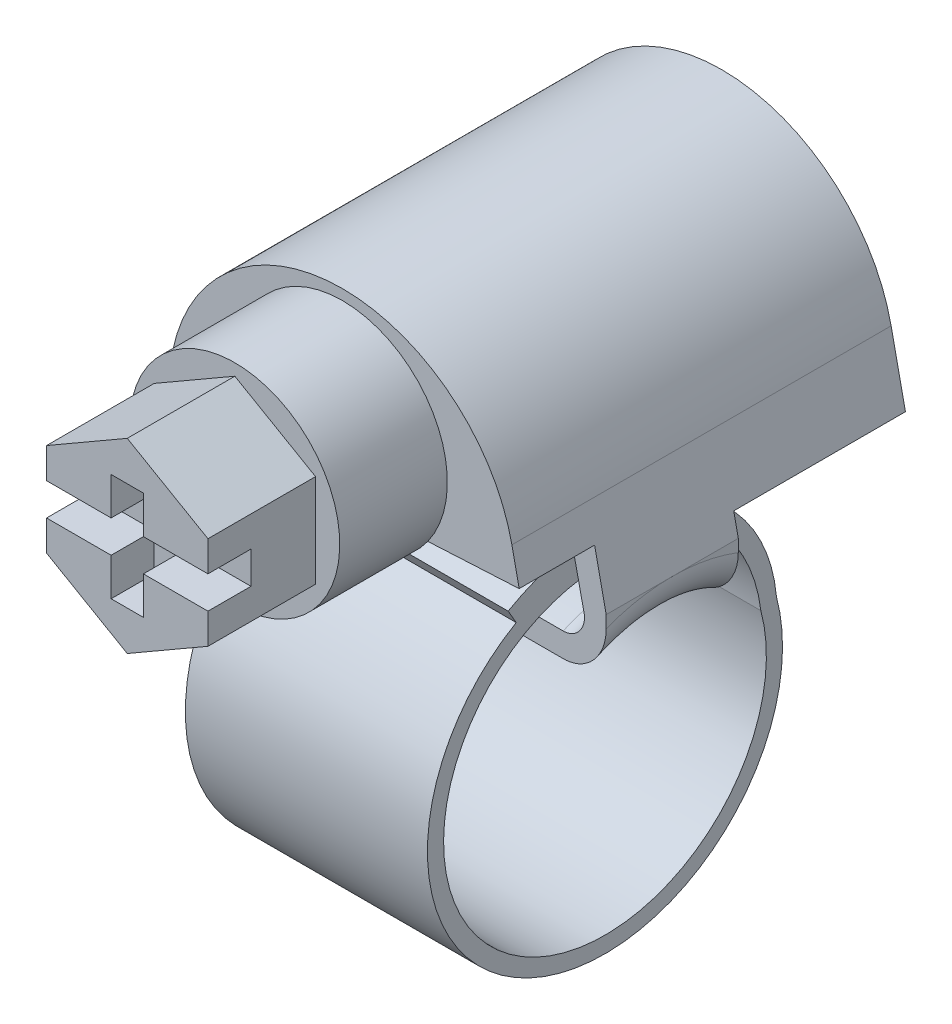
ISO-10303-21;
HEADER;
FILE_DESCRIPTION(('STEP AP214'),'2;1');
FILE_NAME('part.step','',(''),(''),'','','');
FILE_SCHEMA(('AUTOMOTIVE_DESIGN { 1 0 10303 214 1 1 1 1 }'));
ENDSEC;
DATA;
#1=APPLICATION_CONTEXT('core data for automotive mechanical design processes');
#2=APPLICATION_PROTOCOL_DEFINITION('international standard','automotive_design',2000,#1);
#3=PRODUCT_CONTEXT('',#1,'mechanical');
#4=PRODUCT('Part','Part','',(#3));
#5=PRODUCT_RELATED_PRODUCT_CATEGORY('part','',(#4));
#6=PRODUCT_DEFINITION_FORMATION('','',#4);
#7=PRODUCT_DEFINITION_CONTEXT('part definition',#1,'design');
#8=PRODUCT_DEFINITION('design','',#6,#7);
#9=PRODUCT_DEFINITION_SHAPE('','',#8);
#10=(LENGTH_UNIT() NAMED_UNIT(*) SI_UNIT(.MILLI.,.METRE.));
#11=(NAMED_UNIT(*) PLANE_ANGLE_UNIT() SI_UNIT($,.RADIAN.));
#12=(NAMED_UNIT(*) SI_UNIT($,.STERADIAN.) SOLID_ANGLE_UNIT());
#13=UNCERTAINTY_MEASURE_WITH_UNIT(LENGTH_MEASURE(1.E-05),#10,'distance_accuracy_value','');
#14=(GEOMETRIC_REPRESENTATION_CONTEXT(3) GLOBAL_UNCERTAINTY_ASSIGNED_CONTEXT((#13)) GLOBAL_UNIT_ASSIGNED_CONTEXT((#10,
#11,#12)) REPRESENTATION_CONTEXT('',''));
#15=CARTESIAN_POINT('',(0.,0.,0.));
#16=DIRECTION('',(0.,0.,1.));
#17=DIRECTION('',(1.,0.,0.));
#18=AXIS2_PLACEMENT_3D('',#15,#16,#17);
#19=CARTESIAN_POINT('',(-3.,-1.7320508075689,9.26));
#20=DIRECTION('',(-1.,0.,0.));
#21=DIRECTION('',(0.,0.,1.));
#22=AXIS2_PLACEMENT_3D('',#19,#20,#21);
#23=PLANE('',#22);
#24=DIRECTION('',(0.,1.,0.));
#25=VECTOR('',#24,1.);
#26=CARTESIAN_POINT('',(-3.,-1.7320508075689,13.26));
#27=LINE('',#26,#25);
#28=CARTESIAN_POINT('',(-3.,-0.59999999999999,13.26));
#29=VERTEX_POINT('',#28);
#30=CARTESIAN_POINT('',(-3.,-1.7320508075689,13.26));
#31=VERTEX_POINT('',#30);
#32=EDGE_CURVE('E424',#29,#31,#27,.F.);
#33=ORIENTED_EDGE('',*,*,#32,.F.);
#34=DIRECTION('',(0.,0.,-1.));
#35=VECTOR('',#34,1.);
#36=CARTESIAN_POINT('',(-3.,-0.59999999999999,13.26));
#37=LINE('',#36,#35);
#38=CARTESIAN_POINT('',(-3.,-0.599999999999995,11.66));
#39=VERTEX_POINT('',#38);
#40=EDGE_CURVE('E412',#29,#39,#37,.T.);
#41=ORIENTED_EDGE('',*,*,#40,.T.);
#42=DIRECTION('',(0.,1.,0.));
#43=VECTOR('',#42,1.);
#44=CARTESIAN_POINT('',(-3.,-0.599999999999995,11.66));
#45=LINE('',#44,#43);
#46=CARTESIAN_POINT('',(-3.,0.6,11.66));
#47=VERTEX_POINT('',#46);
#48=EDGE_CURVE('E423',#39,#47,#45,.T.);
#49=ORIENTED_EDGE('',*,*,#48,.T.);
#50=DIRECTION('',(0.,0.,1.));
#51=VECTOR('',#50,1.);
#52=CARTESIAN_POINT('',(-3.,0.6,11.66));
#53=LINE('',#52,#51);
#54=CARTESIAN_POINT('',(-3.,0.6,13.26));
#55=VERTEX_POINT('',#54);
#56=EDGE_CURVE('E447',#47,#55,#53,.T.);
#57=ORIENTED_EDGE('',*,*,#56,.T.);
#58=DIRECTION('',(0.,1.,0.));
#59=VECTOR('',#58,1.);
#60=CARTESIAN_POINT('',(-3.,0.6,13.26));
#61=LINE('',#60,#59);
#62=CARTESIAN_POINT('',(-3.,1.7320508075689,13.26));
#63=VERTEX_POINT('',#62);
#64=EDGE_CURVE('E452',#63,#55,#61,.F.);
#65=ORIENTED_EDGE('',*,*,#64,.F.);
#66=DIRECTION('',(0.,0.,-1.));
#67=VECTOR('',#66,1.);
#68=CARTESIAN_POINT('',(-3.,1.7320508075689,13.26));
#69=LINE('',#68,#67);
#70=CARTESIAN_POINT('',(-3.,1.73205080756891,9.26));
#71=VERTEX_POINT('',#70);
#72=EDGE_CURVE('E457',#71,#63,#69,.F.);
#73=ORIENTED_EDGE('',*,*,#72,.F.);
#74=DIRECTION('',(0.,-1.,0.));
#75=VECTOR('',#74,1.);
#76=CARTESIAN_POINT('',(-3.,1.73205080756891,9.26));
#77=LINE('',#76,#75);
#78=CARTESIAN_POINT('',(-3.,-1.7320508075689,9.26));
#79=VERTEX_POINT('',#78);
#80=EDGE_CURVE('E461',#71,#79,#77,.T.);
#81=ORIENTED_EDGE('',*,*,#80,.T.);
#82=DIRECTION('',(0.,0.,1.));
#83=VECTOR('',#82,1.);
#84=CARTESIAN_POINT('',(-3.,-1.7320508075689,9.26));
#85=LINE('',#84,#83);
#86=EDGE_CURVE('E439',#79,#31,#85,.T.);
#87=ORIENTED_EDGE('',*,*,#86,.T.);
#88=EDGE_LOOP('',(#33,#41,#49,#57,#65,#73,#81,#87));
#89=FACE_BOUND('',#88,.T.);
#90=ADVANCED_FACE('F16',(#89),#23,.T.);
#91=CARTESIAN_POINT('',(3.,-1.73205080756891,13.26));
#92=DIRECTION('',(1.,0.,0.));
#93=DIRECTION('',(0.,0.,-1.));
#94=AXIS2_PLACEMENT_3D('',#91,#92,#93);
#95=PLANE('',#94);
#96=DIRECTION('',(0.,-1.,0.));
#97=VECTOR('',#96,1.);
#98=CARTESIAN_POINT('',(3.,0.6,11.66));
#99=LINE('',#98,#97);
#100=CARTESIAN_POINT('',(3.,0.6,11.66));
#101=VERTEX_POINT('',#100);
#102=CARTESIAN_POINT('',(3.,-0.59999999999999,11.66));
#103=VERTEX_POINT('',#102);
#104=EDGE_CURVE('E468',#101,#103,#99,.T.);
#105=ORIENTED_EDGE('',*,*,#104,.T.);
#106=DIRECTION('',(0.,0.,1.));
#107=VECTOR('',#106,1.);
#108=CARTESIAN_POINT('',(3.,-0.59999999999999,11.66));
#109=LINE('',#108,#107);
#110=CARTESIAN_POINT('',(3.,-0.599999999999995,13.26));
#111=VERTEX_POINT('',#110);
#112=EDGE_CURVE('E473',#103,#111,#109,.T.);
#113=ORIENTED_EDGE('',*,*,#112,.T.);
#114=DIRECTION('',(0.,-1.,0.));
#115=VECTOR('',#114,1.);
#116=CARTESIAN_POINT('',(3.,-0.599999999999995,13.26));
#117=LINE('',#116,#115);
#118=CARTESIAN_POINT('',(3.,-1.7320508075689,13.26));
#119=VERTEX_POINT('',#118);
#120=EDGE_CURVE('E478',#119,#111,#117,.F.);
#121=ORIENTED_EDGE('',*,*,#120,.F.);
#122=DIRECTION('',(0.,0.,-1.));
#123=VECTOR('',#122,1.);
#124=CARTESIAN_POINT('',(3.,-1.7320508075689,13.26));
#125=LINE('',#124,#123);
#126=CARTESIAN_POINT('',(3.,-1.73205080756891,9.26));
#127=VERTEX_POINT('',#126);
#128=EDGE_CURVE('E483',#127,#119,#125,.F.);
#129=ORIENTED_EDGE('',*,*,#128,.F.);
#130=DIRECTION('',(0.,1.,0.));
#131=VECTOR('',#130,1.);
#132=CARTESIAN_POINT('',(3.,-1.73205080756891,9.26));
#133=LINE('',#132,#131);
#134=CARTESIAN_POINT('',(3.,1.7320508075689,9.26));
#135=VERTEX_POINT('',#134);
#136=EDGE_CURVE('E487',#127,#135,#133,.T.);
#137=ORIENTED_EDGE('',*,*,#136,.T.);
#138=DIRECTION('',(0.,0.,1.));
#139=VECTOR('',#138,1.);
#140=CARTESIAN_POINT('',(3.,1.7320508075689,9.26));
#141=LINE('',#140,#139);
#142=CARTESIAN_POINT('',(3.,1.7320508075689,13.26));
#143=VERTEX_POINT('',#142);
#144=EDGE_CURVE('E492',#135,#143,#141,.T.);
#145=ORIENTED_EDGE('',*,*,#144,.T.);
#146=DIRECTION('',(0.,-1.,0.));
#147=VECTOR('',#146,1.);
#148=CARTESIAN_POINT('',(3.,1.7320508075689,13.26));
#149=LINE('',#148,#147);
#150=CARTESIAN_POINT('',(3.,0.6,13.26));
#151=VERTEX_POINT('',#150);
#152=EDGE_CURVE('E497',#151,#143,#149,.F.);
#153=ORIENTED_EDGE('',*,*,#152,.F.);
#154=DIRECTION('',(0.,0.,-1.));
#155=VECTOR('',#154,1.);
#156=CARTESIAN_POINT('',(3.,0.6,13.26));
#157=LINE('',#156,#155);
#158=EDGE_CURVE('E435',#151,#101,#157,.T.);
#159=ORIENTED_EDGE('',*,*,#158,.T.);
#160=EDGE_LOOP('',(#105,#113,#121,#129,#137,#145,#153,#159));
#161=FACE_BOUND('',#160,.T.);
#162=ADVANCED_FACE('F1700',(#161),#95,.T.);
#163=CARTESIAN_POINT('',(3.00000000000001,-3.4641016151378,13.26));
#164=DIRECTION('',(0.,0.,1.));
#165=DIRECTION('',(0.,1.,0.));
#166=AXIS2_PLACEMENT_3D('',#163,#164,#165);
#167=PLANE('',#166);
#168=DIRECTION('',(-1.,0.,0.));
#169=VECTOR('',#168,1.);
#170=CARTESIAN_POINT('',(-0.6,-0.600000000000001,13.26));
#171=LINE('',#170,#169);
#172=CARTESIAN_POINT('',(-0.6,-0.600000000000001,13.26));
#173=VERTEX_POINT('',#172);
#174=EDGE_CURVE('E416',#29,#173,#171,.F.);
#175=ORIENTED_EDGE('',*,*,#174,.F.);
#176=ORIENTED_EDGE('',*,*,#32,.T.);
#177=DIRECTION('',(0.866025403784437,-0.500000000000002,0.));
#178=VECTOR('',#177,1.);
#179=CARTESIAN_POINT('',(-3.,-1.7320508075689,13.26));
#180=LINE('',#179,#178);
#181=CARTESIAN_POINT('',(0.,-3.46410161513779,13.26));
#182=VERTEX_POINT('',#181);
#183=EDGE_CURVE('E434',#31,#182,#180,.T.);
#184=ORIENTED_EDGE('',*,*,#183,.T.);
#185=DIRECTION('',(0.866025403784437,0.500000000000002,0.));
#186=VECTOR('',#185,1.);
#187=CARTESIAN_POINT('',(0.,-3.46410161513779,13.26));
#188=LINE('',#187,#186);
#189=EDGE_CURVE('E511',#182,#119,#188,.T.);
#190=ORIENTED_EDGE('',*,*,#189,.T.);
#191=ORIENTED_EDGE('',*,*,#120,.T.);
#192=DIRECTION('',(-1.,0.,0.));
#193=VECTOR('',#192,1.);
#194=CARTESIAN_POINT('',(3.,-0.599999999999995,13.26));
#195=LINE('',#194,#193);
#196=CARTESIAN_POINT('',(0.599999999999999,-0.600000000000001,13.26));
#197=VERTEX_POINT('',#196);
#198=EDGE_CURVE('E516',#197,#111,#195,.F.);
#199=ORIENTED_EDGE('',*,*,#198,.F.);
#200=DIRECTION('',(0.,-1.,0.));
#201=VECTOR('',#200,1.);
#202=CARTESIAN_POINT('',(0.6,-0.600000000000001,13.26));
#203=LINE('',#202,#201);
#204=CARTESIAN_POINT('',(0.6,-2.00041507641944,13.26));
#205=VERTEX_POINT('',#204);
#206=EDGE_CURVE('E520',#197,#205,#203,.T.);
#207=ORIENTED_EDGE('',*,*,#206,.T.);
#208=DIRECTION('',(-1.,0.,0.));
#209=VECTOR('',#208,1.);
#210=CARTESIAN_POINT('',(0.6,-2.00041507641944,13.26));
#211=LINE('',#210,#209);
#212=CARTESIAN_POINT('',(-0.600000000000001,-2.00041507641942,13.26));
#213=VERTEX_POINT('',#212);
#214=EDGE_CURVE('E525',#213,#205,#211,.F.);
#215=ORIENTED_EDGE('',*,*,#214,.F.);
#216=DIRECTION('',(0.,1.,0.));
#217=VECTOR('',#216,1.);
#218=CARTESIAN_POINT('',(-0.600000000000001,-2.00041507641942,13.26));
#219=LINE('',#218,#217);
#220=EDGE_CURVE('E433',#173,#213,#219,.F.);
#221=ORIENTED_EDGE('',*,*,#220,.F.);
#222=EDGE_LOOP('',(#175,#176,#184,#190,#191,#199,#207,#215,#221));
#223=FACE_BOUND('',#222,.T.);
#224=ADVANCED_FACE('F429',(#223),#167,.T.);
#225=CARTESIAN_POINT('',(3.,0.6,13.26));
#226=DIRECTION('',(0.,0.,1.));
#227=DIRECTION('',(0.,1.,0.));
#228=AXIS2_PLACEMENT_3D('',#225,#226,#227);
#229=PLANE('',#228);
#230=ORIENTED_EDGE('',*,*,#64,.T.);
#231=DIRECTION('',(1.,0.,0.));
#232=VECTOR('',#231,1.);
#233=CARTESIAN_POINT('',(-3.,0.6,13.26));
#234=LINE('',#233,#232);
#235=CARTESIAN_POINT('',(-0.6,0.6,13.26));
#236=VERTEX_POINT('',#235);
#237=EDGE_CURVE('E532',#55,#236,#234,.T.);
#238=ORIENTED_EDGE('',*,*,#237,.T.);
#239=DIRECTION('',(0.,1.,0.));
#240=VECTOR('',#239,1.);
#241=CARTESIAN_POINT('',(-0.6,0.6,13.26));
#242=LINE('',#241,#240);
#243=CARTESIAN_POINT('',(-0.6,2.00041507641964,13.26));
#244=VERTEX_POINT('',#243);
#245=EDGE_CURVE('E537',#244,#236,#242,.F.);
#246=ORIENTED_EDGE('',*,*,#245,.F.);
#247=DIRECTION('',(1.,-1.80966353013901E-13,0.));
#248=VECTOR('',#247,1.);
#249=CARTESIAN_POINT('',(-0.6,2.00041507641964,13.26));
#250=LINE('',#249,#248);
#251=CARTESIAN_POINT('',(0.6,2.00041507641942,13.26));
#252=VERTEX_POINT('',#251);
#253=EDGE_CURVE('E542',#252,#244,#250,.F.);
#254=ORIENTED_EDGE('',*,*,#253,.F.);
#255=DIRECTION('',(0.,-1.,0.));
#256=VECTOR('',#255,1.);
#257=CARTESIAN_POINT('',(0.6,2.00041507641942,13.26));
#258=LINE('',#257,#256);
#259=CARTESIAN_POINT('',(0.6,0.6,13.26));
#260=VERTEX_POINT('',#259);
#261=EDGE_CURVE('E546',#252,#260,#258,.T.);
#262=ORIENTED_EDGE('',*,*,#261,.T.);
#263=DIRECTION('',(1.,0.,0.));
#264=VECTOR('',#263,1.);
#265=CARTESIAN_POINT('',(0.6,0.6,13.26));
#266=LINE('',#265,#264);
#267=EDGE_CURVE('E551',#260,#151,#266,.T.);
#268=ORIENTED_EDGE('',*,*,#267,.T.);
#269=ORIENTED_EDGE('',*,*,#152,.T.);
#270=DIRECTION('',(-0.866025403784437,0.500000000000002,0.));
#271=VECTOR('',#270,1.);
#272=CARTESIAN_POINT('',(3.,1.7320508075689,13.26));
#273=LINE('',#272,#271);
#274=CARTESIAN_POINT('',(0.,3.46410161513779,13.26));
#275=VERTEX_POINT('',#274);
#276=EDGE_CURVE('E556',#143,#275,#273,.T.);
#277=ORIENTED_EDGE('',*,*,#276,.T.);
#278=DIRECTION('',(-0.866025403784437,-0.500000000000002,0.));
#279=VECTOR('',#278,1.);
#280=CARTESIAN_POINT('',(0.,3.46410161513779,13.26));
#281=LINE('',#280,#279);
#282=EDGE_CURVE('E561',#275,#63,#281,.T.);
#283=ORIENTED_EDGE('',*,*,#282,.T.);
#284=EDGE_LOOP('',(#230,#238,#246,#254,#262,#268,#269,#277,#283));
#285=FACE_BOUND('',#284,.T.);
#286=ADVANCED_FACE('F1665',(#285),#229,.T.);
#287=CARTESIAN_POINT('',(-0.880083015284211,-0.6,11.66));
#288=DIRECTION('',(0.819152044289,0.,0.573576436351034));
#289=DIRECTION('',(0.573576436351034,0.,-0.819152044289));
#290=AXIS2_PLACEMENT_3D('',#287,#288,#289);
#291=PLANE('',#290);
#292=DIRECTION('',(-0.573576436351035,0.,0.819152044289));
#293=VECTOR('',#292,1.);
#294=CARTESIAN_POINT('',(-0.749292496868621,0.6,11.473211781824));
#295=LINE('',#294,#293);
#296=CARTESIAN_POINT('',(-0.749292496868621,0.6,11.473211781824));
#297=VERTEX_POINT('',#296);
#298=CARTESIAN_POINT('',(-0.880083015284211,0.6,11.66));
#299=VERTEX_POINT('',#298);
#300=EDGE_CURVE('E566',#297,#299,#295,.T.);
#301=ORIENTED_EDGE('',*,*,#300,.T.);
#302=DIRECTION('',(0.,-1.,0.));
#303=VECTOR('',#302,1.);
#304=CARTESIAN_POINT('',(-0.880083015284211,0.6,11.66));
#305=LINE('',#304,#303);
#306=CARTESIAN_POINT('',(-0.880083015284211,-0.599999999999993,11.66));
#307=VERTEX_POINT('',#306);
#308=EDGE_CURVE('E571',#299,#307,#305,.T.);
#309=ORIENTED_EDGE('',*,*,#308,.T.);
#310=DIRECTION('',(0.573576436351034,0.,-0.819152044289));
#311=VECTOR('',#310,1.);
#312=CARTESIAN_POINT('',(-0.880083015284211,-0.599999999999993,11.66));
#313=LINE('',#312,#311);
#314=CARTESIAN_POINT('',(-0.74929249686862,-0.6,11.473211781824));
#315=VERTEX_POINT('',#314);
#316=EDGE_CURVE('E576',#315,#307,#313,.F.);
#317=ORIENTED_EDGE('',*,*,#316,.F.);
#318=DIRECTION('',(0.,1.,0.));
#319=VECTOR('',#318,1.);
#320=CARTESIAN_POINT('',(-0.74929249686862,-0.6,11.473211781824));
#321=LINE('',#320,#319);
#322=EDGE_CURVE('E580',#297,#315,#321,.F.);
#323=ORIENTED_EDGE('',*,*,#322,.F.);
#324=EDGE_LOOP('',(#301,#309,#317,#323));
#325=FACE_BOUND('',#324,.T.);
#326=ADVANCED_FACE('F1675',(#325),#291,.T.);
#327=CARTESIAN_POINT('',(0.749292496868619,-0.6,11.473211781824));
#328=DIRECTION('',(-0.819152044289,0.,0.573576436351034));
#329=DIRECTION('',(0.573576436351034,0.,0.819152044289));
#330=AXIS2_PLACEMENT_3D('',#327,#328,#329);
#331=PLANE('',#330);
#332=DIRECTION('',(0.573576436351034,0.,0.819152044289));
#333=VECTOR('',#332,1.);
#334=CARTESIAN_POINT('',(0.749292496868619,-0.6,11.473211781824));
#335=LINE('',#334,#333);
#336=CARTESIAN_POINT('',(0.88008301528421,-0.599999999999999,11.66));
#337=VERTEX_POINT('',#336);
#338=CARTESIAN_POINT('',(0.749292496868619,-0.6,11.473211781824));
#339=VERTEX_POINT('',#338);
#340=EDGE_CURVE('E584',#337,#339,#335,.F.);
#341=ORIENTED_EDGE('',*,*,#340,.F.);
#342=DIRECTION('',(0.,1.,0.));
#343=VECTOR('',#342,1.);
#344=CARTESIAN_POINT('',(0.88008301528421,-0.599999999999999,11.66));
#345=LINE('',#344,#343);
#346=CARTESIAN_POINT('',(0.88008301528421,0.600000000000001,11.66));
#347=VERTEX_POINT('',#346);
#348=EDGE_CURVE('E589',#337,#347,#345,.T.);
#349=ORIENTED_EDGE('',*,*,#348,.T.);
#350=DIRECTION('',(-0.573576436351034,0.,-0.819152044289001));
#351=VECTOR('',#350,1.);
#352=CARTESIAN_POINT('',(0.88008301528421,0.6,11.66));
#353=LINE('',#352,#351);
#354=CARTESIAN_POINT('',(0.749292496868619,0.6,11.473211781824));
#355=VERTEX_POINT('',#354);
#356=EDGE_CURVE('E594',#347,#355,#353,.T.);
#357=ORIENTED_EDGE('',*,*,#356,.T.);
#358=DIRECTION('',(0.,-1.,0.));
#359=VECTOR('',#358,1.);
#360=CARTESIAN_POINT('',(0.749292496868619,0.6,11.473211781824));
#361=LINE('',#360,#359);
#362=EDGE_CURVE('E599',#355,#339,#361,.T.);
#363=ORIENTED_EDGE('',*,*,#362,.T.);
#364=EDGE_LOOP('',(#341,#349,#357,#363));
#365=FACE_BOUND('',#364,.T.);
#366=ADVANCED_FACE('F1714',(#365),#331,.T.);
#367=CARTESIAN_POINT('',(0.6,-2.00041507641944,13.26));
#368=DIRECTION('',(-1.,0.,0.));
#369=DIRECTION('',(0.,1.,0.));
#370=AXIS2_PLACEMENT_3D('',#367,#368,#369);
#371=PLANE('',#370);
#372=DIRECTION('',(0.,0.,-1.));
#373=VECTOR('',#372,1.);
#374=CARTESIAN_POINT('',(0.6,-0.6,13.26));
#375=LINE('',#374,#373);
#376=CARTESIAN_POINT('',(0.6,-0.6,11.333089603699));
#377=VERTEX_POINT('',#376);
#378=EDGE_CURVE('E604',#377,#197,#375,.F.);
#379=ORIENTED_EDGE('',*,*,#378,.F.);
#380=CARTESIAN_POINT('',(0.6,-0.339716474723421,11.760000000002));
#381=DIRECTION('',(-1.,0.,0.));
#382=DIRECTION('',(0.,-0.520567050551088,-0.853820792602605));
#383=AXIS2_PLACEMENT_3D('',#380,#381,#382);
#384=CIRCLE('',#383,0.500000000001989);
#385=CARTESIAN_POINT('',(0.6,-0.749292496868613,11.473211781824));
#386=VERTEX_POINT('',#385);
#387=EDGE_CURVE('E608',#386,#377,#384,.F.);
#388=ORIENTED_EDGE('',*,*,#387,.F.);
#389=DIRECTION('',(0.,-0.573576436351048,0.819152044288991));
#390=VECTOR('',#389,1.);
#391=CARTESIAN_POINT('',(0.6,-0.749292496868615,11.473211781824));
#392=LINE('',#391,#390);
#393=CARTESIAN_POINT('',(0.6,-0.880083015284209,11.66));
#394=VERTEX_POINT('',#393);
#395=EDGE_CURVE('E613',#394,#386,#392,.F.);
#396=ORIENTED_EDGE('',*,*,#395,.F.);
#397=DIRECTION('',(0.,-1.,0.));
#398=VECTOR('',#397,1.);
#399=CARTESIAN_POINT('',(0.6,-0.88008301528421,11.66));
#400=LINE('',#399,#398);
#401=CARTESIAN_POINT('',(0.6,-2.0004150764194,11.66));
#402=VERTEX_POINT('',#401);
#403=EDGE_CURVE('E617',#402,#394,#400,.F.);
#404=ORIENTED_EDGE('',*,*,#403,.F.);
#405=DIRECTION('',(0.,0.,1.));
#406=VECTOR('',#405,1.);
#407=CARTESIAN_POINT('',(0.6,-2.0004150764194,11.66));
#408=LINE('',#407,#406);
#409=EDGE_CURVE('E621',#205,#402,#408,.F.);
#410=ORIENTED_EDGE('',*,*,#409,.F.);
#411=ORIENTED_EDGE('',*,*,#206,.F.);
#412=EDGE_LOOP('',(#379,#388,#396,#404,#410,#411));
#413=FACE_BOUND('',#412,.T.);
#414=ADVANCED_FACE('F1717',(#413),#371,.T.);
#415=CARTESIAN_POINT('',(-0.6,-2.00041507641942,13.26));
#416=DIRECTION('',(1.,0.,0.));
#417=DIRECTION('',(0.,0.,-1.));
#418=AXIS2_PLACEMENT_3D('',#415,#416,#417);
#419=PLANE('',#418);
#420=CARTESIAN_POINT('',(-0.6,-0.339716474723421,11.760000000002));
#421=DIRECTION('',(1.,0.,0.));
#422=DIRECTION('',(0.,-0.819152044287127,-0.573576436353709));
#423=AXIS2_PLACEMENT_3D('',#420,#421,#422);
#424=CIRCLE('',#423,0.500000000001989);
#425=CARTESIAN_POINT('',(-0.6,-0.749292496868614,11.473211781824));
#426=VERTEX_POINT('',#425);
#427=CARTESIAN_POINT('',(-0.6,-0.599999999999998,11.333089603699));
#428=VERTEX_POINT('',#427);
#429=EDGE_CURVE('E625',#426,#428,#424,.T.);
#430=ORIENTED_EDGE('',*,*,#429,.T.);
#431=DIRECTION('',(0.,0.,1.));
#432=VECTOR('',#431,1.);
#433=CARTESIAN_POINT('',(-0.6,-0.599999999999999,11.333089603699));
#434=LINE('',#433,#432);
#435=EDGE_CURVE('E630',#428,#173,#434,.T.);
#436=ORIENTED_EDGE('',*,*,#435,.T.);
#437=ORIENTED_EDGE('',*,*,#220,.T.);
#438=DIRECTION('',(0.,0.,-1.));
#439=VECTOR('',#438,1.);
#440=CARTESIAN_POINT('',(-0.6,-2.00041507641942,13.26));
#441=LINE('',#440,#439);
#442=CARTESIAN_POINT('',(-0.6,-2.0004150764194,11.66));
#443=VERTEX_POINT('',#442);
#444=EDGE_CURVE('E634',#213,#443,#441,.T.);
#445=ORIENTED_EDGE('',*,*,#444,.T.);
#446=DIRECTION('',(0.,1.,0.));
#447=VECTOR('',#446,1.);
#448=CARTESIAN_POINT('',(-0.6,-2.0004150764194,11.66));
#449=LINE('',#448,#447);
#450=CARTESIAN_POINT('',(-0.6,-0.88008301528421,11.66));
#451=VERTEX_POINT('',#450);
#452=EDGE_CURVE('E639',#443,#451,#449,.T.);
#453=ORIENTED_EDGE('',*,*,#452,.T.);
#454=DIRECTION('',(0.,0.573576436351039,-0.819152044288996));
#455=VECTOR('',#454,1.);
#456=CARTESIAN_POINT('',(-0.6,-0.880083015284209,11.66));
#457=LINE('',#456,#455);
#458=EDGE_CURVE('E644',#451,#426,#457,.T.);
#459=ORIENTED_EDGE('',*,*,#458,.T.);
#460=EDGE_LOOP('',(#430,#436,#437,#445,#453,#459));
#461=FACE_BOUND('',#460,.T.);
#462=ADVANCED_FACE('F1681',(#461),#419,.T.);
#463=CARTESIAN_POINT('',(0.6,-0.339716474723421,11.760000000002));
#464=DIRECTION('',(-1.,0.,0.));
#465=DIRECTION('',(0.,-0.520567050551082,-0.853820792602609));
#466=AXIS2_PLACEMENT_3D('',#463,#464,#465);
#467=CYLINDRICAL_SURFACE('',#466,0.500000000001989);
#468=ORIENTED_EDGE('',*,*,#387,.T.);
#469=DIRECTION('',(-1.,0.,0.));
#470=VECTOR('',#469,1.);
#471=CARTESIAN_POINT('',(0.6,-0.600000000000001,11.333089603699));
#472=LINE('',#471,#470);
#473=EDGE_CURVE('E649',#377,#428,#472,.T.);
#474=ORIENTED_EDGE('',*,*,#473,.T.);
#475=ORIENTED_EDGE('',*,*,#429,.F.);
#476=DIRECTION('',(1.,0.,0.));
#477=VECTOR('',#476,1.);
#478=CARTESIAN_POINT('',(-0.6,-0.749292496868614,11.473211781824));
#479=LINE('',#478,#477);
#480=EDGE_CURVE('E654',#386,#426,#479,.F.);
#481=ORIENTED_EDGE('',*,*,#480,.F.);
#482=EDGE_LOOP('',(#468,#474,#475,#481));
#483=FACE_BOUND('',#482,.T.);
#484=ADVANCED_FACE('F1686',(#483),#467,.F.);
#485=CARTESIAN_POINT('',(-0.6,-0.749292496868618,11.473211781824));
#486=DIRECTION('',(0.,0.819152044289,0.573576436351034));
#487=DIRECTION('',(0.,-0.573576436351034,0.819152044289));
#488=AXIS2_PLACEMENT_3D('',#485,#486,#487);
#489=PLANE('',#488);
#490=ORIENTED_EDGE('',*,*,#458,.F.);
#491=DIRECTION('',(1.,0.,0.));
#492=VECTOR('',#491,1.);
#493=CARTESIAN_POINT('',(-0.6,-0.880083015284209,11.66));
#494=LINE('',#493,#492);
#495=EDGE_CURVE('E658',#451,#394,#494,.T.);
#496=ORIENTED_EDGE('',*,*,#495,.T.);
#497=ORIENTED_EDGE('',*,*,#395,.T.);
#498=ORIENTED_EDGE('',*,*,#480,.T.);
#499=EDGE_LOOP('',(#490,#496,#497,#498));
#500=FACE_BOUND('',#499,.T.);
#501=ADVANCED_FACE('F1726',(#500),#489,.T.);
#502=CARTESIAN_POINT('',(-0.6,0.880083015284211,11.66));
#503=DIRECTION('',(0.,-0.819152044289,0.573576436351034));
#504=DIRECTION('',(0.,-0.573576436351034,-0.819152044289));
#505=AXIS2_PLACEMENT_3D('',#502,#503,#504);
#506=PLANE('',#505);
#507=DIRECTION('',(0.,0.573576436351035,0.819152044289));
#508=VECTOR('',#507,1.);
#509=CARTESIAN_POINT('',(0.6,0.74929249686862,11.473211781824));
#510=LINE('',#509,#508);
#511=CARTESIAN_POINT('',(0.6,0.74929249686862,11.473211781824));
#512=VERTEX_POINT('',#511);
#513=CARTESIAN_POINT('',(0.6,0.880083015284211,11.66));
#514=VERTEX_POINT('',#513);
#515=EDGE_CURVE('E663',#512,#514,#510,.T.);
#516=ORIENTED_EDGE('',*,*,#515,.T.);
#517=DIRECTION('',(-1.,0.,0.));
#518=VECTOR('',#517,1.);
#519=CARTESIAN_POINT('',(0.6,0.880083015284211,11.66));
#520=LINE('',#519,#518);
#521=CARTESIAN_POINT('',(-0.6,0.880083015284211,11.66));
#522=VERTEX_POINT('',#521);
#523=EDGE_CURVE('E668',#514,#522,#520,.T.);
#524=ORIENTED_EDGE('',*,*,#523,.T.);
#525=DIRECTION('',(0.,-0.573576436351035,-0.819152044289));
#526=VECTOR('',#525,1.);
#527=CARTESIAN_POINT('',(-0.6,0.880083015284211,11.66));
#528=LINE('',#527,#526);
#529=CARTESIAN_POINT('',(-0.6,0.74929249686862,11.473211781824));
#530=VERTEX_POINT('',#529);
#531=EDGE_CURVE('E673',#530,#522,#528,.F.);
#532=ORIENTED_EDGE('',*,*,#531,.F.);
#533=DIRECTION('',(1.,0.,0.));
#534=VECTOR('',#533,1.);
#535=CARTESIAN_POINT('',(-0.6,0.74929249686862,11.473211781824));
#536=LINE('',#535,#534);
#537=EDGE_CURVE('E678',#512,#530,#536,.F.);
#538=ORIENTED_EDGE('',*,*,#537,.F.);
#539=EDGE_LOOP('',(#516,#524,#532,#538));
#540=FACE_BOUND('',#539,.T.);
#541=ADVANCED_FACE('F1653',(#540),#506,.T.);
#542=CARTESIAN_POINT('',(7.,-10.914285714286,0.));
#543=DIRECTION('',(1.,0.,0.));
#544=DIRECTION('',(0.,0.912418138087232,-0.409259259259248));
#545=AXIS2_PLACEMENT_3D('',#542,#543,#544);
#546=CYLINDRICAL_SURFACE('',#545,6.0000000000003);
#547=DIRECTION('',(1.,-2.54611146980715E-13,5.67447323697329E-13));
#548=VECTOR('',#547,1.);
#549=CARTESIAN_POINT('',(-5.39999999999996,-5.4397768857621,2.4555555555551));
#550=LINE('',#549,#548);
#551=CARTESIAN_POINT('',(-5.39999999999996,-5.4397768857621,2.4555555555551));
#552=VERTEX_POINT('',#551);
#553=CARTESIAN_POINT('',(-4.5,-5.43977688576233,2.45555555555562));
#554=VERTEX_POINT('',#553);
#555=EDGE_CURVE('E682',#552,#554,#550,.T.);
#556=ORIENTED_EDGE('',*,*,#555,.T.);
#557=CARTESIAN_POINT('',(-4.5,-10.914285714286,0.));
#558=DIRECTION('',(-1.,0.,0.));
#559=DIRECTION('',(0.,0.912418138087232,0.409259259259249));
#560=AXIS2_PLACEMENT_3D('',#557,#558,#559);
#561=CIRCLE('',#560,6.0000000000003);
#562=CARTESIAN_POINT('',(-4.5,-5.43977688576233,-2.45555555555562));
#563=VERTEX_POINT('',#562);
#564=EDGE_CURVE('E687',#563,#554,#561,.F.);
#565=ORIENTED_EDGE('',*,*,#564,.F.);
#566=DIRECTION('',(-1.,2.53624057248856E-13,5.66953388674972E-13));
#567=VECTOR('',#566,1.);
#568=CARTESIAN_POINT('',(-4.5,-5.43977688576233,-2.45555555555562));
#569=LINE('',#568,#567);
#570=CARTESIAN_POINT('',(-5.40000079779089,-5.43977688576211,-2.45555555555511));
#571=VERTEX_POINT('',#570);
#572=EDGE_CURVE('E691',#571,#563,#569,.F.);
#573=ORIENTED_EDGE('',*,*,#572,.F.);
#574=CARTESIAN_POINT('',(-5.40000079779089,-10.914285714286,0.));
#575=DIRECTION('',(1.,0.,0.));
#576=DIRECTION('',(0.,0.91241813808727,-0.409259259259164));
#577=AXIS2_PLACEMENT_3D('',#574,#575,#576);
#578=CIRCLE('',#577,6.0000000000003);
#579=EDGE_CURVE('E696',#571,#552,#578,.T.);
#580=ORIENTED_EDGE('',*,*,#579,.T.);
#581=EDGE_LOOP('',(#556,#565,#573,#580));
#582=FACE_BOUND('',#581,.T.);
#583=ADVANCED_FACE('F725',(#582),#546,.T.);
#584=CARTESIAN_POINT('',(5.66578019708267,-10.914285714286,0.));
#585=DIRECTION('',(-1.,0.,0.));
#586=DIRECTION('',(0.,0.932522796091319,0.36111111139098));
#587=AXIS2_PLACEMENT_3D('',#584,#585,#586);
#588=CONICAL_SURFACE('',#587,9.11396018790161,1.34390352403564);
#589=CARTESIAN_POINT('',(6.20000000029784,-4.57313070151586,2.45555555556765));
#590=CARTESIAN_POINT('',(6.17840821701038,-4.4728417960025,2.45555770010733));
#591=CARTESIAN_POINT('',(6.15675314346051,-4.37256653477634,2.4555632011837));
#592=CARTESIAN_POINT('',(6.11309235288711,-4.1709433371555,2.45557393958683));
#593=CARTESIAN_POINT('',(6.09108539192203,-4.06959567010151,2.45557917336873));
#594=CARTESIAN_POINT('',(6.04681017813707,-3.86618869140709,2.45558205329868));
#595=CARTESIAN_POINT('',(6.02454118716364,-3.7641295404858,2.45557964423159));
#596=CARTESIAN_POINT('',(5.97983053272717,-3.55966271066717,2.45556997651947));
#597=CARTESIAN_POINT('',(5.95738853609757,-3.45725510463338,2.45556270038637));
#598=CARTESIAN_POINT('',(5.91242081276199,-3.25245543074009,2.4555484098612));
#599=CARTESIAN_POINT('',(5.8898950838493,-3.15006336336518,2.45554139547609));
#600=CARTESIAN_POINT('',(5.84484884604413,-2.94565915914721,2.45553246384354));
#601=CARTESIAN_POINT('',(5.82232860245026,-2.84364696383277,2.45553052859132));
#602=CARTESIAN_POINT('',(5.77738238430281,-2.64036670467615,2.45553368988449));
#603=CARTESIAN_POINT('',(5.75495688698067,-2.53909853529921,2.45553873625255));
#604=CARTESIAN_POINT('',(5.71028919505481,-2.33767000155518,2.45554881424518));
#605=CARTESIAN_POINT('',(5.68804763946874,-2.2375094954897,2.45555384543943));
#606=CARTESIAN_POINT('',(5.66578019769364,-2.1373547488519,2.45555555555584));
#607=B_SPLINE_CURVE_WITH_KNOTS('',3,(#589,#590,#591,#592,#593,#594,#595,#596,#597,#598,#599,
#600,#601,#602,#603,#604,#605,#606),.UNSPECIFIED.,.F.,.F.,(4,2,2,2,2,2,2,2,4),(0.,
0.307760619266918,0.618888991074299,0.932270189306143,1.24678350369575,1.56130516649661,
1.87471038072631,2.18587479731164,2.49367556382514),.UNSPECIFIED.);
#608=CARTESIAN_POINT('',(6.2000000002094,-4.57313070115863,2.45555555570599));
#609=VERTEX_POINT('',#608);
#610=CARTESIAN_POINT('',(5.66578019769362,-2.1373547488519,2.4555555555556));
#611=VERTEX_POINT('',#610);
#612=EDGE_CURVE('E701',#609,#611,#607,.T.);
#613=ORIENTED_EDGE('',*,*,#612,.T.);
#614=CARTESIAN_POINT('',(5.66578019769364,-2.1373547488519,2.45555555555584));
#615=CARTESIAN_POINT('',(5.66844893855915,-2.13721495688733,2.41215181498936));
#616=CARTESIAN_POINT('',(5.6710542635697,-2.13708801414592,2.36874412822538));
#617=CARTESIAN_POINT('',(5.67611730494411,-2.13685575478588,2.28223194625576));
#618=CARTESIAN_POINT('',(5.67857594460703,-2.13675028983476,2.23912750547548));
#619=CARTESIAN_POINT('',(5.68334685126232,-2.13655571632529,2.15320437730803));
#620=CARTESIAN_POINT('',(5.68565999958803,-2.13646650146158,2.11038573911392));
#621=CARTESIAN_POINT('',(5.69014119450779,-2.1362999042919,2.02501681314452));
#622=CARTESIAN_POINT('',(5.69231007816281,-2.13622244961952,1.98246656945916));
#623=CARTESIAN_POINT('',(5.69650400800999,-2.13607545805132,1.89761707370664));
#624=CARTESIAN_POINT('',(5.69852984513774,-2.13600587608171,1.85531786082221));
#625=CARTESIAN_POINT('',(5.70243895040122,-2.13587135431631,1.77095313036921));
#626=CARTESIAN_POINT('',(5.70432296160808,-2.13580639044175,1.72888764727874));
#627=CARTESIAN_POINT('',(5.70794968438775,-2.13567845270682,1.64497315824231));
#628=CARTESIAN_POINT('',(5.7096930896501,-2.13561547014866,1.60312418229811));
#629=CARTESIAN_POINT('',(5.71303987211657,-2.13548946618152,1.51962558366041));
#630=CARTESIAN_POINT('',(5.71464389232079,-2.13542644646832,1.47797598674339));
#631=CARTESIAN_POINT('',(5.71771317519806,-2.13529894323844,1.39485913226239));
#632=CARTESIAN_POINT('',(5.71917902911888,-2.13523446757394,1.35339189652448));
#633=CARTESIAN_POINT('',(5.7219732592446,-2.13510327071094,1.27062287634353));
#634=CARTESIAN_POINT('',(5.7233021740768,-2.13503655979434,1.22932111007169));
#635=CARTESIAN_POINT('',(5.72582377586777,-2.13490057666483,1.146866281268));
#636=CARTESIAN_POINT('',(5.72701694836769,-2.13483131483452,1.10571323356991));
#637=CARTESIAN_POINT('',(5.72926842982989,-2.13469100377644,1.02353925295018));
#638=CARTESIAN_POINT('',(5.73032717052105,-2.13461996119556,0.982518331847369));
#639=CARTESIAN_POINT('',(5.73231171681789,-2.13447552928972,0.900551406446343));
#640=CARTESIAN_POINT('',(5.73323777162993,-2.13440214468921,0.859605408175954));
#641=CARTESIAN_POINT('',(5.73495908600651,-2.13425105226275,0.777675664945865));
#642=CARTESIAN_POINT('',(5.73575423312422,-2.13417334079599,0.73669191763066));
#643=CARTESIAN_POINT('',(5.73721466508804,-2.1340217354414,0.654693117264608));
#644=CARTESIAN_POINT('',(5.73787985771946,-2.13394784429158,0.613678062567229));
#645=CARTESIAN_POINT('',(5.73908056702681,-2.13380850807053,0.531629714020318));
#646=CARTESIAN_POINT('',(5.73961603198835,-2.13374306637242,0.490596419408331));
#647=CARTESIAN_POINT('',(5.74055762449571,-2.13362486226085,0.408524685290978));
#648=CARTESIAN_POINT('',(5.74096374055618,-2.13357210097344,0.367486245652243));
#649=CARTESIAN_POINT('',(5.74164693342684,-2.13348225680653,0.285417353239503));
#650=CARTESIAN_POINT('',(5.74192403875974,-2.13344517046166,0.244386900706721));
#651=CARTESIAN_POINT('',(5.74234951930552,-2.13338866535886,0.162347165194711));
#652=CARTESIAN_POINT('',(5.74249796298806,-2.13336923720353,0.121337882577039));
#653=CARTESIAN_POINT('',(5.74266642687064,-2.13334896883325,0.0393537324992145));
#654=CARTESIAN_POINT('',(5.74268655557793,-2.13334811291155,-0.00162113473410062));
#655=CARTESIAN_POINT('',(5.74259869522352,-2.13336484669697,-0.0835231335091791));
#656=CARTESIAN_POINT('',(5.74249085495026,-2.13338241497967,-0.124450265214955));
#657=CARTESIAN_POINT('',(5.74214736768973,-2.13343481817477,-0.206243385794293));
#658=CARTESIAN_POINT('',(5.74191191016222,-2.13346962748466,-0.247109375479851));
#659=CARTESIAN_POINT('',(5.74131347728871,-2.13355417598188,-0.328766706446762));
#660=CARTESIAN_POINT('',(5.74095073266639,-2.13360388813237,-0.369558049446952));
#661=CARTESIAN_POINT('',(5.7400980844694,-2.13371519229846,-0.451053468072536));
#662=CARTESIAN_POINT('',(5.73960845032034,-2.13377675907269,-0.491757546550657));
#663=CARTESIAN_POINT('',(5.73850066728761,-2.13390646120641,-0.573167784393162));
#664=CARTESIAN_POINT('',(5.73788250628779,-2.13397459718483,-0.613873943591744));
#665=CARTESIAN_POINT('',(5.73651593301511,-2.13411410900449,-0.695364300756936));
#666=CARTESIAN_POINT('',(5.73576726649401,-2.13418549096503,-0.736148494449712));
#667=CARTESIAN_POINT('',(5.73413855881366,-2.13432939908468,-0.817810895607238));
#668=CARTESIAN_POINT('',(5.73325821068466,-2.13440192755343,-0.858689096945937));
#669=CARTESIAN_POINT('',(5.73136491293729,-2.13454614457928,-0.940555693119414));
#670=CARTESIAN_POINT('',(5.73035160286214,-2.13461783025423,-0.981544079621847));
#671=CARTESIAN_POINT('',(5.72819139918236,-2.13476002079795,-1.06364742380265));
#672=CARTESIAN_POINT('',(5.72704409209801,-2.1348305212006,-1.104762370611));
#673=CARTESIAN_POINT('',(5.72461403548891,-2.13496673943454,-1.18713536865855));
#674=CARTESIAN_POINT('',(5.72333081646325,-2.13503243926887,-1.22839340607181));
#675=CARTESIAN_POINT('',(5.72064009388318,-2.1351699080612,-1.31077125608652));
#676=CARTESIAN_POINT('',(5.71923300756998,-2.13524165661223,-1.35189108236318));
#677=CARTESIAN_POINT('',(5.7163123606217,-2.13539909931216,-1.43360754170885));
#678=CARTESIAN_POINT('',(5.71480036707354,-2.13548460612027,-1.47420423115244));
#679=CARTESIAN_POINT('',(5.71166966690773,-2.13565420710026,-1.55493602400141));
#680=CARTESIAN_POINT('',(5.71005235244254,-2.13573830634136,-1.59507118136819));
#681=CARTESIAN_POINT('',(5.70671228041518,-2.13590044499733,-1.67494492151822));
#682=CARTESIAN_POINT('',(5.70499070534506,-2.13597853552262,-1.71468355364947));
#683=CARTESIAN_POINT('',(5.70144296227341,-2.13612569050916,-1.79382899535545));
#684=CARTESIAN_POINT('',(5.69961776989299,-2.13619482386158,-1.83323584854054));
#685=CARTESIAN_POINT('',(5.69586375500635,-2.13632501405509,-1.91178222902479));
#686=CARTESIAN_POINT('',(5.69393570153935,-2.13638612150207,-1.95092179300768));
#687=CARTESIAN_POINT('',(5.68997689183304,-2.13650439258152,-2.02899782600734));
#688=CARTESIAN_POINT('',(5.68794670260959,-2.13656157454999,-2.06793432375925));
#689=CARTESIAN_POINT('',(5.68378456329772,-2.13667946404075,-2.145668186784));
#690=CARTESIAN_POINT('',(5.68165298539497,-2.1367401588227,-2.18446557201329));
#691=CARTESIAN_POINT('',(5.67728895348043,-2.1368754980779,-2.26198489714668));
#692=CARTESIAN_POINT('',(5.67505668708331,-2.13695011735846,-2.30070684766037));
#693=CARTESIAN_POINT('',(5.67049232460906,-2.13712764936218,-2.37813872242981));
#694=CARTESIAN_POINT('',(5.66816024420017,-2.13723055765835,-2.41684864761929));
#695=CARTESIAN_POINT('',(5.66578019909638,-2.1373547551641,-2.4555555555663));
#696=B_SPLINE_CURVE_WITH_KNOTS('',3,(#614,#615,#616,#617,#618,#619,#620,#621,#622,#623,#624,
#625,#626,#627,#628,#629,#630,#631,#632,#633,#634,#635,#636,#637,#638,#639,#640,#641,#642,#643,
#644,#645,#646,#647,#648,#649,#650,#651,#652,#653,#654,#655,#656,#657,#658,#659,#660,#661,#662,
#663,#664,#665,#666,#667,#668,#669,#670,#671,#672,#673,#674,#675,#676,#677,#678,#679,#680,#681,
#682,#683,#684,#685,#686,#687,#688,#689,#690,#691,#692,#693,#694,#695),.UNSPECIFIED.,.F.,.F.,(4,
2,2,2,2,2,2,2,2,2,2,2,2,2,2,2,2,2,2,2,2,2,2,2,2,2,2,2,2,2,2,2,2,2,2,2,2,2,2,2,4),(0.,
0.130457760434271,0.259981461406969,0.388624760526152,0.516441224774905,0.643484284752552,
0.769807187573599,0.895462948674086,1.02050430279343,1.14498365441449,1.26895302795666,
1.39246401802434,1.51556774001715,1.63843713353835,1.7614115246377,1.8844728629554,
2.00758317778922,2.13070442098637,2.2537984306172,2.37682689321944,2.4997513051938,
2.622532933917,2.74513277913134,2.86751153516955,2.98963254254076,3.1117650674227,
3.23413824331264,3.35680126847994,3.47980397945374,3.60319680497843,3.72703071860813,
3.85046239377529,3.9723369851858,4.09284025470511,4.21216802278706,4.33051532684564,
4.4480763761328,4.56504451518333,4.68161220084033,4.79797099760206,4.91431159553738),.UNSPECIFIED.);
#697=CARTESIAN_POINT('',(5.66578019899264,-2.13735475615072,-2.45555555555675));
#698=VERTEX_POINT('',#697);
#699=EDGE_CURVE('E1164',#611,#698,#696,.T.);
#700=ORIENTED_EDGE('',*,*,#699,.T.);
#701=CARTESIAN_POINT('',(5.92599437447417,-3.31428571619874,-2.4555555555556));
#702=CARTESIAN_POINT('',(5.84015688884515,-2.92355751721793,-2.4555555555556));
#703=CARTESIAN_POINT('',(5.75260978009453,-2.52789702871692,-2.4555555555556));
#704=CARTESIAN_POINT('',(5.66578019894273,-2.13735475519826,-2.4555555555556));
#705=B_SPLINE_CURVE_WITH_KNOTS('',3,(#701,#702,#703,#704),.UNSPECIFIED.,.F.,.F.,(4,4),(0.,1.),.UNSPECIFIED.);
#706=CARTESIAN_POINT('',(5.92599437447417,-3.31428571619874,-2.4555555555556));
#707=VERTEX_POINT('',#706);
#708=EDGE_CURVE('E752',#707,#698,#705,.T.);
#709=ORIENTED_EDGE('',*,*,#708,.F.);
#710=CARTESIAN_POINT('',(6.20000000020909,-4.57313070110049,-2.4555555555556));
#711=CARTESIAN_POINT('',(6.11019243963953,-4.15598349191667,-2.4555555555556));
#712=CARTESIAN_POINT('',(6.01756006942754,-3.73108845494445,-2.4555555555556));
#713=CARTESIAN_POINT('',(5.92599437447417,-3.31428571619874,-2.4555555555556));
#714=B_SPLINE_CURVE_WITH_KNOTS('',3,(#710,#711,#712,#713),.UNSPECIFIED.,.F.,.F.,(4,4),(0.,1.),.UNSPECIFIED.);
#715=CARTESIAN_POINT('',(6.2000000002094,-4.57313070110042,-2.45555555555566));
#716=VERTEX_POINT('',#715);
#717=EDGE_CURVE('E749',#716,#707,#714,.T.);
#718=ORIENTED_EDGE('',*,*,#717,.F.);
#719=CARTESIAN_POINT('',(6.2000000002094,-10.914285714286,0.));
#720=DIRECTION('',(1.,0.,0.));
#721=DIRECTION('',(0.,0.932522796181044,-0.361111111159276));
#722=AXIS2_PLACEMENT_3D('',#719,#720,#721);
#723=CIRCLE('',#722,6.7999999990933);
#724=EDGE_CURVE('E751',#716,#609,#723,.T.);
#725=ORIENTED_EDGE('',*,*,#724,.T.);
#726=EDGE_LOOP('',(#613,#700,#709,#718,#725));
#727=FACE_BOUND('',#726,.T.);
#728=ADVANCED_FACE('F714',(#727),#588,.F.);
#729=CARTESIAN_POINT('',(-5.70770284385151,-10.914285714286,0.));
#730=DIRECTION('',(1.,0.,0.));
#731=DIRECTION('',(0.,0.932522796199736,-0.361111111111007));
#732=AXIS2_PLACEMENT_3D('',#729,#730,#731);
#733=CONICAL_SURFACE('',#732,9.11607602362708,1.36135681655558);
#734=CARTESIAN_POINT('',(-5.70770284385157,-2.13515768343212,-2.4555555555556));
#735=CARTESIAN_POINT('',(-5.78781864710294,-2.52653913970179,-2.4555555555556));
#736=CARTESIAN_POINT('',(-5.86857149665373,-2.92293037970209,-2.4555555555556));
#737=CARTESIAN_POINT('',(-5.94772815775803,-3.31428892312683,-2.4555555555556));
#738=B_SPLINE_CURVE_WITH_KNOTS('',3,(#734,#735,#736,#737),.UNSPECIFIED.,.F.,.F.,(4,4),(0.,1.),.UNSPECIFIED.);
#739=CARTESIAN_POINT('',(-5.70770284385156,-2.13515768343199,-2.45555555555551));
#740=VERTEX_POINT('',#739);
#741=CARTESIAN_POINT('',(-5.94772815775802,-3.31428892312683,-2.4555555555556));
#742=VERTEX_POINT('',#741);
#743=EDGE_CURVE('E767',#740,#742,#738,.T.);
#744=ORIENTED_EDGE('',*,*,#743,.F.);
#745=CARTESIAN_POINT('',(-5.70770284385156,-2.13515768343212,-2.45555555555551));
#746=CARTESIAN_POINT('',(-5.71016224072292,-2.13502886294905,-2.41214024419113));
#747=CARTESIAN_POINT('',(-5.71256315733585,-2.13491265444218,-2.36872157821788));
#748=CARTESIAN_POINT('',(-5.71722889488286,-2.13470129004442,-2.28218857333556));
#749=CARTESIAN_POINT('',(-5.71949456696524,-2.13460598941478,-2.2390742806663));
#750=CARTESIAN_POINT('',(-5.72389096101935,-2.13443116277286,-2.15313253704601));
#751=CARTESIAN_POINT('',(-5.72602249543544,-2.13435153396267,-2.11030512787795));
#752=CARTESIAN_POINT('',(-5.7301517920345,-2.13420352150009,-2.02491970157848));
#753=CARTESIAN_POINT('',(-5.73215032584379,-2.13413506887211,-1.98236172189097));
#754=CARTESIAN_POINT('',(-5.73601479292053,-2.13400549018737,-1.89749775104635));
#755=CARTESIAN_POINT('',(-5.73788145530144,-2.1339443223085,-1.85519179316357));
#756=CARTESIAN_POINT('',(-5.74148335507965,-2.13382603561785,-1.77081452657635));
#757=CARTESIAN_POINT('',(-5.74321927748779,-2.13376889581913,-1.72874324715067));
#758=CARTESIAN_POINT('',(-5.74656087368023,-2.13365601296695,-1.6448180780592));
#759=CARTESIAN_POINT('',(-5.74816718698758,-2.13360026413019,-1.60296421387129));
#760=CARTESIAN_POINT('',(-5.75125074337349,-2.13348813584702,-1.51945671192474));
#761=CARTESIAN_POINT('',(-5.75272857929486,-2.1334317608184,-1.47780309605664));
#762=CARTESIAN_POINT('',(-5.75555635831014,-2.13331695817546,-1.39467903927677));
#763=CARTESIAN_POINT('',(-5.75690684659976,-2.13325854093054,-1.35320861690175));
#764=CARTESIAN_POINT('',(-5.7594811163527,-2.13313887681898,-1.27043402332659));
#765=CARTESIAN_POINT('',(-5.76070539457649,-2.13307764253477,-1.2291298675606));
#766=CARTESIAN_POINT('',(-5.7630284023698,-2.13295203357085,-1.14667102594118));
#767=CARTESIAN_POINT('',(-5.7641275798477,-2.13288767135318,-1.10551635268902));
#768=CARTESIAN_POINT('',(-5.76620165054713,-2.13275659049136,-1.02333985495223));
#769=CARTESIAN_POINT('',(-5.76717694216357,-2.13268988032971,-0.982318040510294));
#770=CARTESIAN_POINT('',(-5.76900502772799,-2.13255354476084,-0.900349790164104));
#771=CARTESIAN_POINT('',(-5.76985805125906,-2.13248392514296,-0.859403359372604));
#772=CARTESIAN_POINT('',(-5.77144358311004,-2.13233981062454,-0.777472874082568));
#773=CARTESIAN_POINT('',(-5.77217598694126,-2.13226531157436,-0.736488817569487));
#774=CARTESIAN_POINT('',(-5.773521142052,-2.13211959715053,-0.654489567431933));
#775=CARTESIAN_POINT('',(-5.77413380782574,-2.13204838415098,-0.613474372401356));
#776=CARTESIAN_POINT('',(-5.77523966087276,-2.13191387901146,-0.531425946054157));
#777=CARTESIAN_POINT('',(-5.77573280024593,-2.13185059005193,-0.49039271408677));
#778=CARTESIAN_POINT('',(-5.77659991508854,-2.13173617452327,-0.408321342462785));
#779=CARTESIAN_POINT('',(-5.77697388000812,-2.131685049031,-0.36728320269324));
#780=CARTESIAN_POINT('',(-5.77760292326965,-2.13159796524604,-0.285215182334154));
#781=CARTESIAN_POINT('',(-5.77785802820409,-2.13156200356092,-0.24418530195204));
#782=CARTESIAN_POINT('',(-5.77824963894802,-2.13150724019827,-0.16214701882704));
#783=CARTESIAN_POINT('',(-5.7783862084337,-2.13148842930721,-0.121138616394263));
#784=CARTESIAN_POINT('',(-5.77854103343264,-2.13146888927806,-0.0391565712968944));
#785=CARTESIAN_POINT('',(-5.77855938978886,-2.13146814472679,0.00181707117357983));
#786=CARTESIAN_POINT('',(-5.77847807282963,-2.13148459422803,0.0837162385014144));
#787=CARTESIAN_POINT('',(-5.77837853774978,-2.13150176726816,0.12464176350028));
#788=CARTESIAN_POINT('',(-5.77806172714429,-2.13155286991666,0.206431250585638));
#789=CARTESIAN_POINT('',(-5.77784462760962,-2.13158677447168,0.247295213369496));
#790=CARTESIAN_POINT('',(-5.77729295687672,-2.13166899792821,0.328948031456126));
#791=CARTESIAN_POINT('',(-5.77695859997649,-2.13171729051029,0.369736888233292));
#792=CARTESIAN_POINT('',(-5.77617274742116,-2.13182523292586,0.451226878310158));
#793=CARTESIAN_POINT('',(-5.77572150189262,-2.13188485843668,0.491928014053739));
#794=CARTESIAN_POINT('',(-5.77470061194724,-2.13201013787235,0.573332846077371));
#795=CARTESIAN_POINT('',(-5.77413095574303,-2.13207579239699,0.614036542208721));
#796=CARTESIAN_POINT('',(-5.77287163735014,-2.13220979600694,0.695522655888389));
#797=CARTESIAN_POINT('',(-5.77218173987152,-2.13227815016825,0.736305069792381));
#798=CARTESIAN_POINT('',(-5.77068089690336,-2.13241544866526,0.817964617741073));
#799=CARTESIAN_POINT('',(-5.76986966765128,-2.13248439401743,0.858841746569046));
#800=CARTESIAN_POINT('',(-5.76812502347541,-2.13262088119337,0.940706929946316));
#801=CARTESIAN_POINT('',(-5.76719127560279,-2.13268841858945,0.981694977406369));
#802=CARTESIAN_POINT('',(-5.76520068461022,-2.13282175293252,1.06379840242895));
#803=CARTESIAN_POINT('',(-5.76414345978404,-2.13288754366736,1.10491377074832));
#804=CARTESIAN_POINT('',(-5.7619041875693,-2.13301373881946,1.18728840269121));
#805=CARTESIAN_POINT('',(-5.76072170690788,-2.1330741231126,1.22854765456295));
#806=CARTESIAN_POINT('',(-5.75824230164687,-2.1332005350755,1.31092626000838));
#807=CARTESIAN_POINT('',(-5.75694576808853,-2.13326654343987,1.35204562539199));
#808=CARTESIAN_POINT('',(-5.75425466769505,-2.13341207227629,1.43375945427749));
#809=CARTESIAN_POINT('',(-5.7528615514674,-2.1334914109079,1.47435396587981));
#810=CARTESIAN_POINT('',(-5.74997706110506,-2.13364821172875,1.55508004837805));
#811=CARTESIAN_POINT('',(-5.74848697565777,-2.13372568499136,1.5952116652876));
#812=CARTESIAN_POINT('',(-5.74540971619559,-2.13387409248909,1.67507717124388));
#813=CARTESIAN_POINT('',(-5.74382363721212,-2.13394508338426,1.71481110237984));
#814=CARTESIAN_POINT('',(-5.74055517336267,-2.13407755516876,1.79394619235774));
#815=CARTESIAN_POINT('',(-5.73887369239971,-2.13413910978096,1.83334738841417));
#816=CARTESIAN_POINT('',(-5.73541531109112,-2.1342536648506,1.91188170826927));
#817=CARTESIAN_POINT('',(-5.73363912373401,-2.13430671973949,1.95101486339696));
#818=CARTESIAN_POINT('',(-5.72999218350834,-2.13440842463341,2.02907753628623));
#819=CARTESIAN_POINT('',(-5.72812195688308,-2.13445709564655,2.06800707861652));
#820=CARTESIAN_POINT('',(-5.72428780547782,-2.13455752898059,2.14572669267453));
#821=CARTESIAN_POINT('',(-5.72232422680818,-2.13460928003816,2.18451678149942));
#822=CARTESIAN_POINT('',(-5.71830418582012,-2.1347263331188,2.26202138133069));
#823=CARTESIAN_POINT('',(-5.71624789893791,-2.13479161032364,2.30073590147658));
#824=CARTESIAN_POINT('',(-5.7120434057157,-2.13495010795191,2.37815298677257));
#825=CARTESIAN_POINT('',(-5.70989521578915,-2.13504332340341,2.4168555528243));
#826=CARTESIAN_POINT('',(-5.70770284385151,-2.13515768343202,2.4555555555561));
#827=B_SPLINE_CURVE_WITH_KNOTS('',3,(#745,#746,#747,#748,#749,#750,#751,#752,#753,#754,#755,
#756,#757,#758,#759,#760,#761,#762,#763,#764,#765,#766,#767,#768,#769,#770,#771,#772,#773,#774,
#775,#776,#777,#778,#779,#780,#781,#782,#783,#784,#785,#786,#787,#788,#789,#790,#791,#792,#793,
#794,#795,#796,#797,#798,#799,#800,#801,#802,#803,#804,#805,#806,#807,#808,#809,#810,#811,#812,
#813,#814,#815,#816,#817,#818,#819,#820,#821,#822,#823,#824,#825,#826),.UNSPECIFIED.,.F.,.F.,(4,
2,2,2,2,2,2,2,2,2,2,2,2,2,2,2,2,2,2,2,2,2,2,2,2,2,2,2,2,2,2,2,2,2,2,2,2,2,2,2,4),(0.,
0.130455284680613,0.259976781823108,0.388618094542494,0.516432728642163,0.643474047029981,
0.769795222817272,0.895449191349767,1.02048860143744,1.1449657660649,1.26893261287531,
1.39244063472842,1.51554084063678,1.63840678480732,1.76137860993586,1.88443793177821,
2.00754648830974,2.13066593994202,2.25375783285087,2.37678356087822,2.49970432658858,
2.622481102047,2.74507458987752,2.8674451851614,2.98955605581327,3.11167908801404,
3.23404383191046,3.35669936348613,3.47969540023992,3.60308225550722,3.72691079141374,
3.85033018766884,3.97218548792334,4.09266336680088,4.2119601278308,4.33027130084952,
4.44779159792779,4.56471487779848,4.68123412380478,4.79754144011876,4.91382807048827),.UNSPECIFIED.);
#828=CARTESIAN_POINT('',(-5.70770284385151,-2.13515768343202,2.4555555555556));
#829=VERTEX_POINT('',#828);
#830=EDGE_CURVE('E768',#740,#829,#827,.T.);
#831=ORIENTED_EDGE('',*,*,#830,.T.);
#832=CARTESIAN_POINT('',(-5.70770284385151,-2.13515768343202,2.4555555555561));
#833=CARTESIAN_POINT('',(-5.72823705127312,-2.23547152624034,2.45555385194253));
#834=CARTESIAN_POINT('',(-5.74874719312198,-2.33579029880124,2.45554883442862));
#835=CARTESIAN_POINT('',(-5.78993265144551,-2.53751271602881,2.45553878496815));
#836=CARTESIAN_POINT('',(-5.81060738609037,-2.63891647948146,2.45553375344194));
#837=CARTESIAN_POINT('',(-5.85204014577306,-2.8424470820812,2.45553060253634));
#838=CARTESIAN_POINT('',(-5.87279773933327,-2.94457400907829,2.45553253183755));
#839=CARTESIAN_POINT('',(-5.91431422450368,-3.14918863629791,2.45554143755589));
#840=CARTESIAN_POINT('',(-5.93507288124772,-3.2516763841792,2.45554843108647));
#841=CARTESIAN_POINT('',(-5.97650948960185,-3.45665018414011,2.45556267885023));
#842=CARTESIAN_POINT('',(-5.99718745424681,-3.55913623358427,2.45556993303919));
#843=CARTESIAN_POINT('',(-6.03838056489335,-3.7637445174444,2.45557957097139));
#844=CARTESIAN_POINT('',(-6.05889603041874,-3.86586668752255,2.45558197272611));
#845=CARTESIAN_POINT('',(-6.0996821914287,-4.06938607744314,2.45557910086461));
#846=CARTESIAN_POINT('',(-6.11995358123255,-4.17078315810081,2.45557388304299));
#847=CARTESIAN_POINT('',(-6.16016877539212,-4.37249332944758,2.45556317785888));
#848=CARTESIAN_POINT('',(-6.18011374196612,-4.47280618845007,2.45555769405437));
#849=CARTESIAN_POINT('',(-6.20000000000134,-4.57313070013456,2.45555555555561));
#850=B_SPLINE_CURVE_WITH_KNOTS('',3,(#832,#833,#834,#835,#836,#837,#838,#839,#840,#841,#842,
#843,#844,#845,#846,#847,#848,#849),.UNSPECIFIED.,.F.,.F.,(4,2,2,2,2,2,2,2,4),(0.,
0.307181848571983,0.61765165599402,0.930296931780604,1.24400368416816,1.55765746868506,
1.87014486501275,2.1803555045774,2.48718479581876),.UNSPECIFIED.);
#851=CARTESIAN_POINT('',(-6.20000000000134,-4.57313070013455,2.45555555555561));
#852=VERTEX_POINT('',#851);
#853=EDGE_CURVE('E799',#829,#852,#850,.T.);
#854=ORIENTED_EDGE('',*,*,#853,.T.);
#855=CARTESIAN_POINT('',(-6.20000000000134,-10.914285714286,0.));
#856=DIRECTION('',(-1.,0.,0.));
#857=DIRECTION('',(0.,0.932522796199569,0.361111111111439));
#858=AXIS2_PLACEMENT_3D('',#855,#856,#857);
#859=CIRCLE('',#858,6.79999999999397);
#860=CARTESIAN_POINT('',(-6.20000000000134,-4.57313070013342,-2.45555555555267));
#861=VERTEX_POINT('',#860);
#862=EDGE_CURVE('E804',#861,#852,#859,.F.);
#863=ORIENTED_EDGE('',*,*,#862,.F.);
#864=CARTESIAN_POINT('',(-5.94772815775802,-3.31428892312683,-2.4555555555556));
#865=CARTESIAN_POINT('',(-6.03206252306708,-3.73124657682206,-2.4555555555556));
#866=CARTESIAN_POINT('',(-6.11734013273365,-4.15610700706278,-2.4555555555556));
#867=CARTESIAN_POINT('',(-6.19999999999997,-4.57313070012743,-2.4555555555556));
#868=B_SPLINE_CURVE_WITH_KNOTS('',3,(#864,#865,#866,#867),.UNSPECIFIED.,.F.,.F.,(4,4),(0.,1.),.UNSPECIFIED.);
#869=EDGE_CURVE('E811',#742,#861,#868,.T.);
#870=ORIENTED_EDGE('',*,*,#869,.F.);
#871=EDGE_LOOP('',(#744,#831,#854,#863,#870));
#872=FACE_BOUND('',#871,.T.);
#873=ADVANCED_FACE('F724',(#872),#733,.F.);
#874=CARTESIAN_POINT('',(-7.,-4.57313068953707,0.));
#875=DIRECTION('',(-1.,0.,0.));
#876=DIRECTION('',(0.,0.,1.));
#877=AXIS2_PLACEMENT_3D('',#874,#875,#876);
#878=PLANE('',#877);
#879=CARTESIAN_POINT('',(-7.,-10.914285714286,0.));
#880=DIRECTION('',(1.,0.,0.));
#881=DIRECTION('',(0.,1.,0.));
#882=AXIS2_PLACEMENT_3D('',#879,#880,#881);
#883=CIRCLE('',#882,6.80000004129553);
#884=CARTESIAN_POINT('',(-7.,-4.11428567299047,0.));
#885=VERTEX_POINT('',#884);
#886=CARTESIAN_POINT('',(-7.,-4.57313066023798,2.45555556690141));
#887=VERTEX_POINT('',#886);
#888=EDGE_CURVE('E818',#885,#887,#883,.T.);
#889=ORIENTED_EDGE('',*,*,#888,.T.);
#890=DIRECTION('',(0.,1.,0.));
#891=VECTOR('',#890,1.);
#892=CARTESIAN_POINT('',(-7.,-4.57313068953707,2.4555555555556));
#893=LINE('',#892,#891);
#894=CARTESIAN_POINT('',(-7.,-4.11428571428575,2.4555555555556));
#895=VERTEX_POINT('',#894);
#896=EDGE_CURVE('E826',#887,#895,#893,.T.);
#897=ORIENTED_EDGE('',*,*,#896,.T.);
#898=DIRECTION('',(0.,0.,-1.));
#899=VECTOR('',#898,1.);
#900=CARTESIAN_POINT('',(-7.,-4.11428571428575,2.4555555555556));
#901=LINE('',#900,#899);
#902=EDGE_CURVE('E831',#895,#885,#901,.T.);
#903=ORIENTED_EDGE('',*,*,#902,.T.);
#904=EDGE_LOOP('',(#889,#897,#903));
#905=FACE_BOUND('',#904,.T.);
#906=ADVANCED_FACE('F1741',(#905),#878,.T.);
#907=CARTESIAN_POINT('',(7.,-4.57313068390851,2.4555555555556));
#908=DIRECTION('',(1.,0.,0.));
#909=DIRECTION('',(0.,0.,-1.));
#910=AXIS2_PLACEMENT_3D('',#907,#908,#909);
#911=PLANE('',#910);
#912=DIRECTION('',(0.,0.,1.));
#913=VECTOR('',#912,1.);
#914=CARTESIAN_POINT('',(7.,-4.11428571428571,0.));
#915=LINE('',#914,#913);
#916=CARTESIAN_POINT('',(7.,-4.11428571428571,0.));
#917=VERTEX_POINT('',#916);
#918=CARTESIAN_POINT('',(7.,-4.11428571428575,2.4555555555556));
#919=VERTEX_POINT('',#918);
#920=EDGE_CURVE('E836',#917,#919,#915,.T.);
#921=ORIENTED_EDGE('',*,*,#920,.T.);
#922=DIRECTION('',(0.,-1.,0.));
#923=VECTOR('',#922,1.);
#924=CARTESIAN_POINT('',(7.,-4.11428571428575,2.4555555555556));
#925=LINE('',#924,#923);
#926=CARTESIAN_POINT('',(7.,-4.57313068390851,2.4555555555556));
#927=VERTEX_POINT('',#926);
#928=EDGE_CURVE('E841',#919,#927,#925,.T.);
#929=ORIENTED_EDGE('',*,*,#928,.T.);
#930=CARTESIAN_POINT('',(7.,-10.914285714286,0.));
#931=DIRECTION('',(-1.,0.,0.));
#932=DIRECTION('',(0.,0.93252279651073,0.361111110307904));
#933=AXIS2_PLACEMENT_3D('',#930,#931,#932);
#934=CIRCLE('',#933,6.80000004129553);
#935=EDGE_CURVE('E846',#917,#927,#934,.F.);
#936=ORIENTED_EDGE('',*,*,#935,.F.);
#937=EDGE_LOOP('',(#921,#929,#936));
#938=FACE_BOUND('',#937,.T.);
#939=ADVANCED_FACE('F877',(#938),#911,.T.);
#940=CARTESIAN_POINT('',(-5.40000000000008,-10.914285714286,0.));
#941=DIRECTION('',(1.,0.,0.));
#942=DIRECTION('',(0.,0.881479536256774,-0.472222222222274));
#943=AXIS2_PLACEMENT_3D('',#940,#941,#942);
#944=TOROIDAL_SURFACE('',#943,6.80000000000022,1.59999999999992);
#945=CARTESIAN_POINT('',(-5.40000091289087,-6.3305921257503,-2.4555555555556));
#946=CARTESIAN_POINT('',(-5.50011020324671,-6.33059199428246,-2.4555555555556));
#947=CARTESIAN_POINT('',(-5.59722560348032,-6.32010428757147,-2.4555555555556));
#948=CARTESIAN_POINT('',(-5.78107238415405,-6.28135936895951,-2.4555555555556));
#949=CARTESIAN_POINT('',(-5.86230090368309,-6.25591880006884,-2.4555555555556));
#950=CARTESIAN_POINT('',(-6.08592170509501,-6.16541848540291,-2.4555555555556));
#951=CARTESIAN_POINT('',(-6.20921605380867,-6.08990106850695,-2.4555555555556));
#952=CARTESIAN_POINT('',(-6.55518890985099,-5.8184812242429,-2.4555555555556));
#953=CARTESIAN_POINT('',(-6.72588285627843,-5.58446123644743,-2.4555555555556));
#954=CARTESIAN_POINT('',(-6.94509302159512,-5.09181730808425,-2.4555555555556));
#955=CARTESIAN_POINT('',(-6.99999987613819,-4.83186948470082,-2.4555555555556));
#956=CARTESIAN_POINT('',(-7.,-4.57313068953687,-2.4555555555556));
#957=B_SPLINE_CURVE_WITH_KNOTS('',3,(#945,#946,#947,#948,#949,#950,#951,#952,#953,#954,#955,
#956),.UNSPECIFIED.,.F.,.F.,(4,2,2,2,2,4),(0.,0.0914583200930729,0.176213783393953,
0.336002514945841,0.67973337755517,1.),.UNSPECIFIED.);
#958=CARTESIAN_POINT('',(-5.40000091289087,-6.33059212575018,-2.45555555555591));
#959=VERTEX_POINT('',#958);
#960=CARTESIAN_POINT('',(-7.,-4.57313066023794,-2.4555555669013));
#961=VERTEX_POINT('',#960);
#962=EDGE_CURVE('E851',#959,#961,#957,.T.);
#963=ORIENTED_EDGE('',*,*,#962,.F.);
#964=CARTESIAN_POINT('',(-5.40000091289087,-10.914285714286,0.));
#965=DIRECTION('',(1.,0.,0.));
#966=DIRECTION('',(0.,0.881479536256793,-0.472222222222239));
#967=AXIS2_PLACEMENT_3D('',#964,#965,#966);
#968=CIRCLE('',#967,5.20000000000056);
#969=CARTESIAN_POINT('',(-5.40000091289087,-6.33059212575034,2.4555555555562));
#970=VERTEX_POINT('',#969);
#971=EDGE_CURVE('E864',#959,#970,#968,.T.);
#972=ORIENTED_EDGE('',*,*,#971,.T.);
#973=CARTESIAN_POINT('',(-5.39999999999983,-6.33059212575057,2.45555555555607));
#974=CARTESIAN_POINT('',(-5.41436411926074,-6.33059223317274,2.45555551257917));
#975=CARTESIAN_POINT('',(-5.42872812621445,-6.33037104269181,2.45555248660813));
#976=CARTESIAN_POINT('',(-5.45738329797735,-6.3294897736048,2.45554217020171));
#977=CARTESIAN_POINT('',(-5.47167451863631,-6.32883151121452,2.45553489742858));
#978=CARTESIAN_POINT('',(-5.50017599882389,-6.32708310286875,2.45551779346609));
#979=CARTESIAN_POINT('',(-5.51438635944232,-6.32599461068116,2.4555079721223));
#980=CARTESIAN_POINT('',(-5.54271760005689,-6.32339303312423,2.45548712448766));
#981=CARTESIAN_POINT('',(-5.55683861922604,-6.3218814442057,2.4554761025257));
#982=CARTESIAN_POINT('',(-5.59899310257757,-6.3167277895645,2.45544303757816));
#983=CARTESIAN_POINT('',(-5.62695253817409,-6.31245851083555,2.45542089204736));
#984=CARTESIAN_POINT('',(-5.68242295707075,-6.30230060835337,2.45538289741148));
#985=CARTESIAN_POINT('',(-5.70993551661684,-6.29642052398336,2.45536701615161));
#986=CARTESIAN_POINT('',(-5.76445990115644,-6.28309732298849,2.45534482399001));
#987=CARTESIAN_POINT('',(-5.79147331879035,-6.27566072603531,2.45533847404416));
#988=CARTESIAN_POINT('',(-5.84494741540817,-6.25928011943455,2.45533624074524));
#989=CARTESIAN_POINT('',(-5.8714095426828,-6.25034083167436,2.45534032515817));
#990=CARTESIAN_POINT('',(-5.92373301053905,-6.2310094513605,2.45535801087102));
#991=CARTESIAN_POINT('',(-5.94959551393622,-6.22062050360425,2.45537159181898));
#992=CARTESIAN_POINT('',(-6.00067423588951,-6.19844351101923,2.45540601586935));
#993=CARTESIAN_POINT('',(-6.02589122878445,-6.18665724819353,2.45542684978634));
#994=CARTESIAN_POINT('',(-6.0756359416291,-6.16173846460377,2.45547270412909));
#995=CARTESIAN_POINT('',(-6.10016397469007,-6.14860656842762,2.45549772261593));
#996=CARTESIAN_POINT('',(-6.14848990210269,-6.12104857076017,2.45554849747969));
#997=CARTESIAN_POINT('',(-6.17228760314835,-6.1066221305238,2.45557425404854));
#998=CARTESIAN_POINT('',(-6.21911384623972,-6.07652640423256,2.45562309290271));
#999=CARTESIAN_POINT('',(-6.24214166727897,-6.06085599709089,2.45564617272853));
#1000=CARTESIAN_POINT('',(-6.28739068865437,-6.02832311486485,2.4556866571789));
#1001=CARTESIAN_POINT('',(-6.30961063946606,-6.01145890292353,2.45570405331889));
#1002=CARTESIAN_POINT('',(-6.35320775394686,-5.97658873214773,2.45573092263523));
#1003=CARTESIAN_POINT('',(-6.37458315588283,-5.95858057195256,2.45574038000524));
#1004=CARTESIAN_POINT('',(-6.4164560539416,-5.92147250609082,2.45575019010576));
#1005=CARTESIAN_POINT('',(-6.43695130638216,-5.9023700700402,2.45575052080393));
#1006=CARTESIAN_POINT('',(-6.47702960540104,-5.86312328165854,2.45574224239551));
#1007=CARTESIAN_POINT('',(-6.49660996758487,-5.84297618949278,2.45573360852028));
#1008=CARTESIAN_POINT('',(-6.53482479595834,-5.80168990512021,2.45570918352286));
#1009=CARTESIAN_POINT('',(-6.55345618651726,-5.78054786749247,2.45569337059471));
#1010=CARTESIAN_POINT('',(-6.58973979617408,-5.73732165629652,2.45565817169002));
#1011=CARTESIAN_POINT('',(-6.60738860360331,-5.71523462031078,2.45563877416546));
#1012=CARTESIAN_POINT('',(-6.64167403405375,-5.6701687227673,2.4556021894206));
#1013=CARTESIAN_POINT('',(-6.65830696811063,-5.64718705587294,2.45558501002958));
#1014=CARTESIAN_POINT('',(-6.69052114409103,-5.60039215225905,2.45556033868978));
#1015=CARTESIAN_POINT('',(-6.70609892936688,-5.57657653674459,2.45555287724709));
#1016=CARTESIAN_POINT('',(-6.73585259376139,-5.52867964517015,2.45555983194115));
#1017=CARTESIAN_POINT('',(-6.7500487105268,-5.50461093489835,2.45557385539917));
#1018=CARTESIAN_POINT('',(-6.77695653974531,-5.45650985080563,2.45560528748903));
#1019=CARTESIAN_POINT('',(-6.78969803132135,-5.43249412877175,2.45562259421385));
#1020=CARTESIAN_POINT('',(-6.81382795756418,-5.38447489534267,2.45565037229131));
#1021=CARTESIAN_POINT('',(-6.82524057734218,-5.36048353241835,2.45566099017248));
#1022=CARTESIAN_POINT('',(-6.84682555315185,-5.3124699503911,2.45567134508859));
#1023=CARTESIAN_POINT('',(-6.85701660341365,-5.28845613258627,2.4556712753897));
#1024=CARTESIAN_POINT('',(-6.8762520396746,-5.24033866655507,2.45566072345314));
#1025=CARTESIAN_POINT('',(-6.88530971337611,-5.21624032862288,2.45565037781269));
#1026=CARTESIAN_POINT('',(-6.90235217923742,-5.16788164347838,2.45562264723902));
#1027=CARTESIAN_POINT('',(-6.91034489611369,-5.14362408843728,2.45560531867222));
#1028=CARTESIAN_POINT('',(-6.92531084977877,-5.09486411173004,2.45556852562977));
#1029=CARTESIAN_POINT('',(-6.93228663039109,-5.07036247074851,2.45554906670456));
#1030=CARTESIAN_POINT('',(-6.94525112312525,-5.02102316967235,2.45551320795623));
#1031=CARTESIAN_POINT('',(-6.95123690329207,-4.99618473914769,2.45549681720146));
#1032=CARTESIAN_POINT('',(-6.96223212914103,-4.94607472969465,2.45547144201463));
#1033=CARTESIAN_POINT('',(-6.96723298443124,-4.92080126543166,2.45546252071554));
#1034=CARTESIAN_POINT('',(-6.976246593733,-4.86972040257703,2.45545453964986));
#1035=CARTESIAN_POINT('',(-6.98024482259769,-4.84391043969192,2.45545561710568));
#1036=CARTESIAN_POINT('',(-6.98721802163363,-4.79165457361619,2.45546705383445));
#1037=CARTESIAN_POINT('',(-6.9901721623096,-4.76520588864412,2.45547758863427));
#1038=CARTESIAN_POINT('',(-6.99499736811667,-4.71157188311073,2.45550363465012));
#1039=CARTESIAN_POINT('',(-6.99684083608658,-4.68438407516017,2.45551925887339));
#1040=CARTESIAN_POINT('',(-6.99935981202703,-4.62917560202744,2.45554490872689));
#1041=CARTESIAN_POINT('',(-7.00000043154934,-4.60115334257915,2.45555476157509));
#1042=CARTESIAN_POINT('',(-7.,-4.57313068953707,2.4555555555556));
#1043=B_SPLINE_CURVE_WITH_KNOTS('',3,(#973,#974,#975,#976,#977,#978,#979,#980,#981,#982,#983,
#984,#985,#986,#987,#988,#989,#990,#991,#992,#993,#994,#995,#996,#997,#998,#999,#1000,#1001,
#1002,#1003,#1004,#1005,#1006,#1007,#1008,#1009,#1010,#1011,#1012,#1013,#1014,#1015,#1016,#1017,
#1018,#1019,#1020,#1021,#1022,#1023,#1024,#1025,#1026,#1027,#1028,#1029,#1030,#1031,#1032,#1033,
#1034,#1035,#1036,#1037,#1038,#1039,#1040,#1041,#1042),.UNSPECIFIED.,.F.,.F.,(4,2,2,2,2,2,2,2,2,
2,2,2,2,2,2,2,2,2,2,2,2,2,2,2,2,2,2,2,2,2,2,2,2,2,4),(0.,0.0430904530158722,0.0860029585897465,
0.128752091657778,0.171351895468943,0.256147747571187,0.340502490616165,0.424510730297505,
0.508259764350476,0.591829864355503,0.675294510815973,0.758720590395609,0.842168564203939,
0.92569261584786,1.00934078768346,1.09315511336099,1.17717175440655,1.26142114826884,
1.34592817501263,1.4307123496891,1.51578804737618,1.60113017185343,1.68493100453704,
1.76646346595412,1.84614131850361,1.92437850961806,2.00158943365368,2.07818920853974,
2.1545939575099,2.2312210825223,2.30848951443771,2.38681992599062,2.46663489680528,
2.54835902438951,2.63241898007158),.UNSPECIFIED.);
#1044=EDGE_CURVE('E894',#970,#887,#1043,.T.);
#1045=ORIENTED_EDGE('',*,*,#1044,.T.);
#1046=ORIENTED_EDGE('',*,*,#888,.F.);
#1047=CARTESIAN_POINT('',(-7.,-10.914285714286,0.));
#1048=DIRECTION('',(-1.,0.,0.));
#1049=DIRECTION('',(0.,1.,0.));
#1050=AXIS2_PLACEMENT_3D('',#1047,#1048,#1049);
#1051=CIRCLE('',#1050,6.80000004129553);
#1052=EDGE_CURVE('E886',#961,#885,#1051,.F.);
#1053=ORIENTED_EDGE('',*,*,#1052,.F.);
#1054=EDGE_LOOP('',(#963,#972,#1045,#1046,#1053));
#1055=FACE_BOUND('',#1054,.T.);
#1056=ADVANCED_FACE('F866',(#1055),#944,.T.);
#1057=CARTESIAN_POINT('',(7.,-10.914285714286,0.));
#1058=DIRECTION('',(1.,0.,0.));
#1059=DIRECTION('',(0.,0.881479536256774,-0.472222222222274));
#1060=AXIS2_PLACEMENT_3D('',#1057,#1058,#1059);
#1061=CYLINDRICAL_SURFACE('',#1060,5.2000000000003);
#1062=DIRECTION('',(1.,0.,0.));
#1063=VECTOR('',#1062,1.);
#1064=CARTESIAN_POINT('',(-5.40000091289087,-6.33059212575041,-2.45555555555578));
#1065=LINE('',#1064,#1063);
#1066=CARTESIAN_POINT('',(5.40000109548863,-6.33059212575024,-2.45555555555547));
#1067=VERTEX_POINT('',#1066);
#1068=EDGE_CURVE('E893',#1067,#959,#1065,.F.);
#1069=ORIENTED_EDGE('',*,*,#1068,.F.);
#1070=CARTESIAN_POINT('',(5.40000109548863,-10.914285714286,0.));
#1071=DIRECTION('',(1.,0.,0.));
#1072=DIRECTION('',(0.,0.881479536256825,-0.472222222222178));
#1073=AXIS2_PLACEMENT_3D('',#1070,#1071,#1072);
#1074=CIRCLE('',#1073,5.2000000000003);
#1075=CARTESIAN_POINT('',(5.40000109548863,-6.33059212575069,2.4555555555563));
#1076=VERTEX_POINT('',#1075);
#1077=EDGE_CURVE('E898',#1067,#1076,#1074,.T.);
#1078=ORIENTED_EDGE('',*,*,#1077,.T.);
#1079=DIRECTION('',(-1.,0.,0.));
#1080=VECTOR('',#1079,1.);
#1081=CARTESIAN_POINT('',(5.39999999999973,-6.33059212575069,2.4555555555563));
#1082=LINE('',#1081,#1080);
#1083=EDGE_CURVE('E903',#1076,#970,#1082,.T.);
#1084=ORIENTED_EDGE('',*,*,#1083,.T.);
#1085=ORIENTED_EDGE('',*,*,#971,.F.);
#1086=EDGE_LOOP('',(#1069,#1078,#1084,#1085));
#1087=FACE_BOUND('',#1086,.T.);
#1088=ADVANCED_FACE('F876',(#1087),#1061,.F.);
#1089=CARTESIAN_POINT('',(5.40000000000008,-10.914285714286,0.));
#1090=DIRECTION('',(1.,0.,0.));
#1091=DIRECTION('',(0.,0.881479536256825,-0.472222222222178));
#1092=AXIS2_PLACEMENT_3D('',#1089,#1090,#1091);
#1093=TOROIDAL_SURFACE('',#1092,6.80000000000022,1.59999999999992);
#1094=CARTESIAN_POINT('',(7.,-4.57313066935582,-2.4555555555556));
#1095=CARTESIAN_POINT('',(6.99999976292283,-4.98856527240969,-2.4555555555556));
#1096=CARTESIAN_POINT('',(6.85902444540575,-5.3989105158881,-2.4555555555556));
#1097=CARTESIAN_POINT('',(6.47595436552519,-5.87992619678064,-2.4555555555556));
#1098=CARTESIAN_POINT('',(6.32793890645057,-6.01630634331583,-2.4555555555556));
#1099=CARTESIAN_POINT('',(6.03234013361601,-6.18849753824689,-2.4555555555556));
#1100=CARTESIAN_POINT('',(5.92048997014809,-6.23950539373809,-2.4555555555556));
#1101=CARTESIAN_POINT('',(5.72469710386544,-6.2941640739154,-2.4555555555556));
#1102=CARTESIAN_POINT('',(5.66481713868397,-6.30735631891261,-2.4555555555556));
#1103=CARTESIAN_POINT('',(5.53839709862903,-6.32557028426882,-2.4555555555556));
#1104=CARTESIAN_POINT('',(5.47185702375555,-6.33059200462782,-2.4555555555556));
#1105=CARTESIAN_POINT('',(5.40000109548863,-6.33059212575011,-2.4555555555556));
#1106=B_SPLINE_CURVE_WITH_KNOTS('',3,(#1094,#1095,#1096,#1097,#1098,#1099,#1100,#1101,#1102,
#1103,#1104,#1105),.UNSPECIFIED.,.F.,.F.,(4,2,2,2,2,4),(0.,0.508588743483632,0.753753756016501,
0.886649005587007,0.943324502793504,1.),.UNSPECIFIED.);
#1107=CARTESIAN_POINT('',(7.,-4.57313065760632,-2.45555556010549));
#1108=VERTEX_POINT('',#1107);
#1109=EDGE_CURVE('E908',#1108,#1067,#1106,.T.);
#1110=ORIENTED_EDGE('',*,*,#1109,.F.);
#1111=CARTESIAN_POINT('',(7.,-10.914285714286,0.));
#1112=DIRECTION('',(1.,0.,0.));
#1113=DIRECTION('',(0.,0.932522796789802,-0.361111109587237));
#1114=AXIS2_PLACEMENT_3D('',#1111,#1112,#1113);
#1115=CIRCLE('',#1114,6.80000004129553);
#1116=EDGE_CURVE('E920',#1108,#917,#1115,.T.);
#1117=ORIENTED_EDGE('',*,*,#1116,.T.);
#1118=ORIENTED_EDGE('',*,*,#935,.T.);
#1119=CARTESIAN_POINT('',(7.,-4.57313068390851,2.4555555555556));
#1120=CARTESIAN_POINT('',(7.00000075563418,-4.60256267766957,2.45555494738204));
#1121=CARTESIAN_POINT('',(6.99929380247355,-4.63199411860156,2.45552316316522));
#1122=CARTESIAN_POINT('',(6.99655211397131,-4.6891677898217,2.45543318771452));
#1123=CARTESIAN_POINT('',(6.99459276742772,-4.71691365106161,2.45537654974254));
#1124=CARTESIAN_POINT('',(6.98955704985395,-4.77090141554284,2.45526836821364));
#1125=CARTESIAN_POINT('',(6.98654156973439,-4.79714901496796,2.45521671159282));
#1126=CARTESIAN_POINT('',(6.97955403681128,-4.84833793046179,2.45513602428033));
#1127=CARTESIAN_POINT('',(6.97563002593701,-4.87328581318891,2.45510609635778));
#1128=CARTESIAN_POINT('',(6.96693885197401,-4.92207918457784,2.45507644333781));
#1129=CARTESIAN_POINT('',(6.96220839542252,-4.94593121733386,2.4550756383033));
#1130=CARTESIAN_POINT('',(6.95197534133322,-4.99273844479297,2.45510402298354));
#1131=CARTESIAN_POINT('',(6.9464993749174,-5.01569946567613,2.45513233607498));
#1132=CARTESIAN_POINT('',(6.93480754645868,-5.06092812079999,2.45521317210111));
#1133=CARTESIAN_POINT('',(6.9286092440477,-5.08320029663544,2.45526518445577));
#1134=CARTESIAN_POINT('',(6.9154693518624,-5.12724945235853,2.45538392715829));
#1135=CARTESIAN_POINT('',(6.90853698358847,-5.14902918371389,2.45545048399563));
#1136=CARTESIAN_POINT('',(6.89389238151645,-5.1922835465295,2.4555868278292));
#1137=CARTESIAN_POINT('',(6.88618149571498,-5.21375863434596,2.45565660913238));
#1138=CARTESIAN_POINT('',(6.86991190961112,-5.25658297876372,2.4557875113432));
#1139=CARTESIAN_POINT('',(6.86134689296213,-5.27792983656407,2.45584855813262));
#1140=CARTESIAN_POINT('',(6.84327094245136,-5.32066332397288,2.45595126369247));
#1141=CARTESIAN_POINT('',(6.83374600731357,-5.34204403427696,2.45599256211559));
#1142=CARTESIAN_POINT('',(6.8136226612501,-5.38499402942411,2.45604782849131));
#1143=CARTESIAN_POINT('',(6.80300235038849,-5.4065530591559,2.45606103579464));
#1144=CARTESIAN_POINT('',(6.78053154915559,-5.44998810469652,2.45605680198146));
#1145=CARTESIAN_POINT('',(6.76865089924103,-5.47184852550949,2.45603826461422));
#1146=CARTESIAN_POINT('',(6.74347361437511,-5.51599011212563,2.4559738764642));
#1147=CARTESIAN_POINT('',(6.73013810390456,-5.53824911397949,2.45592688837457));
#1148=CARTESIAN_POINT('',(6.70183637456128,-5.58326210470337,2.45581860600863));
#1149=CARTESIAN_POINT('',(6.68682207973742,-5.60598588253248,2.45575671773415));
#1150=CARTESIAN_POINT('',(6.6549190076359,-5.65196671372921,2.45564289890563));
#1151=CARTESIAN_POINT('',(6.63797248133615,-5.67518371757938,2.45559170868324));
#1152=CARTESIAN_POINT('',(6.60218852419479,-5.72181826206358,2.4555458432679));
#1153=CARTESIAN_POINT('',(6.58330011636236,-5.74519672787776,2.45555384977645));
#1154=CARTESIAN_POINT('',(6.54438124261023,-5.79091327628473,2.45556986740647));
#1155=CARTESIAN_POINT('',(6.52435282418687,-5.81325310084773,2.45557787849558));
#1156=CARTESIAN_POINT('',(6.4832729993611,-5.85674135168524,2.455596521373));
#1157=CARTESIAN_POINT('',(6.46222778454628,-5.87789562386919,2.45560713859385));
#1158=CARTESIAN_POINT('',(6.41915666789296,-5.91896627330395,2.45562460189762));
#1159=CARTESIAN_POINT('',(6.39713603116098,-5.93888816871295,2.45563146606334));
#1160=CARTESIAN_POINT('',(6.35215602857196,-5.97744754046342,2.45563983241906));
#1161=CARTESIAN_POINT('',(6.32920095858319,-5.99609002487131,2.45564135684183));
#1162=CARTESIAN_POINT('',(6.28239331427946,-6.03204313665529,2.45563829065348));
#1163=CARTESIAN_POINT('',(6.25854404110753,-6.04935805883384,2.45563372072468));
#1164=CARTESIAN_POINT('',(6.20998919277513,-6.08260752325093,2.45561927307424));
#1165=CARTESIAN_POINT('',(6.18528591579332,-6.09854541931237,2.45560940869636));
#1166=CARTESIAN_POINT('',(6.1350643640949,-6.12899101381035,2.45558616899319));
#1167=CARTESIAN_POINT('',(6.10954740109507,-6.14350087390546,2.45557279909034));
#1168=CARTESIAN_POINT('',(6.05774142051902,-6.17103870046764,2.4555450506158));
#1169=CARTESIAN_POINT('',(6.0314527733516,-6.18406736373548,2.45553067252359));
#1170=CARTESIAN_POINT('',(5.97814464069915,-6.20859034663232,2.45550370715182));
#1171=CARTESIAN_POINT('',(5.95112466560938,-6.22008360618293,2.45549112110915));
#1172=CARTESIAN_POINT('',(5.9101080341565,-6.23612091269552,2.45547554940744));
#1173=CARTESIAN_POINT('',(5.89634493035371,-6.24126942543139,2.45547090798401));
#1174=CARTESIAN_POINT('',(5.8686533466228,-6.25116167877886,2.45546298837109));
#1175=CARTESIAN_POINT('',(5.85472467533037,-6.2559048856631,2.45545971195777));
#1176=CARTESIAN_POINT('',(5.82670853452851,-6.26497888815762,2.45545473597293));
#1177=CARTESIAN_POINT('',(5.81262084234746,-6.26930899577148,2.4554530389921));
#1178=CARTESIAN_POINT('',(5.78429274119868,-6.27754934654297,2.45545135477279));
#1179=CARTESIAN_POINT('',(5.77005208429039,-6.28145873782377,2.45545137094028));
#1180=CARTESIAN_POINT('',(5.74142453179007,-6.28884996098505,2.45545314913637));
#1181=CARTESIAN_POINT('',(5.72703737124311,-6.29233076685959,2.4554549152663));
#1182=CARTESIAN_POINT('',(5.69812347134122,-6.29885699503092,2.45546011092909));
#1183=CARTESIAN_POINT('',(5.68359645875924,-6.30190120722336,2.45546354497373));
#1184=CARTESIAN_POINT('',(5.65440977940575,-6.307546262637,2.45547185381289));
#1185=CARTESIAN_POINT('',(5.63974984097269,-6.31014570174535,2.455476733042));
#1186=CARTESIAN_POINT('',(5.61030450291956,-6.31489307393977,2.45548754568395));
#1187=CARTESIAN_POINT('',(5.59551884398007,-6.31703939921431,2.45549348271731));
#1188=CARTESIAN_POINT('',(5.56582955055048,-6.32087224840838,2.45550583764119));
#1189=CARTESIAN_POINT('',(5.55092568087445,-6.32255695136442,2.45551225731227));
#1190=CARTESIAN_POINT('',(5.52100776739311,-6.32545812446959,2.45552478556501));
#1191=CARTESIAN_POINT('',(5.50599352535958,-6.32667255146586,2.45553089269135));
#1192=CARTESIAN_POINT('',(5.47586299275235,-6.32862453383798,2.45554178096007));
#1193=CARTESIAN_POINT('',(5.46074655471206,-6.32935981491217,2.4555465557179));
#1194=CARTESIAN_POINT('',(5.43042015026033,-6.33034494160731,2.45555342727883));
#1195=CARTESIAN_POINT('',(5.41521010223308,-6.33059227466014,2.45555551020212));
#1196=CARTESIAN_POINT('',(5.39999999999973,-6.33059212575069,2.4555555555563));
#1197=B_SPLINE_CURVE_WITH_KNOTS('',3,(#1119,#1120,#1121,#1122,#1123,#1124,#1125,#1126,#1127,
#1128,#1129,#1130,#1131,#1132,#1133,#1134,#1135,#1136,#1137,#1138,#1139,#1140,#1141,#1142,#1143,
#1144,#1145,#1146,#1147,#1148,#1149,#1150,#1151,#1152,#1153,#1154,#1155,#1156,#1157,#1158,#1159,
#1160,#1161,#1162,#1163,#1164,#1165,#1166,#1167,#1168,#1169,#1170,#1171,#1172,#1173,#1174,#1175,
#1176,#1177,#1178,#1179,#1180,#1181,#1182,#1183,#1184,#1185,#1186,#1187,#1188,#1189,#1190,#1191,
#1192,#1193,#1194,#1195,#1196),.UNSPECIFIED.,.F.,.F.,(4,2,2,2,2,2,2,2,2,2,2,2,2,2,2,2,2,2,2,2,2,
2,2,2,2,2,2,2,2,2,2,2,2,2,2,2,2,2,4),(0.,0.0882864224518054,0.171703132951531,0.250940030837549,
0.326683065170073,0.399614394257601,0.47041256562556,0.539752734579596,0.608306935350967,
0.676744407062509,0.745731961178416,0.81593436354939,0.888014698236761,0.962634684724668,
1.04045493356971,1.12213514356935,1.20833426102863,1.29846148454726,1.38843165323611,
1.47790993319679,1.56695320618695,1.65562529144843,1.74399721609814,1.83214745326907,
1.92016213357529,2.00813523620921,2.09616876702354,2.14024713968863,2.18438269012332,
2.22859050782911,2.27288621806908,2.31728598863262,2.36180653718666,2.40646513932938,
2.45127963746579,2.49626845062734,2.5414505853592,2.58684564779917,2.63247385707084),.UNSPECIFIED.);
#1198=EDGE_CURVE('E1825',#927,#1076,#1197,.T.);
#1199=ORIENTED_EDGE('',*,*,#1198,.T.);
#1200=ORIENTED_EDGE('',*,*,#1077,.F.);
#1201=EDGE_LOOP('',(#1110,#1117,#1118,#1199,#1200));
#1202=FACE_BOUND('',#1201,.T.);
#1203=ADVANCED_FACE('F922',(#1202),#1093,.T.);
#1204=CARTESIAN_POINT('',(5.4,-10.914285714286,0.));
#1205=DIRECTION('',(1.,0.,0.));
#1206=DIRECTION('',(0.,0.912418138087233,-0.409259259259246));
#1207=AXIS2_PLACEMENT_3D('',#1204,#1205,#1206);
#1208=TOROIDAL_SURFACE('',#1207,6.80000000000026,0.799999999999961);
#1209=ORIENTED_EDGE('',*,*,#724,.F.);
#1210=CARTESIAN_POINT('',(6.19999999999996,-4.57313070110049,-2.45555555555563));
#1211=CARTESIAN_POINT('',(6.20000005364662,-4.5866225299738,-2.45555569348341));
#1212=CARTESIAN_POINT('',(6.19970320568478,-4.60011427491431,-2.45556395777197));
#1213=CARTESIAN_POINT('',(6.19851675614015,-4.6271097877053,-2.45559191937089));
#1214=CARTESIAN_POINT('',(6.19762548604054,-4.64061348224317,-2.45561164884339));
#1215=CARTESIAN_POINT('',(6.19524834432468,-4.66760191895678,-2.45565772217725));
#1216=CARTESIAN_POINT('',(6.19376101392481,-4.6810865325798,-2.45568408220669));
#1217=CARTESIAN_POINT('',(6.1901911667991,-4.7080057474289,-2.45573946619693));
#1218=CARTESIAN_POINT('',(6.18810739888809,-4.72144018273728,-2.45576849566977));
#1219=CARTESIAN_POINT('',(6.18334527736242,-4.74822786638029,-2.45582586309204));
#1220=CARTESIAN_POINT('',(6.18066587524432,-4.76158092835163,-2.45585419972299));
#1221=CARTESIAN_POINT('',(6.17471432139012,-4.78817464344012,-2.45590747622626));
#1222=CARTESIAN_POINT('',(6.17144131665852,-4.80141510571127,-2.45593241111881));
#1223=CARTESIAN_POINT('',(6.16430564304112,-4.82775239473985,-2.45597678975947));
#1224=CARTESIAN_POINT('',(6.16044230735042,-4.84084904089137,-2.45599622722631));
#1225=CARTESIAN_POINT('',(6.15213032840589,-4.86686751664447,-2.45602810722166));
#1226=CARTESIAN_POINT('',(6.14768119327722,-4.87978918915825,-2.45604054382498));
#1227=CARTESIAN_POINT('',(6.13820326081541,-4.90542663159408,-2.45605747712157));
#1228=CARTESIAN_POINT('',(6.13317413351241,-4.91814227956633,-2.45606196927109));
#1229=CARTESIAN_POINT('',(6.1225431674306,-4.94333673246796,-2.4560625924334));
#1230=CARTESIAN_POINT('',(6.11694114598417,-4.95581546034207,-2.45605872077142));
#1231=CARTESIAN_POINT('',(6.10517266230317,-4.98050532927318,-2.45604267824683));
#1232=CARTESIAN_POINT('',(6.09900614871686,-4.99271644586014,-2.45603050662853));
#1233=CARTESIAN_POINT('',(6.08611828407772,-5.01684059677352,-2.45599836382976));
#1234=CARTESIAN_POINT('',(6.07939699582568,-5.02875366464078,-2.45597839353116));
#1235=CARTESIAN_POINT('',(6.06541052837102,-5.0522515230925,-2.45593154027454));
#1236=CARTESIAN_POINT('',(6.05814550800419,-5.06383640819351,-2.45590465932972));
#1237=CARTESIAN_POINT('',(6.04308387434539,-5.08664805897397,-2.45584520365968));
#1238=CARTESIAN_POINT('',(6.03528749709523,-5.09787498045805,-2.45581263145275));
#1239=CARTESIAN_POINT('',(6.0191768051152,-5.11994126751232,-2.4557432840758));
#1240=CARTESIAN_POINT('',(6.01086278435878,-5.13078084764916,-2.4557065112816));
#1241=CARTESIAN_POINT('',(5.99373182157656,-5.15204347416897,-2.45563046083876));
#1242=CARTESIAN_POINT('',(5.98491521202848,-5.16246678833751,-2.45559118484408));
#1243=CARTESIAN_POINT('',(5.96679544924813,-5.18286841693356,-2.4555119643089));
#1244=CARTESIAN_POINT('',(5.95749264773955,-5.19284704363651,-2.45547202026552));
#1245=CARTESIAN_POINT('',(5.93841823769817,-5.21233139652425,-2.45539336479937));
#1246=CARTESIAN_POINT('',(5.92864698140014,-5.22183746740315,-2.4553546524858));
#1247=CARTESIAN_POINT('',(5.90865475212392,-5.24034942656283,-2.45528034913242));
#1248=CARTESIAN_POINT('',(5.89843411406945,-5.24935567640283,-2.45524475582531));
#1249=CARTESIAN_POINT('',(5.87756355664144,-5.2668413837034,-2.45517848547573));
#1250=CARTESIAN_POINT('',(5.86691393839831,-5.27532120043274,-2.45514780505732));
#1251=CARTESIAN_POINT('',(5.84520718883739,-5.29172815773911,-2.45509297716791));
#1252=CARTESIAN_POINT('',(5.83415031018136,-5.29965563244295,-2.45506882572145));
#1253=CARTESIAN_POINT('',(5.81165212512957,-5.31493280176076,-2.45502840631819));
#1254=CARTESIAN_POINT('',(5.80021101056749,-5.3222827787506,-2.45501213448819));
#1255=CARTESIAN_POINT('',(5.77696873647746,-5.33638068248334,-2.45498846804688));
#1256=CARTESIAN_POINT('',(5.76516769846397,-5.34312880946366,-2.4549810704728));
#1257=CARTESIAN_POINT('',(5.74123123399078,-5.35599963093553,-2.454975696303));
#1258=CARTESIAN_POINT('',(5.72909585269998,-5.36212240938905,-2.45497771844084));
#1259=CARTESIAN_POINT('',(5.70451760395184,-5.37372009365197,-2.45499118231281));
#1260=CARTESIAN_POINT('',(5.69207470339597,-5.37919492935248,-2.4550026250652));
#1261=CARTESIAN_POINT('',(5.66690953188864,-5.38947528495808,-2.45503428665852));
#1262=CARTESIAN_POINT('',(5.65418715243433,-5.39428053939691,-2.45505450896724));
#1263=CARTESIAN_POINT('',(5.62849231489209,-5.40320133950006,-2.45510234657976));
#1264=CARTESIAN_POINT('',(5.61551968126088,-5.40731637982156,-2.45512996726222));
#1265=CARTESIAN_POINT('',(5.58935476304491,-5.41483746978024,-2.45519037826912));
#1266=CARTESIAN_POINT('',(5.57616225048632,-5.41824272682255,-2.45522317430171));
#1267=CARTESIAN_POINT('',(5.54958908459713,-5.42432611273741,-2.45529078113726));
#1268=CARTESIAN_POINT('',(5.53620817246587,-5.42700311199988,-2.45532559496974));
#1269=CARTESIAN_POINT('',(5.50929077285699,-5.43161312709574,-2.45539302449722));
#1270=CARTESIAN_POINT('',(5.4957540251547,-5.43354462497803,-2.45542563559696));
#1271=CARTESIAN_POINT('',(5.46855842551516,-5.4366478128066,-2.45548339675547));
#1272=CARTESIAN_POINT('',(5.45489934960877,-5.43781754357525,-2.45550852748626));
#1273=CARTESIAN_POINT('',(5.4274937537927,-5.43938361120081,-2.45554452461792));
#1274=CARTESIAN_POINT('',(5.4137470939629,-5.439777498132,-2.45555534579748));
#1275=CARTESIAN_POINT('',(5.40000007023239,-5.43977688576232,-2.4555555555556));
#1276=B_SPLINE_CURVE_WITH_KNOTS('',3,(#1210,#1211,#1212,#1213,#1214,#1215,#1216,#1217,#1218,
#1219,#1220,#1221,#1222,#1223,#1224,#1225,#1226,#1227,#1228,#1229,#1230,#1231,#1232,#1233,#1234,
#1235,#1236,#1237,#1238,#1239,#1240,#1241,#1242,#1243,#1244,#1245,#1246,#1247,#1248,#1249,#1250,
#1251,#1252,#1253,#1254,#1255,#1256,#1257,#1258,#1259,#1260,#1261,#1262,#1263,#1264,#1265,#1266,
#1267,#1268,#1269,#1270,#1271,#1272,#1273,#1274,#1275),.UNSPECIFIED.,.F.,.F.,(4,2,2,2,2,2,2,2,2,
2,2,2,2,2,2,2,2,2,2,2,2,2,2,2,2,2,2,2,2,2,2,2,4),(0.,0.040472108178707,0.0810583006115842,
0.121744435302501,0.162516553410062,0.203361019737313,0.244264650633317,0.285214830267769,
0.326199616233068,0.367207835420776,0.408229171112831,0.449254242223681,0.490274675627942,
0.531283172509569,0.572273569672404,0.613240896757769,0.654181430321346,0.695092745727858,
0.735973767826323,0.7768248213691,0.817647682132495,0.858445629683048,0.899223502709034,
0.939987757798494,0.980746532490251,1.02150971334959,1.06228900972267,1.1030980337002,
1.14395238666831,1.1848697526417,1.22586999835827,1.26697527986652,1.30821015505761),.UNSPECIFIED.);
#1277=CARTESIAN_POINT('',(5.40000007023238,-5.43977688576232,-2.4555555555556));
#1278=VERTEX_POINT('',#1277);
#1279=EDGE_CURVE('E762',#716,#1278,#1276,.T.);
#1280=ORIENTED_EDGE('',*,*,#1279,.T.);
#1281=CARTESIAN_POINT('',(5.40000007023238,-10.914285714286,0.));
#1282=DIRECTION('',(1.,0.,0.));
#1283=DIRECTION('',(0.,0.912418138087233,-0.409259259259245));
#1284=AXIS2_PLACEMENT_3D('',#1281,#1282,#1283);
#1285=CIRCLE('',#1284,6.0000000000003);
#1286=CARTESIAN_POINT('',(5.40000007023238,-5.43977688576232,2.4555555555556));
#1287=VERTEX_POINT('',#1286);
#1288=EDGE_CURVE('E948',#1278,#1287,#1285,.T.);
#1289=ORIENTED_EDGE('',*,*,#1288,.T.);
#1290=CARTESIAN_POINT('',(6.20000000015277,-4.57313070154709,2.4555555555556));
#1291=CARTESIAN_POINT('',(6.19999996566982,-4.76600809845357,2.4555555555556));
#1292=CARTESIAN_POINT('',(6.1393068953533,-4.95643727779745,2.4555555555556));
#1293=CARTESIAN_POINT('',(5.96542441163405,-5.19286682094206,2.4555555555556));
#1294=CARTESIAN_POINT('',(5.89353819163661,-5.26243646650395,2.4555555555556));
#1295=CARTESIAN_POINT('',(5.7323813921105,-5.36600702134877,2.4555555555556));
#1296=CARTESIAN_POINT('',(5.65025377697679,-5.40443768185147,2.4555555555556));
#1297=CARTESIAN_POINT('',(5.49561133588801,-5.43510836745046,2.4555555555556));
#1298=CARTESIAN_POINT('',(5.44819056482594,-5.43977687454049,2.4555555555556));
#1299=CARTESIAN_POINT('',(5.4,-5.43977688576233,2.4555555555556));
#1300=B_SPLINE_CURVE_WITH_KNOTS('',3,(#1290,#1291,#1292,#1293,#1294,#1295,#1296,#1297,#1298,
#1299),.UNSPECIFIED.,.F.,.F.,(4,2,2,2,4),(0.,0.465418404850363,0.708754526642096,
0.912114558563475,1.),.UNSPECIFIED.);
#1301=EDGE_CURVE('E765',#609,#1287,#1300,.T.);
#1302=ORIENTED_EDGE('',*,*,#1301,.F.);
#1303=EDGE_LOOP('',(#1209,#1280,#1289,#1302));
#1304=FACE_BOUND('',#1303,.T.);
#1305=ADVANCED_FACE('F760',(#1304),#1208,.F.);
#1306=CARTESIAN_POINT('',(7.,-10.914285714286,0.));
#1307=DIRECTION('',(1.,0.,0.));
#1308=DIRECTION('',(0.,0.912418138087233,-0.409259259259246));
#1309=AXIS2_PLACEMENT_3D('',#1306,#1307,#1308);
#1310=CYLINDRICAL_SURFACE('',#1309,6.0000000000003);
#1311=CARTESIAN_POINT('',(4.5,-10.914285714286,0.));
#1312=DIRECTION('',(1.,0.,0.));
#1313=DIRECTION('',(0.,0.912418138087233,-0.409259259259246));
#1314=AXIS2_PLACEMENT_3D('',#1311,#1312,#1313);
#1315=CIRCLE('',#1314,6.0000000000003);
#1316=CARTESIAN_POINT('',(4.5,-5.43977688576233,-2.4555555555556));
#1317=VERTEX_POINT('',#1316);
#1318=CARTESIAN_POINT('',(4.5,-5.43977688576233,2.45555555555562));
#1319=VERTEX_POINT('',#1318);
#1320=EDGE_CURVE('E960',#1317,#1319,#1315,.T.);
#1321=ORIENTED_EDGE('',*,*,#1320,.T.);
#1322=DIRECTION('',(1.,0.,0.));
#1323=VECTOR('',#1322,1.);
#1324=CARTESIAN_POINT('',(4.5,-5.43977688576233,2.45555555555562));
#1325=LINE('',#1324,#1323);
#1326=EDGE_CURVE('E968',#1319,#1287,#1325,.T.);
#1327=ORIENTED_EDGE('',*,*,#1326,.T.);
#1328=ORIENTED_EDGE('',*,*,#1288,.F.);
#1329=DIRECTION('',(-1.,0.,0.));
#1330=VECTOR('',#1329,1.);
#1331=CARTESIAN_POINT('',(5.40000007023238,-5.43977688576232,-2.4555555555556));
#1332=LINE('',#1331,#1330);
#1333=EDGE_CURVE('E973',#1317,#1278,#1332,.F.);
#1334=ORIENTED_EDGE('',*,*,#1333,.F.);
#1335=EDGE_LOOP('',(#1321,#1327,#1328,#1334));
#1336=FACE_BOUND('',#1335,.T.);
#1337=ADVANCED_FACE('F1000',(#1336),#1310,.T.);
#1338=CARTESIAN_POINT('',(-5.4,-10.914285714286,0.));
#1339=DIRECTION('',(1.,0.,0.));
#1340=DIRECTION('',(0.,0.91241813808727,-0.409259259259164));
#1341=AXIS2_PLACEMENT_3D('',#1338,#1339,#1340);
#1342=TOROIDAL_SURFACE('',#1341,6.80000000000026,0.799999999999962);
#1343=ORIENTED_EDGE('',*,*,#579,.F.);
#1344=CARTESIAN_POINT('',(-5.40000079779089,-5.43977688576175,-2.45555555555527));
#1345=CARTESIAN_POINT('',(-5.41375268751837,-5.43977748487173,-2.45555534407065));
#1346=CARTESIAN_POINT('',(-5.42750421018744,-5.43938325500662,-2.45554440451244));
#1347=CARTESIAN_POINT('',(-5.45492021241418,-5.43781584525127,-2.45550801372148));
#1348=CARTESIAN_POINT('',(-5.46858482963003,-5.43664507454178,-2.45548260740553));
#1349=CARTESIAN_POINT('',(-5.49579203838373,-5.43353908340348,-2.45542421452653));
#1350=CARTESIAN_POINT('',(-5.5093348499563,-5.43160578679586,-2.4553912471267));
#1351=CARTESIAN_POINT('',(-5.53626474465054,-5.42699140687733,-2.45532308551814));
#1352=CARTESIAN_POINT('',(-5.54965208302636,-5.42431181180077,-2.45528789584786));
#1353=CARTESIAN_POINT('',(-5.57623830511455,-5.41822244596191,-2.45521956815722));
#1354=CARTESIAN_POINT('',(-5.58943744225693,-5.41481378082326,-2.45518642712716));
#1355=CARTESIAN_POINT('',(-5.61561564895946,-5.40728508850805,-2.45512539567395));
#1356=CARTESIAN_POINT('',(-5.62859494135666,-5.40316583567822,-2.45509749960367));
#1357=CARTESIAN_POINT('',(-5.65430297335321,-5.3942358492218,-2.45504920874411));
#1358=CARTESIAN_POINT('',(-5.66703188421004,-5.38942560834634,-2.45502880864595));
#1359=CARTESIAN_POINT('',(-5.69220983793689,-5.37913456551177,-2.45499690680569));
#1360=CARTESIAN_POINT('',(-5.70465898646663,-5.37365402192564,-2.45498540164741));
#1361=CARTESIAN_POINT('',(-5.7292493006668,-5.36204427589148,-2.45497193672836));
#1362=CARTESIAN_POINT('',(-5.74139049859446,-5.35591514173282,-2.45496997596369));
#1363=CARTESIAN_POINT('',(-5.76533802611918,-5.34303105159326,-2.45497559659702));
#1364=CARTESIAN_POINT('',(-5.77714431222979,-5.33627601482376,-2.45498317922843));
#1365=CARTESIAN_POINT('',(-5.80039638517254,-5.32216384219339,-2.45500733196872));
#1366=CARTESIAN_POINT('',(-5.81184205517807,-5.3148065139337,-2.45502390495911));
#1367=CARTESIAN_POINT('',(-5.83434854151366,-5.29951431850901,-2.45506502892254));
#1368=CARTESIAN_POINT('',(-5.84540917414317,-5.29157918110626,-2.45508958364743));
#1369=CARTESIAN_POINT('',(-5.86712252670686,-5.27515671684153,-2.45514530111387));
#1370=CARTESIAN_POINT('',(-5.87777500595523,-5.26666907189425,-2.45517646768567));
#1371=CARTESIAN_POINT('',(-5.89865030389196,-5.24916768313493,-2.45524377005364));
#1372=CARTESIAN_POINT('',(-5.90887283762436,-5.24015359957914,-2.4552799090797));
#1373=CARTESIAN_POINT('',(-5.92886782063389,-5.22162611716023,-2.4553553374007));
#1374=CARTESIAN_POINT('',(-5.93863995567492,-5.21211237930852,-2.45539462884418));
#1375=CARTESIAN_POINT('',(-5.95771505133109,-5.19261301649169,-2.45547444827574));
#1376=CARTESIAN_POINT('',(-5.9670176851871,-5.18262707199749,-2.45551497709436));
#1377=CARTESIAN_POINT('',(-5.98513602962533,-5.16221132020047,-2.45559534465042));
#1378=CARTESIAN_POINT('',(-5.99395141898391,-5.15178122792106,-2.45563518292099));
#1379=CARTESIAN_POINT('',(-6.01107887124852,-5.13050575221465,-2.45571230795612));
#1380=CARTESIAN_POINT('',(-6.01939063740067,-5.11966012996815,-2.45574959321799));
#1381=CARTESIAN_POINT('',(-6.03549578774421,-5.09758266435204,-2.45581989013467));
#1382=CARTESIAN_POINT('',(-6.04328891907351,-5.08635063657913,-2.45585289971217));
#1383=CARTESIAN_POINT('',(-6.05834309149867,-5.06352987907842,-2.45591313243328));
#1384=CARTESIAN_POINT('',(-6.06560394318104,-5.05194102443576,-2.45594035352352));
#1385=CARTESIAN_POINT('',(-6.07958119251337,-5.0284365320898,-2.4559877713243));
#1386=CARTESIAN_POINT('',(-6.08629748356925,-5.01652083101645,-2.45600796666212));
#1387=CARTESIAN_POINT('',(-6.09917458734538,-4.99239291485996,-2.45604043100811));
#1388=CARTESIAN_POINT('',(-6.10533539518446,-4.98018069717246,-2.45605269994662));
#1389=CARTESIAN_POINT('',(-6.11709184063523,-4.95549031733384,-2.45606880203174));
#1390=CARTESIAN_POINT('',(-6.12268759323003,-4.94301220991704,-2.4560726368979));
#1391=CARTESIAN_POINT('',(-6.13330555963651,-4.91782087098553,-2.45607180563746));
#1392=CARTESIAN_POINT('',(-6.13832802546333,-4.9051077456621,-2.45606714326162));
#1393=CARTESIAN_POINT('',(-6.14779236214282,-4.87947739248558,-2.45604974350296));
#1394=CARTESIAN_POINT('',(-6.15223463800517,-4.86656031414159,-2.45603701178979));
#1395=CARTESIAN_POINT('',(-6.16053283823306,-4.84055322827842,-2.45600443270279));
#1396=CARTESIAN_POINT('',(-6.16438933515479,-4.82746340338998,-2.45598459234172));
#1397=CARTESIAN_POINT('',(-6.1715115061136,-4.80114210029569,-2.4559393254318));
#1398=CARTESIAN_POINT('',(-6.17477793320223,-4.7879108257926,-2.45591390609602));
#1399=CARTESIAN_POINT('',(-6.18071676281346,-4.76133795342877,-2.45585961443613));
#1400=CARTESIAN_POINT('',(-6.18339011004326,-4.74799656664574,-2.45583074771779));
#1401=CARTESIAN_POINT('',(-6.18814082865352,-4.72123480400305,-2.45577232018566));
#1402=CARTESIAN_POINT('',(-6.19021934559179,-4.7078146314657,-2.45574276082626));
#1403=CARTESIAN_POINT('',(-6.1937796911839,-4.68092659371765,-2.45568637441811));
#1404=CARTESIAN_POINT('',(-6.1952628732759,-4.66745890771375,-2.45565954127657));
#1405=CARTESIAN_POINT('',(-6.19763302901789,-4.6405070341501,-2.45561264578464));
#1406=CARTESIAN_POINT('',(-6.19852156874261,-4.62702298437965,-2.4555925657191));
#1407=CARTESIAN_POINT('',(-6.19970418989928,-4.60006949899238,-2.45556410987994));
#1408=CARTESIAN_POINT('',(-6.20000005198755,-4.58660014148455,-2.45555569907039));
#1409=CARTESIAN_POINT('',(-6.19999999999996,-4.57313070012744,-2.45555555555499));
#1410=B_SPLINE_CURVE_WITH_KNOTS('',3,(#1344,#1345,#1346,#1347,#1348,#1349,#1350,#1351,#1352,
#1353,#1354,#1355,#1356,#1357,#1358,#1359,#1360,#1361,#1362,#1363,#1364,#1365,#1366,#1367,#1368,
#1369,#1370,#1371,#1372,#1373,#1374,#1375,#1376,#1377,#1378,#1379,#1380,#1381,#1382,#1383,#1384,
#1385,#1386,#1387,#1388,#1389,#1390,#1391,#1392,#1393,#1394,#1395,#1396,#1397,#1398,#1399,#1400,
#1401,#1402,#1403,#1404,#1405,#1406,#1407,#1408,#1409),.UNSPECIFIED.,.F.,.F.,(4,2,2,2,2,2,2,2,2,
2,2,2,2,2,2,2,2,2,2,2,2,2,2,2,2,2,2,2,2,2,2,2,4),(0.,0.0412494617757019,0.0823715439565,
0.123390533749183,0.164328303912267,0.205204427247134,0.246036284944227,0.286839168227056,
0.327626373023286,0.368409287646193,0.409197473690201,0.449998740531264,0.490819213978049,
0.531663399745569,0.572534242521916,0.613433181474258,0.654360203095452,0.695313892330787,
0.73629148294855,0.777288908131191,0.81830085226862,0.859320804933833,0.900341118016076,
0.941353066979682,0.982346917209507,1.02331199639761,1.06423677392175,1.10510894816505,
1.145915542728,1.18664301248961,1.22727736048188,1.26780426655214,1.30820922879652),.UNSPECIFIED.);
#1411=EDGE_CURVE('E977',#571,#861,#1410,.T.);
#1412=ORIENTED_EDGE('',*,*,#1411,.T.);
#1413=ORIENTED_EDGE('',*,*,#862,.T.);
#1414=CARTESIAN_POINT('',(-5.39999999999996,-5.43977688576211,2.4555555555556));
#1415=CARTESIAN_POINT('',(-5.47248822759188,-5.43977669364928,2.4555555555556));
#1416=CARTESIAN_POINT('',(-5.5428418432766,-5.4292028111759,2.4555555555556));
#1417=CARTESIAN_POINT('',(-5.7066414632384,-5.38003795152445,2.4555555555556));
#1418=CARTESIAN_POINT('',(-5.78183162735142,-5.33875769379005,2.4555555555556));
#1419=CARTESIAN_POINT('',(-5.96086269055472,-5.20613083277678,2.4555555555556));
#1420=CARTESIAN_POINT('',(-6.04502383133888,-5.1005046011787,2.4555555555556));
#1421=CARTESIAN_POINT('',(-6.16717707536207,-4.85594130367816,2.4555555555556));
#1422=CARTESIAN_POINT('',(-6.19999971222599,-4.71567964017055,2.4555555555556));
#1423=CARTESIAN_POINT('',(-6.20000000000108,-4.57313070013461,2.4555555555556));
#1424=B_SPLINE_CURVE_WITH_KNOTS('',3,(#1414,#1415,#1416,#1417,#1418,#1419,#1420,#1421,#1422,
#1423),.UNSPECIFIED.,.F.,.F.,(4,2,2,2,4),(0.,0.140087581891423,0.334234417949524,
0.654315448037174,1.),.UNSPECIFIED.);
#1425=EDGE_CURVE('E1015',#552,#852,#1424,.T.);
#1426=ORIENTED_EDGE('',*,*,#1425,.F.);
#1427=EDGE_LOOP('',(#1343,#1412,#1413,#1426));
#1428=FACE_BOUND('',#1427,.T.);
#1429=ADVANCED_FACE('F990',(#1428),#1342,.F.);
#1430=CARTESIAN_POINT('',(7.,-4.11428571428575,-8.84));
#1431=DIRECTION('',(0.978147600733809,0.207911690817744,0.));
#1432=DIRECTION('',(-0.207911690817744,0.978147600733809,0.));
#1433=AXIS2_PLACEMENT_3D('',#1430,#1431,#1432);
#1434=PLANE('',#1433);
#1435=DIRECTION('',(0.,0.,-1.));
#1436=VECTOR('',#1435,1.);
#1437=CARTESIAN_POINT('',(6.56972080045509,-2.0899812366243,5.26));
#1438=LINE('',#1437,#1436);
#1439=CARTESIAN_POINT('',(6.56972080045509,-2.0899812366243,5.26));
#1440=VERTEX_POINT('',#1439);
#1441=CARTESIAN_POINT('',(6.56972080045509,-2.08998123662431,2.4555555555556));
#1442=VERTEX_POINT('',#1441);
#1443=EDGE_CURVE('E1006',#1440,#1442,#1438,.T.);
#1444=ORIENTED_EDGE('',*,*,#1443,.T.);
#1445=DIRECTION('',(0.207911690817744,-0.978147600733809,0.));
#1446=VECTOR('',#1445,1.);
#1447=CARTESIAN_POINT('',(6.56972080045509,-2.08998123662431,2.4555555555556));
#1448=LINE('',#1447,#1446);
#1449=EDGE_CURVE('E1014',#1442,#919,#1448,.T.);
#1450=ORIENTED_EDGE('',*,*,#1449,.T.);
#1451=ORIENTED_EDGE('',*,*,#920,.F.);
#1452=DIRECTION('',(0.,0.,-1.));
#1453=VECTOR('',#1452,1.);
#1454=CARTESIAN_POINT('',(6.99999999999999,-4.11428571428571,0.));
#1455=LINE('',#1454,#1453);
#1456=CARTESIAN_POINT('',(7.,-4.11428571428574,-2.4555555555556));
#1457=VERTEX_POINT('',#1456);
#1458=EDGE_CURVE('E1020',#1457,#917,#1455,.F.);
#1459=ORIENTED_EDGE('',*,*,#1458,.F.);
#1460=DIRECTION('',(-0.207911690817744,0.978147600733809,0.));
#1461=VECTOR('',#1460,1.);
#1462=CARTESIAN_POINT('',(7.,-4.11428571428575,-2.4555555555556));
#1463=LINE('',#1462,#1461);
#1464=CARTESIAN_POINT('',(6.82995475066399,-3.3142857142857,-2.4555555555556));
#1465=VERTEX_POINT('',#1464);
#1466=EDGE_CURVE('E1024',#1465,#1457,#1463,.F.);
#1467=ORIENTED_EDGE('',*,*,#1466,.F.);
#1468=DIRECTION('',(0.,0.,-1.));
#1469=VECTOR('',#1468,1.);
#1470=CARTESIAN_POINT('',(6.82995475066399,-3.3142857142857,-2.4555555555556));
#1471=LINE('',#1470,#1469);
#1472=CARTESIAN_POINT('',(6.82995475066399,-3.3142857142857,-8.84));
#1473=VERTEX_POINT('',#1472);
#1474=EDGE_CURVE('E1028',#1473,#1465,#1471,.F.);
#1475=ORIENTED_EDGE('',*,*,#1474,.F.);
#1476=DIRECTION('',(-0.207911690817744,0.978147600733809,0.));
#1477=VECTOR('',#1476,1.);
#1478=CARTESIAN_POINT('',(6.82995475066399,-3.3142857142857,-8.84));
#1479=LINE('',#1478,#1477);
#1480=CARTESIAN_POINT('',(6.2986855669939,-0.814860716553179,-8.84));
#1481=VERTEX_POINT('',#1480);
#1482=EDGE_CURVE('E1032',#1473,#1481,#1479,.T.);
#1483=ORIENTED_EDGE('',*,*,#1482,.T.);
#1484=DIRECTION('',(0.,0.,1.));
#1485=VECTOR('',#1484,1.);
#1486=CARTESIAN_POINT('',(6.2986855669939,-0.814860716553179,-8.84));
#1487=LINE('',#1486,#1485);
#1488=CARTESIAN_POINT('',(6.2986855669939,-0.814860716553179,5.26));
#1489=VERTEX_POINT('',#1488);
#1490=EDGE_CURVE('E1037',#1489,#1481,#1487,.F.);
#1491=ORIENTED_EDGE('',*,*,#1490,.F.);
#1492=DIRECTION('',(0.207911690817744,-0.978147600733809,0.));
#1493=VECTOR('',#1492,1.);
#1494=CARTESIAN_POINT('',(6.2986855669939,-0.814860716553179,5.26));
#1495=LINE('',#1494,#1493);
#1496=EDGE_CURVE('E1042',#1440,#1489,#1495,.F.);
#1497=ORIENTED_EDGE('',*,*,#1496,.F.);
#1498=EDGE_LOOP('',(#1444,#1450,#1451,#1459,#1467,#1475,#1483,#1491,#1497));
#1499=FACE_BOUND('',#1498,.T.);
#1500=ADVANCED_FACE('F999',(#1499),#1434,.T.);
#1501=CARTESIAN_POINT('',(-6.2986855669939,-0.814860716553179,-8.84));
#1502=DIRECTION('',(-0.978147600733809,0.207911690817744,0.));
#1503=DIRECTION('',(-0.207911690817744,-0.978147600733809,0.));
#1504=AXIS2_PLACEMENT_3D('',#1501,#1502,#1503);
#1505=PLANE('',#1504);
#1506=DIRECTION('',(0.,0.,-1.));
#1507=VECTOR('',#1506,1.);
#1508=CARTESIAN_POINT('',(-6.2986855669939,-0.814860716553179,5.26));
#1509=LINE('',#1508,#1507);
#1510=CARTESIAN_POINT('',(-6.2986855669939,-0.814860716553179,5.26));
#1511=VERTEX_POINT('',#1510);
#1512=CARTESIAN_POINT('',(-6.2986855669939,-0.814860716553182,-8.84));
#1513=VERTEX_POINT('',#1512);
#1514=EDGE_CURVE('E1046',#1511,#1513,#1509,.T.);
#1515=ORIENTED_EDGE('',*,*,#1514,.T.);
#1516=DIRECTION('',(-0.207911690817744,-0.978147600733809,0.));
#1517=VECTOR('',#1516,1.);
#1518=CARTESIAN_POINT('',(-6.2986855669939,-0.814860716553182,-8.84));
#1519=LINE('',#1518,#1517);
#1520=CARTESIAN_POINT('',(-6.82995475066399,-3.3142857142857,-8.84));
#1521=VERTEX_POINT('',#1520);
#1522=EDGE_CURVE('E1051',#1513,#1521,#1519,.T.);
#1523=ORIENTED_EDGE('',*,*,#1522,.T.);
#1524=DIRECTION('',(0.,0.,1.));
#1525=VECTOR('',#1524,1.);
#1526=CARTESIAN_POINT('',(-6.82995475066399,-3.3142857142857,-8.84));
#1527=LINE('',#1526,#1525);
#1528=CARTESIAN_POINT('',(-6.82995475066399,-3.3142857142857,-2.4555555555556));
#1529=VERTEX_POINT('',#1528);
#1530=EDGE_CURVE('E1056',#1521,#1529,#1527,.T.);
#1531=ORIENTED_EDGE('',*,*,#1530,.T.);
#1532=DIRECTION('',(-0.207911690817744,-0.978147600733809,0.));
#1533=VECTOR('',#1532,1.);
#1534=CARTESIAN_POINT('',(-6.82995475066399,-3.3142857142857,-2.4555555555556));
#1535=LINE('',#1534,#1533);
#1536=CARTESIAN_POINT('',(-6.99999999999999,-4.11428571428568,-2.4555555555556));
#1537=VERTEX_POINT('',#1536);
#1538=EDGE_CURVE('E1061',#1537,#1529,#1535,.F.);
#1539=ORIENTED_EDGE('',*,*,#1538,.F.);
#1540=DIRECTION('',(0.,0.,1.));
#1541=VECTOR('',#1540,1.);
#1542=CARTESIAN_POINT('',(-6.99999999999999,-4.11428571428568,-2.4555555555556));
#1543=LINE('',#1542,#1541);
#1544=EDGE_CURVE('E1066',#885,#1537,#1543,.F.);
#1545=ORIENTED_EDGE('',*,*,#1544,.F.);
#1546=ORIENTED_EDGE('',*,*,#902,.F.);
#1547=DIRECTION('',(0.207911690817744,0.978147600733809,0.));
#1548=VECTOR('',#1547,1.);
#1549=CARTESIAN_POINT('',(-7.,-4.11428571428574,2.4555555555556));
#1550=LINE('',#1549,#1548);
#1551=CARTESIAN_POINT('',(-6.56972080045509,-2.0899812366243,2.4555555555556));
#1552=VERTEX_POINT('',#1551);
#1553=EDGE_CURVE('E1071',#895,#1552,#1550,.T.);
#1554=ORIENTED_EDGE('',*,*,#1553,.T.);
#1555=DIRECTION('',(0.,0.,1.));
#1556=VECTOR('',#1555,1.);
#1557=CARTESIAN_POINT('',(-6.56972080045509,-2.0899812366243,2.4555555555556));
#1558=LINE('',#1557,#1556);
#1559=CARTESIAN_POINT('',(-6.56972080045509,-2.0899812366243,5.26));
#1560=VERTEX_POINT('',#1559);
#1561=EDGE_CURVE('E1076',#1560,#1552,#1558,.F.);
#1562=ORIENTED_EDGE('',*,*,#1561,.F.);
#1563=DIRECTION('',(0.207911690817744,0.978147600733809,0.));
#1564=VECTOR('',#1563,1.);
#1565=CARTESIAN_POINT('',(-6.56972080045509,-2.0899812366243,5.26));
#1566=LINE('',#1565,#1564);
#1567=EDGE_CURVE('E1080',#1511,#1560,#1566,.F.);
#1568=ORIENTED_EDGE('',*,*,#1567,.F.);
#1569=EDGE_LOOP('',(#1515,#1523,#1531,#1539,#1545,#1546,#1554,#1562,#1568));
#1570=FACE_BOUND('',#1569,.T.);
#1571=ADVANCED_FACE('F1763',(#1570),#1505,.T.);
#1572=CARTESIAN_POINT('',(0.,-2.15368766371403,44.2));
#1573=DIRECTION('',(0.,0.,-1.));
#1574=DIRECTION('',(-0.978147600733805,0.207911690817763,0.));
#1575=AXIS2_PLACEMENT_3D('',#1572,#1573,#1574);
#1576=CYLINDRICAL_SURFACE('',#1575,6.43940194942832);
#1577=ORIENTED_EDGE('',*,*,#1490,.T.);
#1578=CARTESIAN_POINT('',(0.,-2.15368766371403,-8.84));
#1579=DIRECTION('',(0.,0.,1.));
#1580=DIRECTION('',(0.978147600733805,0.207911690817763,0.));
#1581=AXIS2_PLACEMENT_3D('',#1578,#1579,#1580);
#1582=CIRCLE('',#1581,6.43940194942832);
#1583=EDGE_CURVE('E1084',#1481,#1513,#1582,.T.);
#1584=ORIENTED_EDGE('',*,*,#1583,.T.);
#1585=ORIENTED_EDGE('',*,*,#1514,.F.);
#1586=CARTESIAN_POINT('',(0.,-2.15368766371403,5.26));
#1587=DIRECTION('',(0.,0.,-1.));
#1588=DIRECTION('',(-0.978147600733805,0.207911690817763,0.));
#1589=AXIS2_PLACEMENT_3D('',#1586,#1587,#1588);
#1590=CIRCLE('',#1589,6.43940194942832);
#1591=EDGE_CURVE('E1089',#1489,#1511,#1590,.F.);
#1592=ORIENTED_EDGE('',*,*,#1591,.F.);
#1593=EDGE_LOOP('',(#1577,#1584,#1585,#1592));
#1594=FACE_BOUND('',#1593,.T.);
#1595=ADVANCED_FACE('F1892',(#1594),#1576,.T.);
#1596=CARTESIAN_POINT('',(-7.,-4.57313068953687,-2.4555555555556));
#1597=DIRECTION('',(-1.,0.,0.));
#1598=DIRECTION('',(0.,0.,1.));
#1599=AXIS2_PLACEMENT_3D('',#1596,#1597,#1598);
#1600=PLANE('',#1599);
#1601=DIRECTION('',(0.,-1.,0.));
#1602=VECTOR('',#1601,1.);
#1603=CARTESIAN_POINT('',(-7.,-4.11428571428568,-2.4555555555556));
#1604=LINE('',#1603,#1602);
#1605=EDGE_CURVE('E1093',#961,#1537,#1604,.F.);
#1606=ORIENTED_EDGE('',*,*,#1605,.F.);
#1607=ORIENTED_EDGE('',*,*,#1052,.T.);
#1608=ORIENTED_EDGE('',*,*,#1544,.T.);
#1609=EDGE_LOOP('',(#1606,#1607,#1608));
#1610=FACE_BOUND('',#1609,.T.);
#1611=ADVANCED_FACE('F1760',(#1610),#1600,.T.);
#1612=CARTESIAN_POINT('',(7.,-4.57313066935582,0.));
#1613=DIRECTION('',(1.,0.,0.));
#1614=DIRECTION('',(0.,0.,-1.));
#1615=AXIS2_PLACEMENT_3D('',#1612,#1613,#1614);
#1616=PLANE('',#1615);
#1617=DIRECTION('',(0.,1.,0.));
#1618=VECTOR('',#1617,1.);
#1619=CARTESIAN_POINT('',(7.,-4.57313066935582,-2.4555555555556));
#1620=LINE('',#1619,#1618);
#1621=EDGE_CURVE('E1097',#1457,#1108,#1620,.F.);
#1622=ORIENTED_EDGE('',*,*,#1621,.F.);
#1623=ORIENTED_EDGE('',*,*,#1458,.T.);
#1624=ORIENTED_EDGE('',*,*,#1116,.F.);
#1625=EDGE_LOOP('',(#1622,#1623,#1624));
#1626=FACE_BOUND('',#1625,.T.);
#1627=ADVANCED_FACE('F1123',(#1626),#1616,.T.);
#1628=CARTESIAN_POINT('',(-7.,-6.33059212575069,2.4555555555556));
#1629=DIRECTION('',(0.,0.,1.));
#1630=DIRECTION('',(1.,0.,0.));
#1631=AXIS2_PLACEMENT_3D('',#1628,#1629,#1630);
#1632=PLANE('',#1631);
#1633=ORIENTED_EDGE('',*,*,#853,.F.);
#1634=DIRECTION('',(-0.998629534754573,0.052335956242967,0.));
#1635=VECTOR('',#1634,1.);
#1636=CARTESIAN_POINT('',(-5.70770284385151,-2.13515768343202,2.4555555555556));
#1637=LINE('',#1636,#1635);
#1638=EDGE_CURVE('E1101',#829,#1552,#1637,.T.);
#1639=ORIENTED_EDGE('',*,*,#1638,.T.);
#1640=ORIENTED_EDGE('',*,*,#1553,.F.);
#1641=ORIENTED_EDGE('',*,*,#896,.F.);
#1642=ORIENTED_EDGE('',*,*,#1044,.F.);
#1643=ORIENTED_EDGE('',*,*,#1083,.F.);
#1644=ORIENTED_EDGE('',*,*,#1198,.F.);
#1645=ORIENTED_EDGE('',*,*,#928,.F.);
#1646=ORIENTED_EDGE('',*,*,#1449,.F.);
#1647=DIRECTION('',(-0.998629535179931,-0.0523359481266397,0.));
#1648=VECTOR('',#1647,1.);
#1649=CARTESIAN_POINT('',(6.56972080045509,-2.08998123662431,2.4555555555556));
#1650=LINE('',#1649,#1648);
#1651=EDGE_CURVE('E1152',#1442,#611,#1650,.T.);
#1652=ORIENTED_EDGE('',*,*,#1651,.T.);
#1653=ORIENTED_EDGE('',*,*,#612,.F.);
#1654=ORIENTED_EDGE('',*,*,#1301,.T.);
#1655=ORIENTED_EDGE('',*,*,#1326,.F.);
#1656=DIRECTION('',(-1.,0.,0.));
#1657=VECTOR('',#1656,1.);
#1658=CARTESIAN_POINT('',(4.5,-5.43977688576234,2.4555555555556));
#1659=LINE('',#1658,#1657);
#1660=EDGE_CURVE('E1160',#554,#1319,#1659,.F.);
#1661=ORIENTED_EDGE('',*,*,#1660,.F.);
#1662=ORIENTED_EDGE('',*,*,#555,.F.);
#1663=ORIENTED_EDGE('',*,*,#1425,.T.);
#1664=EDGE_LOOP('',(#1633,#1639,#1640,#1641,#1642,#1643,#1644,#1645,#1646,#1652,#1653,#1654,
#1655,#1661,#1662,#1663));
#1665=FACE_BOUND('',#1664,.T.);
#1666=ADVANCED_FACE('F1112',(#1665),#1632,.T.);
#1667=CARTESIAN_POINT('',(-7.,-6.33059212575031,-2.4555555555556));
#1668=DIRECTION('',(0.,0.,-1.));
#1669=DIRECTION('',(0.,1.,0.));
#1670=AXIS2_PLACEMENT_3D('',#1667,#1668,#1669);
#1671=PLANE('',#1670);
#1672=ORIENTED_EDGE('',*,*,#1538,.T.);
#1673=DIRECTION('',(0.999999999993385,-3.63720744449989E-06,0.));
#1674=VECTOR('',#1673,1.);
#1675=CARTESIAN_POINT('',(-6.82995475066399,-3.3142857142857,-2.4555555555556));
#1676=LINE('',#1675,#1674);
#1677=EDGE_CURVE('E1766',#1529,#742,#1676,.T.);
#1678=ORIENTED_EDGE('',*,*,#1677,.T.);
#1679=ORIENTED_EDGE('',*,*,#869,.T.);
#1680=ORIENTED_EDGE('',*,*,#1411,.F.);
#1681=ORIENTED_EDGE('',*,*,#572,.T.);
#1682=DIRECTION('',(1.,0.,0.));
#1683=VECTOR('',#1682,1.);
#1684=CARTESIAN_POINT('',(-4.5,-5.43977688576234,-2.4555555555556));
#1685=LINE('',#1684,#1683);
#1686=EDGE_CURVE('E1769',#563,#1317,#1685,.T.);
#1687=ORIENTED_EDGE('',*,*,#1686,.T.);
#1688=ORIENTED_EDGE('',*,*,#1333,.T.);
#1689=ORIENTED_EDGE('',*,*,#1279,.F.);
#1690=ORIENTED_EDGE('',*,*,#717,.T.);
#1691=DIRECTION('',(1.,2.11629181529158E-09,0.));
#1692=VECTOR('',#1691,1.);
#1693=CARTESIAN_POINT('',(5.92599437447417,-3.31428571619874,-2.4555555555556));
#1694=LINE('',#1693,#1692);
#1695=EDGE_CURVE('E1771',#707,#1465,#1694,.T.);
#1696=ORIENTED_EDGE('',*,*,#1695,.T.);
#1697=ORIENTED_EDGE('',*,*,#1466,.T.);
#1698=ORIENTED_EDGE('',*,*,#1621,.T.);
#1699=ORIENTED_EDGE('',*,*,#1109,.T.);
#1700=ORIENTED_EDGE('',*,*,#1068,.T.);
#1701=ORIENTED_EDGE('',*,*,#962,.T.);
#1702=ORIENTED_EDGE('',*,*,#1605,.T.);
#1703=EDGE_LOOP('',(#1672,#1678,#1679,#1680,#1681,#1687,#1688,#1689,#1690,#1696,#1697,#1698,
#1699,#1700,#1701,#1702));
#1704=FACE_BOUND('',#1703,.T.);
#1705=ADVANCED_FACE('F1122',(#1704),#1671,.T.);
#1706=CARTESIAN_POINT('',(0.,-2.4342857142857,-2.45555555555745));
#1707=DIRECTION('',(-0.0523359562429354,-0.998629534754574,0.));
#1708=DIRECTION('',(0.,0.,1.));
#1709=AXIS2_PLACEMENT_3D('',#1706,#1707,#1708);
#1710=PLANE('',#1709);
#1711=ORIENTED_EDGE('',*,*,#830,.F.);
#1712=DIRECTION('',(0.998629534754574,-0.0523359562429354,0.));
#1713=VECTOR('',#1712,1.);
#1714=CARTESIAN_POINT('',(-5.70770284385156,-2.13515768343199,-2.45555555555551));
#1715=LINE('',#1714,#1713);
#1716=CARTESIAN_POINT('',(0.,-2.4342857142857,-2.4555555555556));
#1717=VERTEX_POINT('',#1716);
#1718=EDGE_CURVE('E1813',#740,#1717,#1715,.T.);
#1719=ORIENTED_EDGE('',*,*,#1718,.T.);
#1720=DIRECTION('',(0.,0.,1.));
#1721=VECTOR('',#1720,1.);
#1722=CARTESIAN_POINT('',(0.,-2.4342857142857,-2.4555555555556));
#1723=LINE('',#1722,#1721);
#1724=CARTESIAN_POINT('',(0.,-2.4342857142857,5.26));
#1725=VERTEX_POINT('',#1724);
#1726=EDGE_CURVE('E1181',#1725,#1717,#1723,.F.);
#1727=ORIENTED_EDGE('',*,*,#1726,.F.);
#1728=DIRECTION('',(-0.998629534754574,0.0523359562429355,0.));
#1729=VECTOR('',#1728,1.);
#1730=CARTESIAN_POINT('',(0.,-2.4342857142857,5.26));
#1731=LINE('',#1730,#1729);
#1732=CARTESIAN_POINT('',(-3.17271609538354,-2.26801070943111,5.26));
#1733=VERTEX_POINT('',#1732);
#1734=EDGE_CURVE('E1840',#1733,#1725,#1731,.F.);
#1735=ORIENTED_EDGE('',*,*,#1734,.F.);
#1736=DIRECTION('',(-0.998629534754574,0.0523359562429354,0.));
#1737=VECTOR('',#1736,1.);
#1738=CARTESIAN_POINT('',(-3.17271609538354,-2.26801070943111,5.26));
#1739=LINE('',#1738,#1737);
#1740=EDGE_CURVE('E1837',#1560,#1733,#1739,.F.);
#1741=ORIENTED_EDGE('',*,*,#1740,.F.);
#1742=ORIENTED_EDGE('',*,*,#1561,.T.);
#1743=ORIENTED_EDGE('',*,*,#1638,.F.);
#1744=EDGE_LOOP('',(#1711,#1719,#1727,#1735,#1741,#1742,#1743));
#1745=FACE_BOUND('',#1744,.T.);
#1746=ADVANCED_FACE('F1867',(#1745),#1710,.T.);
#1747=CARTESIAN_POINT('',(6.5697208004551,-2.0899812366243,-2.45555555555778));
#1748=DIRECTION('',(0.0523359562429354,-0.998629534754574,0.));
#1749=DIRECTION('',(0.,0.,1.));
#1750=AXIS2_PLACEMENT_3D('',#1747,#1748,#1749);
#1751=PLANE('',#1750);
#1752=ORIENTED_EDGE('',*,*,#699,.F.);
#1753=ORIENTED_EDGE('',*,*,#1651,.F.);
#1754=ORIENTED_EDGE('',*,*,#1443,.F.);
#1755=DIRECTION('',(-0.998629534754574,-0.0523359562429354,0.));
#1756=VECTOR('',#1755,1.);
#1757=CARTESIAN_POINT('',(6.56972080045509,-2.0899812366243,5.26));
#1758=LINE('',#1757,#1756);
#1759=CARTESIAN_POINT('',(3.17271609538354,-2.26801070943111,5.26));
#1760=VERTEX_POINT('',#1759);
#1761=EDGE_CURVE('E1189',#1760,#1440,#1758,.F.);
#1762=ORIENTED_EDGE('',*,*,#1761,.F.);
#1763=DIRECTION('',(-0.998629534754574,-0.0523359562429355,0.));
#1764=VECTOR('',#1763,1.);
#1765=CARTESIAN_POINT('',(3.17271609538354,-2.26801070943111,5.26));
#1766=LINE('',#1765,#1764);
#1767=EDGE_CURVE('E1183',#1725,#1760,#1766,.F.);
#1768=ORIENTED_EDGE('',*,*,#1767,.F.);
#1769=ORIENTED_EDGE('',*,*,#1726,.T.);
#1770=DIRECTION('',(0.998629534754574,0.0523359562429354,-2.0194570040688E-13));
#1771=VECTOR('',#1770,1.);
#1772=CARTESIAN_POINT('',(0.,-2.4342857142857,-2.4555555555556));
#1773=LINE('',#1772,#1771);
#1774=EDGE_CURVE('E1169',#1717,#698,#1773,.T.);
#1775=ORIENTED_EDGE('',*,*,#1774,.T.);
#1776=EDGE_LOOP('',(#1752,#1753,#1754,#1762,#1768,#1769,#1775));
#1777=FACE_BOUND('',#1776,.T.);
#1778=ADVANCED_FACE('F1177',(#1777),#1751,.T.);
#1779=CARTESIAN_POINT('',(-6.5697208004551,-2.26801070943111,5.26));
#1780=DIRECTION('',(0.,0.,1.));
#1781=DIRECTION('',(1.,0.,0.));
#1782=AXIS2_PLACEMENT_3D('',#1779,#1780,#1781);
#1783=PLANE('',#1782);
#1784=CARTESIAN_POINT('',(0.,0.,5.26));
#1785=DIRECTION('',(0.,0.,-1.));
#1786=DIRECTION('',(1.,1.76568059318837E-08,0.));
#1787=AXIS2_PLACEMENT_3D('',#1784,#1785,#1786);
#1788=CIRCLE('',#1787,3.9);
#1789=EDGE_CURVE('E1182',#1733,#1760,#1788,.T.);
#1790=ORIENTED_EDGE('',*,*,#1789,.T.);
#1791=ORIENTED_EDGE('',*,*,#1761,.T.);
#1792=ORIENTED_EDGE('',*,*,#1496,.T.);
#1793=ORIENTED_EDGE('',*,*,#1591,.T.);
#1794=ORIENTED_EDGE('',*,*,#1567,.T.);
#1795=ORIENTED_EDGE('',*,*,#1740,.T.);
#1796=EDGE_LOOP('',(#1790,#1791,#1792,#1793,#1794,#1795));
#1797=FACE_BOUND('',#1796,.T.);
#1798=ADVANCED_FACE('F1866',(#1797),#1783,.T.);
#1799=CARTESIAN_POINT('',(-6.829954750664,-3.3142857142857,-2.4555555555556));
#1800=DIRECTION('',(0.,-1.,0.));
#1801=DIRECTION('',(0.,0.,-1.));
#1802=AXIS2_PLACEMENT_3D('',#1799,#1800,#1801);
#1803=PLANE('',#1802);
#1804=ORIENTED_EDGE('',*,*,#1677,.F.);
#1805=ORIENTED_EDGE('',*,*,#1530,.F.);
#1806=DIRECTION('',(1.,0.,0.));
#1807=VECTOR('',#1806,1.);
#1808=CARTESIAN_POINT('',(-6.829954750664,-3.3142857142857,-8.84));
#1809=LINE('',#1808,#1807);
#1810=EDGE_CURVE('E1186',#1521,#1473,#1809,.T.);
#1811=ORIENTED_EDGE('',*,*,#1810,.T.);
#1812=ORIENTED_EDGE('',*,*,#1474,.T.);
#1813=ORIENTED_EDGE('',*,*,#1695,.F.);
#1814=DIRECTION('',(-1.,0.,0.));
#1815=VECTOR('',#1814,1.);
#1816=CARTESIAN_POINT('',(5.92599437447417,-3.3142857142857,-2.4555555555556));
#1817=LINE('',#1816,#1815);
#1818=EDGE_CURVE('E1172',#742,#707,#1817,.F.);
#1819=ORIENTED_EDGE('',*,*,#1818,.F.);
#1820=EDGE_LOOP('',(#1804,#1805,#1811,#1812,#1813,#1819));
#1821=FACE_BOUND('',#1820,.T.);
#1822=ADVANCED_FACE('F1871',(#1821),#1803,.T.);
#1823=CARTESIAN_POINT('',(-6.829954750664,-3.3142857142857,-8.84));
#1824=DIRECTION('',(0.,0.,-1.));
#1825=DIRECTION('',(0.,1.,0.));
#1826=AXIS2_PLACEMENT_3D('',#1823,#1824,#1825);
#1827=PLANE('',#1826);
#1828=ORIENTED_EDGE('',*,*,#1522,.F.);
#1829=ORIENTED_EDGE('',*,*,#1583,.F.);
#1830=ORIENTED_EDGE('',*,*,#1482,.F.);
#1831=ORIENTED_EDGE('',*,*,#1810,.F.);
#1832=EDGE_LOOP('',(#1828,#1829,#1830,#1831));
#1833=FACE_BOUND('',#1832,.T.);
#1834=ADVANCED_FACE('F1874',(#1833),#1827,.T.);
#1835=CARTESIAN_POINT('',(-5.94772815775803,-3.31428892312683,-2.4555555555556));
#1836=DIRECTION('',(0.,0.,1.));
#1837=DIRECTION('',(1.,0.,0.));
#1838=AXIS2_PLACEMENT_3D('',#1835,#1836,#1837);
#1839=PLANE('',#1838);
#1840=ORIENTED_EDGE('',*,*,#1818,.T.);
#1841=ORIENTED_EDGE('',*,*,#708,.T.);
#1842=ORIENTED_EDGE('',*,*,#1774,.F.);
#1843=ORIENTED_EDGE('',*,*,#1718,.F.);
#1844=ORIENTED_EDGE('',*,*,#743,.T.);
#1845=EDGE_LOOP('',(#1840,#1841,#1842,#1843,#1844));
#1846=FACE_BOUND('',#1845,.T.);
#1847=ADVANCED_FACE('F1168',(#1846),#1839,.T.);
#1848=CARTESIAN_POINT('',(-3.17271609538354,-3.90660419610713,5.26));
#1849=DIRECTION('',(0.,0.,-1.));
#1850=DIRECTION('',(0.,1.,0.));
#1851=AXIS2_PLACEMENT_3D('',#1848,#1849,#1850);
#1852=PLANE('',#1851);
#1853=CARTESIAN_POINT('',(0.,0.,5.26));
#1854=DIRECTION('',(0.,0.,-1.));
#1855=DIRECTION('',(0.813516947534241,-0.58154120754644,0.));
#1856=AXIS2_PLACEMENT_3D('',#1853,#1854,#1855);
#1857=CIRCLE('',#1856,3.9);
#1858=EDGE_CURVE('E1202',#1760,#1733,#1857,.T.);
#1859=ORIENTED_EDGE('',*,*,#1858,.T.);
#1860=ORIENTED_EDGE('',*,*,#1734,.T.);
#1861=ORIENTED_EDGE('',*,*,#1767,.T.);
#1862=EDGE_LOOP('',(#1859,#1860,#1861));
#1863=FACE_BOUND('',#1862,.T.);
#1864=ADVANCED_FACE('F1839',(#1863),#1852,.T.);
#1865=CARTESIAN_POINT('',(-3.9000002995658,-3.89999981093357,9.26));
#1866=DIRECTION('',(0.,0.,1.));
#1867=DIRECTION('',(1.,0.,0.));
#1868=AXIS2_PLACEMENT_3D('',#1865,#1866,#1867);
#1869=PLANE('',#1868);
#1870=CARTESIAN_POINT('',(0.,0.,9.26));
#1871=DIRECTION('',(0.,0.,1.));
#1872=DIRECTION('',(-0.99999999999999,-1.42128138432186E-07,0.));
#1873=AXIS2_PLACEMENT_3D('',#1870,#1871,#1872);
#1874=CIRCLE('',#1873,3.9);
#1875=CARTESIAN_POINT('',(-3.89999999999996,-5.54299739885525E-07,9.26));
#1876=VERTEX_POINT('',#1875);
#1877=EDGE_CURVE('E1205',#1876,#1876,#1874,.T.);
#1878=ORIENTED_EDGE('',*,*,#1877,.T.);
#1879=EDGE_LOOP('',(#1878));
#1880=FACE_BOUND('',#1879,.T.);
#1881=ORIENTED_EDGE('',*,*,#80,.F.);
#1882=DIRECTION('',(0.866025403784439,0.5,0.));
#1883=VECTOR('',#1882,1.);
#1884=CARTESIAN_POINT('',(-3.00000000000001,1.73205080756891,9.26));
#1885=LINE('',#1884,#1883);
#1886=CARTESIAN_POINT('',(0.,3.46410161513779,9.26));
#1887=VERTEX_POINT('',#1886);
#1888=EDGE_CURVE('E1210',#1887,#71,#1885,.F.);
#1889=ORIENTED_EDGE('',*,*,#1888,.F.);
#1890=DIRECTION('',(0.866025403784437,-0.500000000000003,0.));
#1891=VECTOR('',#1890,1.);
#1892=CARTESIAN_POINT('',(0.,3.46410161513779,9.26));
#1893=LINE('',#1892,#1891);
#1894=EDGE_CURVE('E1221',#135,#1887,#1893,.F.);
#1895=ORIENTED_EDGE('',*,*,#1894,.F.);
#1896=ORIENTED_EDGE('',*,*,#136,.F.);
#1897=DIRECTION('',(-0.866025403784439,-0.5,0.));
#1898=VECTOR('',#1897,1.);
#1899=CARTESIAN_POINT('',(3.00000000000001,-1.73205080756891,9.26));
#1900=LINE('',#1899,#1898);
#1901=CARTESIAN_POINT('',(0.,-3.46410161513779,9.26));
#1902=VERTEX_POINT('',#1901);
#1903=EDGE_CURVE('E1225',#1902,#127,#1900,.F.);
#1904=ORIENTED_EDGE('',*,*,#1903,.F.);
#1905=DIRECTION('',(-0.866025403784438,0.500000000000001,0.));
#1906=VECTOR('',#1905,1.);
#1907=CARTESIAN_POINT('',(0.,-3.46410161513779,9.26));
#1908=LINE('',#1907,#1906);
#1909=EDGE_CURVE('E1229',#79,#1902,#1908,.F.);
#1910=ORIENTED_EDGE('',*,*,#1909,.F.);
#1911=EDGE_LOOP('',(#1881,#1889,#1895,#1896,#1904,#1910));
#1912=FACE_BOUND('',#1911,.T.);
#1913=ADVANCED_FACE('F1902',(#1880,#1912),#1869,.T.);
#1914=CARTESIAN_POINT('',(0.,3.4641016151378,9.26));
#1915=DIRECTION('',(-0.500000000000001,0.866025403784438,0.));
#1916=DIRECTION('',(-0.866025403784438,-0.500000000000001,0.));
#1917=AXIS2_PLACEMENT_3D('',#1914,#1915,#1916);
#1918=PLANE('',#1917);
#1919=ORIENTED_EDGE('',*,*,#282,.F.);
#1920=DIRECTION('',(0.,0.,-1.));
#1921=VECTOR('',#1920,1.);
#1922=CARTESIAN_POINT('',(0.,3.46410161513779,13.26));
#1923=LINE('',#1922,#1921);
#1924=EDGE_CURVE('E1233',#1887,#275,#1923,.F.);
#1925=ORIENTED_EDGE('',*,*,#1924,.F.);
#1926=ORIENTED_EDGE('',*,*,#1888,.T.);
#1927=ORIENTED_EDGE('',*,*,#72,.T.);
#1928=EDGE_LOOP('',(#1919,#1925,#1926,#1927));
#1929=FACE_BOUND('',#1928,.T.);
#1930=ADVANCED_FACE('F1905',(#1929),#1918,.T.);
#1931=CARTESIAN_POINT('',(3.,1.7320508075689,9.26));
#1932=DIRECTION('',(0.500000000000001,0.866025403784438,0.));
#1933=DIRECTION('',(-0.866025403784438,0.500000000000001,0.));
#1934=AXIS2_PLACEMENT_3D('',#1931,#1932,#1933);
#1935=PLANE('',#1934);
#1936=ORIENTED_EDGE('',*,*,#276,.F.);
#1937=ORIENTED_EDGE('',*,*,#144,.F.);
#1938=ORIENTED_EDGE('',*,*,#1894,.T.);
#1939=ORIENTED_EDGE('',*,*,#1924,.T.);
#1940=EDGE_LOOP('',(#1936,#1937,#1938,#1939));
#1941=FACE_BOUND('',#1940,.T.);
#1942=ADVANCED_FACE('F1999',(#1941),#1935,.T.);
#1943=CARTESIAN_POINT('',(0.,-3.4641016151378,9.26));
#1944=DIRECTION('',(0.500000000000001,-0.866025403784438,0.));
#1945=DIRECTION('',(0.866025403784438,0.500000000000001,0.));
#1946=AXIS2_PLACEMENT_3D('',#1943,#1944,#1945);
#1947=PLANE('',#1946);
#1948=ORIENTED_EDGE('',*,*,#189,.F.);
#1949=DIRECTION('',(0.,0.,-1.));
#1950=VECTOR('',#1949,1.);
#1951=CARTESIAN_POINT('',(0.,-3.46410161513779,13.26));
#1952=LINE('',#1951,#1950);
#1953=EDGE_CURVE('E1237',#1902,#182,#1952,.F.);
#1954=ORIENTED_EDGE('',*,*,#1953,.F.);
#1955=ORIENTED_EDGE('',*,*,#1903,.T.);
#1956=ORIENTED_EDGE('',*,*,#128,.T.);
#1957=EDGE_LOOP('',(#1948,#1954,#1955,#1956));
#1958=FACE_BOUND('',#1957,.T.);
#1959=ADVANCED_FACE('F1916',(#1958),#1947,.T.);
#1960=CARTESIAN_POINT('',(-3.,-1.7320508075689,9.26));
#1961=DIRECTION('',(-0.500000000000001,-0.866025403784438,0.));
#1962=DIRECTION('',(0.866025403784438,-0.500000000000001,0.));
#1963=AXIS2_PLACEMENT_3D('',#1960,#1961,#1962);
#1964=PLANE('',#1963);
#1965=ORIENTED_EDGE('',*,*,#183,.F.);
#1966=ORIENTED_EDGE('',*,*,#86,.F.);
#1967=ORIENTED_EDGE('',*,*,#1909,.T.);
#1968=ORIENTED_EDGE('',*,*,#1953,.T.);
#1969=EDGE_LOOP('',(#1965,#1966,#1967,#1968));
#1970=FACE_BOUND('',#1969,.T.);
#1971=ADVANCED_FACE('F1913',(#1970),#1964,.T.);
#1972=CARTESIAN_POINT('',(4.5,-10.9142857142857,0.));
#1973=DIRECTION('',(-1.,0.,0.));
#1974=DIRECTION('',(0.,0.912418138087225,-0.409259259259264));
#1975=AXIS2_PLACEMENT_3D('',#1972,#1973,#1974);
#1976=CYLINDRICAL_SURFACE('',#1975,6.);
#1977=ORIENTED_EDGE('',*,*,#1686,.F.);
#1978=CARTESIAN_POINT('',(-4.5,-10.9142857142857,0.));
#1979=DIRECTION('',(-1.,0.,0.));
#1980=DIRECTION('',(0.,0.912418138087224,-0.409259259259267));
#1981=AXIS2_PLACEMENT_3D('',#1978,#1979,#1980);
#1982=CIRCLE('',#1981,6.);
#1983=CARTESIAN_POINT('',(-4.5,-5.71813329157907,-3.00000000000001));
#1984=VERTEX_POINT('',#1983);
#1985=EDGE_CURVE('E1241',#1984,#563,#1982,.F.);
#1986=ORIENTED_EDGE('',*,*,#1985,.F.);
#1987=DIRECTION('',(1.,0.,0.));
#1988=VECTOR('',#1987,1.);
#1989=CARTESIAN_POINT('',(-4.5,-5.71813329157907,-3.00000000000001));
#1990=LINE('',#1989,#1988);
#1991=CARTESIAN_POINT('',(4.5,-5.71813329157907,-3.00000000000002));
#1992=VERTEX_POINT('',#1991);
#1993=EDGE_CURVE('E1245',#1992,#1984,#1990,.F.);
#1994=ORIENTED_EDGE('',*,*,#1993,.F.);
#1995=CARTESIAN_POINT('',(4.5,-10.9142857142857,0.));
#1996=DIRECTION('',(1.,0.,0.));
#1997=DIRECTION('',(0.,0.866025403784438,-0.500000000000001));
#1998=AXIS2_PLACEMENT_3D('',#1995,#1996,#1997);
#1999=CIRCLE('',#1998,6.);
#2000=EDGE_CURVE('E1250',#1992,#1317,#1999,.T.);
#2001=ORIENTED_EDGE('',*,*,#2000,.T.);
#2002=EDGE_LOOP('',(#1977,#1986,#1994,#2001));
#2003=FACE_BOUND('',#2002,.T.);
#2004=ADVANCED_FACE('F1990',(#2003),#1976,.F.);
#2005=CARTESIAN_POINT('',(-4.5,-5.1985180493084,3.3));
#2006=DIRECTION('',(0.,-0.500000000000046,0.866025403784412));
#2007=DIRECTION('',(1.,0.,0.));
#2008=AXIS2_PLACEMENT_3D('',#2005,#2006,#2007);
#2009=PLANE('',#2008);
#2010=DIRECTION('',(0.,-0.866025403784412,-0.500000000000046));
#2011=VECTOR('',#2010,1.);
#2012=CARTESIAN_POINT('',(-4.5,-4.67890280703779,3.6));
#2013=LINE('',#2012,#2011);
#2014=CARTESIAN_POINT('',(-4.5,-4.67890280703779,3.6));
#2015=VERTEX_POINT('',#2014);
#2016=CARTESIAN_POINT('',(-4.5,-5.1985180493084,3.3));
#2017=VERTEX_POINT('',#2016);
#2018=EDGE_CURVE('E1255',#2015,#2017,#2013,.T.);
#2019=ORIENTED_EDGE('',*,*,#2018,.T.);
#2020=DIRECTION('',(1.,0.,0.));
#2021=VECTOR('',#2020,1.);
#2022=CARTESIAN_POINT('',(-4.5,-5.1985180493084,3.3));
#2023=LINE('',#2022,#2021);
#2024=CARTESIAN_POINT('',(4.5,-5.1985180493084,3.3));
#2025=VERTEX_POINT('',#2024);
#2026=EDGE_CURVE('E1260',#2025,#2017,#2023,.F.);
#2027=ORIENTED_EDGE('',*,*,#2026,.F.);
#2028=DIRECTION('',(0.,0.866025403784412,0.500000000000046));
#2029=VECTOR('',#2028,1.);
#2030=CARTESIAN_POINT('',(4.5,-5.1985180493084,3.3));
#2031=LINE('',#2030,#2029);
#2032=CARTESIAN_POINT('',(4.5,-4.6789028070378,3.6));
#2033=VERTEX_POINT('',#2032);
#2034=EDGE_CURVE('E1265',#2033,#2025,#2031,.F.);
#2035=ORIENTED_EDGE('',*,*,#2034,.F.);
#2036=DIRECTION('',(-1.,0.,0.));
#2037=VECTOR('',#2036,1.);
#2038=CARTESIAN_POINT('',(4.5,-4.6789028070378,3.6));
#2039=LINE('',#2038,#2037);
#2040=EDGE_CURVE('E1269',#2033,#2015,#2039,.T.);
#2041=ORIENTED_EDGE('',*,*,#2040,.T.);
#2042=EDGE_LOOP('',(#2019,#2027,#2035,#2041));
#2043=FACE_BOUND('',#2042,.T.);
#2044=ADVANCED_FACE('F1986',(#2043),#2009,.T.);
#2045=CARTESIAN_POINT('',(4.5,-10.9142857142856,0.));
#2046=DIRECTION('',(-1.,0.,0.));
#2047=DIRECTION('',(0.,-0.923879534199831,0.382683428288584));
#2048=AXIS2_PLACEMENT_3D('',#2045,#2046,#2047);
#2049=CYLINDRICAL_SURFACE('',#2048,6.59999999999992);
#2050=ORIENTED_EDGE('',*,*,#2026,.T.);
#2051=CARTESIAN_POINT('',(-4.5,-10.9142857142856,0.));
#2052=DIRECTION('',(1.,0.,0.));
#2053=DIRECTION('',(0.,0.866025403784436,0.500000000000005));
#2054=AXIS2_PLACEMENT_3D('',#2051,#2052,#2053);
#2055=CIRCLE('',#2054,6.59999999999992);
#2056=CARTESIAN_POINT('',(-4.5,-9.2060800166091,-6.3751104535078));
#2057=VERTEX_POINT('',#2056);
#2058=EDGE_CURVE('E1274',#2017,#2057,#2055,.T.);
#2059=ORIENTED_EDGE('',*,*,#2058,.T.);
#2060=DIRECTION('',(1.,0.,0.));
#2061=VECTOR('',#2060,1.);
#2062=CARTESIAN_POINT('',(-4.5,-9.2060800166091,-6.3751104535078));
#2063=LINE('',#2062,#2061);
#2064=CARTESIAN_POINT('',(4.5,-9.2060800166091,-6.3751104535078));
#2065=VERTEX_POINT('',#2064);
#2066=EDGE_CURVE('E1279',#2065,#2057,#2063,.F.);
#2067=ORIENTED_EDGE('',*,*,#2066,.F.);
#2068=CARTESIAN_POINT('',(4.5,-10.9142857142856,0.));
#2069=DIRECTION('',(-1.,0.,0.));
#2070=DIRECTION('',(0.,0.258819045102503,-0.965925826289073));
#2071=AXIS2_PLACEMENT_3D('',#2068,#2069,#2070);
#2072=CIRCLE('',#2071,6.59999999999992);
#2073=EDGE_CURVE('E1284',#2025,#2065,#2072,.F.);
#2074=ORIENTED_EDGE('',*,*,#2073,.F.);
#2075=EDGE_LOOP('',(#2050,#2059,#2067,#2074));
#2076=FACE_BOUND('',#2075,.T.);
#2077=ADVANCED_FACE('F1982',(#2076),#2049,.T.);
#2078=CARTESIAN_POINT('',(4.5,-9.75447533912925,-0.400224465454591));
#2079=DIRECTION('',(-1.,0.,0.));
#2080=DIRECTION('',(0.,0.845928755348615,-0.53329592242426));
#2081=AXIS2_PLACEMENT_3D('',#2078,#2079,#2080);
#2082=CYLINDRICAL_SURFACE('',#2081,5.99999999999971);
#2083=CARTESIAN_POINT('',(-4.5,-9.75447533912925,-0.400224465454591));
#2084=DIRECTION('',(1.,0.,0.));
#2085=DIRECTION('',(0.,0.0913992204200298,-0.995814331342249));
#2086=AXIS2_PLACEMENT_3D('',#2083,#2084,#2085);
#2087=CIRCLE('',#2086,5.99999999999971);
#2088=CARTESIAN_POINT('',(-4.5,-4.6789028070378,-3.6));
#2089=VERTEX_POINT('',#2088);
#2090=EDGE_CURVE('E1288',#2057,#2089,#2087,.T.);
#2091=ORIENTED_EDGE('',*,*,#2090,.T.);
#2092=DIRECTION('',(1.,0.,0.));
#2093=VECTOR('',#2092,1.);
#2094=CARTESIAN_POINT('',(-4.5,-4.6789028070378,-3.59999999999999));
#2095=LINE('',#2094,#2093);
#2096=CARTESIAN_POINT('',(4.5,-4.6789028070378,-3.59999999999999));
#2097=VERTEX_POINT('',#2096);
#2098=EDGE_CURVE('E1293',#2097,#2089,#2095,.F.);
#2099=ORIENTED_EDGE('',*,*,#2098,.F.);
#2100=CARTESIAN_POINT('',(4.5,-9.75447533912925,-0.400224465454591));
#2101=DIRECTION('',(-1.,0.,0.));
#2102=DIRECTION('',(0.,0.845928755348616,-0.533295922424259));
#2103=AXIS2_PLACEMENT_3D('',#2100,#2101,#2102);
#2104=CIRCLE('',#2103,5.99999999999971);
#2105=EDGE_CURVE('E1298',#2065,#2097,#2104,.F.);
#2106=ORIENTED_EDGE('',*,*,#2105,.F.);
#2107=ORIENTED_EDGE('',*,*,#2066,.T.);
#2108=EDGE_LOOP('',(#2091,#2099,#2106,#2107));
#2109=FACE_BOUND('',#2108,.T.);
#2110=ADVANCED_FACE('F1978',(#2109),#2082,.T.);
#2111=CARTESIAN_POINT('',(-4.5,-5.71813329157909,-3.00000000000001));
#2112=DIRECTION('',(0.,-0.499999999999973,-0.866025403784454));
#2113=DIRECTION('',(0.,0.866025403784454,-0.499999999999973));
#2114=AXIS2_PLACEMENT_3D('',#2111,#2112,#2113);
#2115=PLANE('',#2114);
#2116=DIRECTION('',(0.,0.866025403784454,-0.499999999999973));
#2117=VECTOR('',#2116,1.);
#2118=CARTESIAN_POINT('',(-4.5,-5.71813329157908,-3.00000000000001));
#2119=LINE('',#2118,#2117);
#2120=CARTESIAN_POINT('',(-4.5,-5.1985180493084,-3.3));
#2121=VERTEX_POINT('',#2120);
#2122=EDGE_CURVE('E1302',#2121,#1984,#2119,.F.);
#2123=ORIENTED_EDGE('',*,*,#2122,.F.);
#2124=DIRECTION('',(1.,0.,0.));
#2125=VECTOR('',#2124,1.);
#2126=CARTESIAN_POINT('',(-4.5,-5.1985180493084,-3.3));
#2127=LINE('',#2126,#2125);
#2128=CARTESIAN_POINT('',(4.5,-5.19851804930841,-3.3));
#2129=VERTEX_POINT('',#2128);
#2130=EDGE_CURVE('E1306',#2129,#2121,#2127,.F.);
#2131=ORIENTED_EDGE('',*,*,#2130,.F.);
#2132=DIRECTION('',(0.,-0.866025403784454,0.499999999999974));
#2133=VECTOR('',#2132,1.);
#2134=CARTESIAN_POINT('',(4.5,-5.19851804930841,-3.3));
#2135=LINE('',#2134,#2133);
#2136=EDGE_CURVE('E1311',#2129,#1992,#2135,.T.);
#2137=ORIENTED_EDGE('',*,*,#2136,.T.);
#2138=ORIENTED_EDGE('',*,*,#1993,.T.);
#2139=EDGE_LOOP('',(#2123,#2131,#2137,#2138));
#2140=FACE_BOUND('',#2139,.T.);
#2141=ADVANCED_FACE('F1974',(#2140),#2115,.T.);
#2142=CARTESIAN_POINT('',(4.5,-10.1013557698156,0.158638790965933));
#2143=DIRECTION('',(-1.,0.,0.));
#2144=DIRECTION('',(0.,0.817139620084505,-0.576439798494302));
#2145=AXIS2_PLACEMENT_3D('',#2142,#2143,#2144);
#2146=CYLINDRICAL_SURFACE('',#2145,6.0000000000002);
#2147=CARTESIAN_POINT('',(-4.5,-10.1013557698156,0.158638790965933));
#2148=DIRECTION('',(-1.,0.,0.));
#2149=DIRECTION('',(0.,0.817139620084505,-0.576439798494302));
#2150=AXIS2_PLACEMENT_3D('',#2147,#2148,#2149);
#2151=CIRCLE('',#2150,6.0000000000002);
#2152=CARTESIAN_POINT('',(-4.5,-9.3613714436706,-5.7955549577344));
#2153=VERTEX_POINT('',#2152);
#2154=EDGE_CURVE('E1316',#2153,#2121,#2151,.F.);
#2155=ORIENTED_EDGE('',*,*,#2154,.F.);
#2156=DIRECTION('',(1.,0.,0.));
#2157=VECTOR('',#2156,1.);
#2158=CARTESIAN_POINT('',(-4.5,-9.3613714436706,-5.7955549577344));
#2159=LINE('',#2158,#2157);
#2160=CARTESIAN_POINT('',(4.5,-9.3613714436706,-5.7955549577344));
#2161=VERTEX_POINT('',#2160);
#2162=EDGE_CURVE('E1320',#2161,#2153,#2159,.F.);
#2163=ORIENTED_EDGE('',*,*,#2162,.F.);
#2164=CARTESIAN_POINT('',(4.5,-10.1013557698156,0.158638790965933));
#2165=DIRECTION('',(1.,0.,0.));
#2166=DIRECTION('',(0.,0.123330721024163,-0.992365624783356));
#2167=AXIS2_PLACEMENT_3D('',#2164,#2165,#2166);
#2168=CIRCLE('',#2167,6.0000000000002);
#2169=EDGE_CURVE('E1325',#2161,#2129,#2168,.T.);
#2170=ORIENTED_EDGE('',*,*,#2169,.T.);
#2171=ORIENTED_EDGE('',*,*,#2130,.T.);
#2172=EDGE_LOOP('',(#2155,#2163,#2170,#2171));
#2173=FACE_BOUND('',#2172,.T.);
#2174=ADVANCED_FACE('F1970',(#2173),#2146,.F.);
#2175=CARTESIAN_POINT('',(4.5,-10.9142857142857,0.));
#2176=DIRECTION('',(-1.,0.,0.));
#2177=DIRECTION('',(0.,0.258819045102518,-0.965925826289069));
#2178=AXIS2_PLACEMENT_3D('',#2175,#2176,#2177);
#2179=CYLINDRICAL_SURFACE('',#2178,6.);
#2180=ORIENTED_EDGE('',*,*,#2162,.T.);
#2181=CARTESIAN_POINT('',(-4.5,-10.9142857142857,0.));
#2182=DIRECTION('',(-1.,0.,0.));
#2183=DIRECTION('',(0.,0.258819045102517,-0.965925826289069));
#2184=AXIS2_PLACEMENT_3D('',#2181,#2182,#2183);
#2185=CIRCLE('',#2184,6.);
#2186=EDGE_CURVE('E1330',#554,#2153,#2185,.F.);
#2187=ORIENTED_EDGE('',*,*,#2186,.F.);
#2188=ORIENTED_EDGE('',*,*,#1660,.T.);
#2189=CARTESIAN_POINT('',(4.5,-10.9142857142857,0.));
#2190=DIRECTION('',(1.,0.,0.));
#2191=DIRECTION('',(0.,0.912418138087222,0.40925925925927));
#2192=AXIS2_PLACEMENT_3D('',#2189,#2190,#2191);
#2193=CIRCLE('',#2192,6.);
#2194=EDGE_CURVE('E1334',#1319,#2161,#2193,.T.);
#2195=ORIENTED_EDGE('',*,*,#2194,.T.);
#2196=EDGE_LOOP('',(#2180,#2187,#2188,#2195));
#2197=FACE_BOUND('',#2196,.T.);
#2198=ADVANCED_FACE('F1966',(#2197),#2179,.F.);
#2199=CARTESIAN_POINT('',(4.5,-10.9142857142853,0.));
#2200=DIRECTION('',(-1.,0.,0.));
#2201=DIRECTION('',(0.,0.866025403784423,0.500000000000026));
#2202=AXIS2_PLACEMENT_3D('',#2199,#2200,#2201);
#2203=CYLINDRICAL_SURFACE('',#2202,7.19999999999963);
#2204=CARTESIAN_POINT('',(-4.5,-10.9142857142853,0.));
#2205=DIRECTION('',(1.,0.,0.));
#2206=DIRECTION('',(0.,0.866025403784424,-0.500000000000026));
#2207=AXIS2_PLACEMENT_3D('',#2204,#2205,#2206);
#2208=CIRCLE('',#2207,7.19999999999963);
#2209=EDGE_CURVE('E1339',#2089,#2015,#2208,.T.);
#2210=ORIENTED_EDGE('',*,*,#2209,.T.);
#2211=ORIENTED_EDGE('',*,*,#2040,.F.);
#2212=CARTESIAN_POINT('',(4.5,-10.9142857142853,0.));
#2213=DIRECTION('',(-1.,0.,0.));
#2214=DIRECTION('',(0.,0.866025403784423,0.500000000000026));
#2215=AXIS2_PLACEMENT_3D('',#2212,#2213,#2214);
#2216=CIRCLE('',#2215,7.19999999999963);
#2217=EDGE_CURVE('E1344',#2097,#2033,#2216,.F.);
#2218=ORIENTED_EDGE('',*,*,#2217,.F.);
#2219=ORIENTED_EDGE('',*,*,#2098,.T.);
#2220=EDGE_LOOP('',(#2210,#2211,#2218,#2219));
#2221=FACE_BOUND('',#2220,.T.);
#2222=ADVANCED_FACE('F1962',(#2221),#2203,.T.);
#2223=CARTESIAN_POINT('',(4.5,-17.6498208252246,6.7490646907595));
#2224=DIRECTION('',(1.,0.,0.));
#2225=DIRECTION('',(0.,0.,-1.));
#2226=AXIS2_PLACEMENT_3D('',#2223,#2224,#2225);
#2227=PLANE('',#2226);
#2228=ORIENTED_EDGE('',*,*,#2034,.T.);
#2229=ORIENTED_EDGE('',*,*,#2073,.T.);
#2230=ORIENTED_EDGE('',*,*,#2105,.T.);
#2231=ORIENTED_EDGE('',*,*,#2217,.T.);
#2232=EDGE_LOOP('',(#2228,#2229,#2230,#2231));
#2233=FACE_BOUND('',#2232,.T.);
#2234=ORIENTED_EDGE('',*,*,#2136,.F.);
#2235=ORIENTED_EDGE('',*,*,#2169,.F.);
#2236=ORIENTED_EDGE('',*,*,#2194,.F.);
#2237=ORIENTED_EDGE('',*,*,#1320,.F.);
#2238=ORIENTED_EDGE('',*,*,#2000,.F.);
#2239=EDGE_LOOP('',(#2234,#2235,#2236,#2237,#2238));
#2240=FACE_BOUND('',#2239,.T.);
#2241=ADVANCED_FACE('F1958',(#2233,#2240),#2227,.T.);
#2242=CARTESIAN_POINT('',(-4.5,-17.5196506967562,6.71382037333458));
#2243=DIRECTION('',(-1.,0.,0.));
#2244=DIRECTION('',(0.,1.,0.));
#2245=AXIS2_PLACEMENT_3D('',#2242,#2243,#2244);
#2246=PLANE('',#2245);
#2247=ORIENTED_EDGE('',*,*,#2058,.F.);
#2248=ORIENTED_EDGE('',*,*,#2018,.F.);
#2249=ORIENTED_EDGE('',*,*,#2209,.F.);
#2250=ORIENTED_EDGE('',*,*,#2090,.F.);
#2251=EDGE_LOOP('',(#2247,#2248,#2249,#2250));
#2252=FACE_BOUND('',#2251,.T.);
#2253=ORIENTED_EDGE('',*,*,#2122,.T.);
#2254=ORIENTED_EDGE('',*,*,#1985,.T.);
#2255=ORIENTED_EDGE('',*,*,#564,.T.);
#2256=ORIENTED_EDGE('',*,*,#2186,.T.);
#2257=ORIENTED_EDGE('',*,*,#2154,.T.);
#2258=EDGE_LOOP('',(#2253,#2254,#2255,#2256,#2257));
#2259=FACE_BOUND('',#2258,.T.);
#2260=ADVANCED_FACE('F1955',(#2252,#2259),#2246,.T.);
#2261=CARTESIAN_POINT('',(0.6,0.6,13.26));
#2262=DIRECTION('',(-1.,0.,0.));
#2263=DIRECTION('',(0.,1.,0.));
#2264=AXIS2_PLACEMENT_3D('',#2261,#2262,#2263);
#2265=PLANE('',#2264);
#2266=CARTESIAN_POINT('',(0.6,0.33971647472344,11.760000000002));
#2267=DIRECTION('',(-1.,0.,0.));
#2268=DIRECTION('',(0.,0.819152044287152,-0.573576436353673));
#2269=AXIS2_PLACEMENT_3D('',#2266,#2267,#2268);
#2270=CIRCLE('',#2269,0.500000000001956);
#2271=CARTESIAN_POINT('',(0.6,0.600000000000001,11.333089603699));
#2272=VERTEX_POINT('',#2271);
#2273=EDGE_CURVE('E1348',#2272,#512,#2270,.F.);
#2274=ORIENTED_EDGE('',*,*,#2273,.F.);
#2275=DIRECTION('',(0.,0.,1.));
#2276=VECTOR('',#2275,1.);
#2277=CARTESIAN_POINT('',(0.6,0.6,11.333089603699));
#2278=LINE('',#2277,#2276);
#2279=EDGE_CURVE('E1352',#2272,#260,#2278,.T.);
#2280=ORIENTED_EDGE('',*,*,#2279,.T.);
#2281=ORIENTED_EDGE('',*,*,#261,.F.);
#2282=DIRECTION('',(0.,0.,-1.));
#2283=VECTOR('',#2282,1.);
#2284=CARTESIAN_POINT('',(0.6,2.00041507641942,13.26));
#2285=LINE('',#2284,#2283);
#2286=CARTESIAN_POINT('',(0.6,2.0004150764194,11.66));
#2287=VERTEX_POINT('',#2286);
#2288=EDGE_CURVE('E1357',#2287,#252,#2285,.F.);
#2289=ORIENTED_EDGE('',*,*,#2288,.F.);
#2290=DIRECTION('',(0.,-1.,0.));
#2291=VECTOR('',#2290,1.);
#2292=CARTESIAN_POINT('',(0.6,2.0004150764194,11.66));
#2293=LINE('',#2292,#2291);
#2294=EDGE_CURVE('E1361',#514,#2287,#2293,.F.);
#2295=ORIENTED_EDGE('',*,*,#2294,.F.);
#2296=ORIENTED_EDGE('',*,*,#515,.F.);
#2297=EDGE_LOOP('',(#2274,#2280,#2281,#2289,#2295,#2296));
#2298=FACE_BOUND('',#2297,.T.);
#2299=ADVANCED_FACE('F1648',(#2298),#2265,.T.);
#2300=CARTESIAN_POINT('',(-0.6,0.599999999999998,13.26));
#2301=DIRECTION('',(1.,0.,0.));
#2302=DIRECTION('',(0.,0.,-1.));
#2303=AXIS2_PLACEMENT_3D('',#2300,#2301,#2302);
#2304=PLANE('',#2303);
#2305=DIRECTION('',(0.,0.,-1.));
#2306=VECTOR('',#2305,1.);
#2307=CARTESIAN_POINT('',(-0.6,0.6,13.26));
#2308=LINE('',#2307,#2306);
#2309=CARTESIAN_POINT('',(-0.6,0.599999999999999,11.333089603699));
#2310=VERTEX_POINT('',#2309);
#2311=EDGE_CURVE('E1365',#2310,#236,#2308,.F.);
#2312=ORIENTED_EDGE('',*,*,#2311,.F.);
#2313=CARTESIAN_POINT('',(-0.6,0.33971647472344,11.760000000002));
#2314=DIRECTION('',(1.,0.,0.));
#2315=DIRECTION('',(0.,0.520567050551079,-0.853820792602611));
#2316=AXIS2_PLACEMENT_3D('',#2313,#2314,#2315);
#2317=CIRCLE('',#2316,0.500000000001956);
#2318=EDGE_CURVE('E1369',#2310,#530,#2317,.T.);
#2319=ORIENTED_EDGE('',*,*,#2318,.T.);
#2320=ORIENTED_EDGE('',*,*,#531,.T.);
#2321=DIRECTION('',(0.,1.,0.));
#2322=VECTOR('',#2321,1.);
#2323=CARTESIAN_POINT('',(-0.6,0.880083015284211,11.66));
#2324=LINE('',#2323,#2322);
#2325=CARTESIAN_POINT('',(-0.6,2.0004150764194,11.66));
#2326=VERTEX_POINT('',#2325);
#2327=EDGE_CURVE('E1374',#522,#2326,#2324,.T.);
#2328=ORIENTED_EDGE('',*,*,#2327,.T.);
#2329=DIRECTION('',(0.,1.49880108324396E-13,1.));
#2330=VECTOR('',#2329,1.);
#2331=CARTESIAN_POINT('',(-0.6,2.0004150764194,11.66));
#2332=LINE('',#2331,#2330);
#2333=EDGE_CURVE('E1379',#2326,#244,#2332,.T.);
#2334=ORIENTED_EDGE('',*,*,#2333,.T.);
#2335=ORIENTED_EDGE('',*,*,#245,.T.);
#2336=EDGE_LOOP('',(#2312,#2319,#2320,#2328,#2334,#2335));
#2337=FACE_BOUND('',#2336,.T.);
#2338=ADVANCED_FACE('F1657',(#2337),#2304,.T.);
#2339=CARTESIAN_POINT('',(0.6,0.33971647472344,11.760000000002));
#2340=DIRECTION('',(-1.,0.,0.));
#2341=DIRECTION('',(0.,0.819152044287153,-0.573576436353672));
#2342=AXIS2_PLACEMENT_3D('',#2339,#2340,#2341);
#2343=CYLINDRICAL_SURFACE('',#2342,0.500000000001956);
#2344=DIRECTION('',(1.,0.,0.));
#2345=VECTOR('',#2344,1.);
#2346=CARTESIAN_POINT('',(-0.6,0.599999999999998,11.333089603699));
#2347=LINE('',#2346,#2345);
#2348=EDGE_CURVE('E1384',#2272,#2310,#2347,.F.);
#2349=ORIENTED_EDGE('',*,*,#2348,.F.);
#2350=ORIENTED_EDGE('',*,*,#2273,.T.);
#2351=ORIENTED_EDGE('',*,*,#537,.T.);
#2352=ORIENTED_EDGE('',*,*,#2318,.F.);
#2353=EDGE_LOOP('',(#2349,#2350,#2351,#2352));
#2354=FACE_BOUND('',#2353,.T.);
#2355=ADVANCED_FACE('F1644',(#2354),#2343,.F.);
#2356=CARTESIAN_POINT('',(-0.6,2.0004150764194,13.26));
#2357=DIRECTION('',(0.,-1.,0.));
#2358=DIRECTION('',(0.,0.,-1.));
#2359=AXIS2_PLACEMENT_3D('',#2356,#2357,#2358);
#2360=PLANE('',#2359);
#2361=ORIENTED_EDGE('',*,*,#2333,.F.);
#2362=DIRECTION('',(1.,0.,0.));
#2363=VECTOR('',#2362,1.);
#2364=CARTESIAN_POINT('',(-0.6,2.0004150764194,11.66));
#2365=LINE('',#2364,#2363);
#2366=EDGE_CURVE('E1389',#2287,#2326,#2365,.F.);
#2367=ORIENTED_EDGE('',*,*,#2366,.F.);
#2368=ORIENTED_EDGE('',*,*,#2288,.T.);
#2369=ORIENTED_EDGE('',*,*,#253,.T.);
#2370=EDGE_LOOP('',(#2361,#2367,#2368,#2369));
#2371=FACE_BOUND('',#2370,.T.);
#2372=ADVANCED_FACE('F1942',(#2371),#2360,.T.);
#2373=CARTESIAN_POINT('',(-0.6,0.880083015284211,11.66));
#2374=DIRECTION('',(0.,0.,1.));
#2375=DIRECTION('',(1.,0.,0.));
#2376=AXIS2_PLACEMENT_3D('',#2373,#2374,#2375);
#2377=PLANE('',#2376);
#2378=ORIENTED_EDGE('',*,*,#2294,.T.);
#2379=ORIENTED_EDGE('',*,*,#2366,.T.);
#2380=ORIENTED_EDGE('',*,*,#2327,.F.);
#2381=ORIENTED_EDGE('',*,*,#523,.F.);
#2382=EDGE_LOOP('',(#2378,#2379,#2380,#2381));
#2383=FACE_BOUND('',#2382,.T.);
#2384=ADVANCED_FACE('F1936',(#2383),#2377,.T.);
#2385=CARTESIAN_POINT('',(-0.6,-2.0004150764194,11.66));
#2386=DIRECTION('',(0.,0.,1.));
#2387=DIRECTION('',(1.,0.,0.));
#2388=AXIS2_PLACEMENT_3D('',#2385,#2386,#2387);
#2389=PLANE('',#2388);
#2390=ORIENTED_EDGE('',*,*,#452,.F.);
#2391=DIRECTION('',(1.,0.,0.));
#2392=VECTOR('',#2391,1.);
#2393=CARTESIAN_POINT('',(-0.6,-2.0004150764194,11.66));
#2394=LINE('',#2393,#2392);
#2395=EDGE_CURVE('E1393',#402,#443,#2394,.F.);
#2396=ORIENTED_EDGE('',*,*,#2395,.F.);
#2397=ORIENTED_EDGE('',*,*,#403,.T.);
#2398=ORIENTED_EDGE('',*,*,#495,.F.);
#2399=EDGE_LOOP('',(#2390,#2396,#2397,#2398));
#2400=FACE_BOUND('',#2399,.T.);
#2401=ADVANCED_FACE('F1934',(#2400),#2389,.T.);
#2402=CARTESIAN_POINT('',(-0.6,-2.0004150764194,11.66));
#2403=DIRECTION('',(0.,1.,0.));
#2404=DIRECTION('',(0.,0.,1.));
#2405=AXIS2_PLACEMENT_3D('',#2402,#2403,#2404);
#2406=PLANE('',#2405);
#2407=ORIENTED_EDGE('',*,*,#444,.F.);
#2408=ORIENTED_EDGE('',*,*,#214,.T.);
#2409=ORIENTED_EDGE('',*,*,#409,.T.);
#2410=ORIENTED_EDGE('',*,*,#2395,.T.);
#2411=EDGE_LOOP('',(#2407,#2408,#2409,#2410));
#2412=FACE_BOUND('',#2411,.T.);
#2413=ADVANCED_FACE('F1931',(#2412),#2406,.T.);
#2414=CARTESIAN_POINT('',(-0.6,0.6,11.26));
#2415=DIRECTION('',(0.,-1.,0.));
#2416=DIRECTION('',(1.,0.,0.));
#2417=AXIS2_PLACEMENT_3D('',#2414,#2415,#2416);
#2418=PLANE('',#2417);
#2419=ORIENTED_EDGE('',*,*,#2348,.T.);
#2420=CARTESIAN_POINT('',(-0.33971647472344,0.6,11.760000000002));
#2421=DIRECTION('',(0.,-1.,0.));
#2422=DIRECTION('',(-0.52056705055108,0.,-0.85382079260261));
#2423=AXIS2_PLACEMENT_3D('',#2420,#2421,#2422);
#2424=CIRCLE('',#2423,0.500000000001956);
#2425=CARTESIAN_POINT('',(-0.339716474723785,0.6,11.26));
#2426=VERTEX_POINT('',#2425);
#2427=EDGE_CURVE('E1397',#2426,#2310,#2424,.F.);
#2428=ORIENTED_EDGE('',*,*,#2427,.F.);
#2429=DIRECTION('',(1.,0.,0.));
#2430=VECTOR('',#2429,1.);
#2431=CARTESIAN_POINT('',(-0.339716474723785,0.6,11.26));
#2432=LINE('',#2431,#2430);
#2433=CARTESIAN_POINT('',(0.33971647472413,0.6,11.26));
#2434=VERTEX_POINT('',#2433);
#2435=EDGE_CURVE('E1402',#2434,#2426,#2432,.F.);
#2436=ORIENTED_EDGE('',*,*,#2435,.F.);
#2437=CARTESIAN_POINT('',(0.339716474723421,0.6,11.760000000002));
#2438=DIRECTION('',(0.,-1.,0.));
#2439=DIRECTION('',(1.41731071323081E-12,0.,-1.));
#2440=AXIS2_PLACEMENT_3D('',#2437,#2438,#2439);
#2441=CIRCLE('',#2440,0.500000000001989);
#2442=EDGE_CURVE('E1406',#2272,#2434,#2441,.F.);
#2443=ORIENTED_EDGE('',*,*,#2442,.F.);
#2444=EDGE_LOOP('',(#2419,#2428,#2436,#2443));
#2445=FACE_BOUND('',#2444,.T.);
#2446=ADVANCED_FACE('F1441',(#2445),#2418,.T.);
#2447=CARTESIAN_POINT('',(-0.33971647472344,0.6,11.760000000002));
#2448=DIRECTION('',(0.,-1.,0.));
#2449=DIRECTION('',(-0.520567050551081,0.,-0.85382079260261));
#2450=AXIS2_PLACEMENT_3D('',#2447,#2448,#2449);
#2451=CYLINDRICAL_SURFACE('',#2450,0.500000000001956);
#2452=DIRECTION('',(3.56974437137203E-12,1.,0.));
#2453=VECTOR('',#2452,1.);
#2454=CARTESIAN_POINT('',(-0.339716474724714,0.339716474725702,11.26));
#2455=LINE('',#2454,#2453);
#2456=CARTESIAN_POINT('',(-0.339716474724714,0.339716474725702,11.26));
#2457=VERTEX_POINT('',#2456);
#2458=EDGE_CURVE('E1411',#2426,#2457,#2455,.F.);
#2459=ORIENTED_EDGE('',*,*,#2458,.F.);
#2460=ORIENTED_EDGE('',*,*,#2427,.T.);
#2461=CARTESIAN_POINT('',(-0.339716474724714,0.339716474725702,11.26));
#2462=CARTESIAN_POINT('',(-0.35116518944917,0.351165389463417,11.2600006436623));
#2463=CARTESIAN_POINT('',(-0.36261392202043,0.362614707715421,11.2603932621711));
#2464=CARTESIAN_POINT('',(-0.385417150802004,0.385419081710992,11.2619625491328));
#2465=CARTESIAN_POINT('',(-0.396771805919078,0.396774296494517,11.2631346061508));
#2466=CARTESIAN_POINT('',(-0.419348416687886,0.419351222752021,11.2662518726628));
#2467=CARTESIAN_POINT('',(-0.430570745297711,0.430573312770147,11.2681916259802));
#2468=CARTESIAN_POINT('',(-0.452843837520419,0.452845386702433,11.2728345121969));
#2469=CARTESIAN_POINT('',(-0.463895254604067,0.463896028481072,11.2755313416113));
#2470=CARTESIAN_POINT('',(-0.485787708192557,0.485786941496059,11.2816784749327));
#2471=CARTESIAN_POINT('',(-0.496629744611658,0.49662821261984,11.2851216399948));
#2472=CARTESIAN_POINT('',(-0.518064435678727,0.518061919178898,11.2927517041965));
#2473=CARTESIAN_POINT('',(-0.528658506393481,0.528655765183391,11.2969306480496));
#2474=CARTESIAN_POINT('',(-0.549558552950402,0.549556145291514,11.3060222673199));
#2475=CARTESIAN_POINT('',(-0.559866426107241,0.559864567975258,11.3109262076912));
#2476=CARTESIAN_POINT('',(-0.580154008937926,0.580153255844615,11.3214581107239));
#2477=CARTESIAN_POINT('',(-0.590136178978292,0.590135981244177,11.327076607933));
#2478=CARTESIAN_POINT('',(-0.6,0.599999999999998,11.333089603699));
#2479=B_SPLINE_CURVE_WITH_KNOTS('',3,(#2461,#2462,#2463,#2464,#2465,#2466,#2467,#2468,#2469,
#2470,#2471,#2472,#2473,#2474,#2475,#2476,#2477,#2478),.UNSPECIFIED.,.F.,.F.,(4,2,2,2,2,2,2,2,
4),(0.,0.0485689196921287,0.0968530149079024,0.144799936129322,0.192358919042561,
0.239481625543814,0.286123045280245,0.332242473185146,0.377804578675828),.UNSPECIFIED.);
#2480=EDGE_CURVE('E1416',#2457,#2310,#2479,.T.);
#2481=ORIENTED_EDGE('',*,*,#2480,.F.);
#2482=EDGE_LOOP('',(#2459,#2460,#2481));
#2483=FACE_BOUND('',#2482,.T.);
#2484=ADVANCED_FACE('F1430',(#2483),#2451,.F.);
#2485=CARTESIAN_POINT('',(0.339716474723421,0.6,11.760000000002));
#2486=DIRECTION('',(0.,-1.,0.));
#2487=DIRECTION('',(7.08544334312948E-13,0.,-1.));
#2488=AXIS2_PLACEMENT_3D('',#2485,#2486,#2487);
#2489=CYLINDRICAL_SURFACE('',#2488,0.500000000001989);
#2490=ORIENTED_EDGE('',*,*,#2442,.T.);
#2491=DIRECTION('',(-1.36110100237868E-12,-1.,0.));
#2492=VECTOR('',#2491,1.);
#2493=CARTESIAN_POINT('',(0.33971647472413,0.6,11.26));
#2494=LINE('',#2493,#2492);
#2495=CARTESIAN_POINT('',(0.339716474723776,0.339716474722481,11.26));
#2496=VERTEX_POINT('',#2495);
#2497=EDGE_CURVE('E1428',#2434,#2496,#2494,.T.);
#2498=ORIENTED_EDGE('',*,*,#2497,.T.);
#2499=CARTESIAN_POINT('',(0.599999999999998,0.600000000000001,11.333089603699));
#2500=CARTESIAN_POINT('',(0.590136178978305,0.590135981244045,11.3270766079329));
#2501=CARTESIAN_POINT('',(0.580154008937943,0.580153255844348,11.3214581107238));
#2502=CARTESIAN_POINT('',(0.559866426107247,0.559864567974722,11.3109262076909));
#2503=CARTESIAN_POINT('',(0.549558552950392,0.549556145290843,11.3060222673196));
#2504=CARTESIAN_POINT('',(0.528658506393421,0.52865576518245,11.2969306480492));
#2505=CARTESIAN_POINT('',(0.518064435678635,0.518061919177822,11.292751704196));
#2506=CARTESIAN_POINT('',(0.496629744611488,0.496628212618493,11.2851216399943));
#2507=CARTESIAN_POINT('',(0.485787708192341,0.485786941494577,11.2816784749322));
#2508=CARTESIAN_POINT('',(0.463895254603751,0.463896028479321,11.2755313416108));
#2509=CARTESIAN_POINT('',(0.452843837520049,0.452845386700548,11.2728345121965));
#2510=CARTESIAN_POINT('',(0.430570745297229,0.430573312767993,11.2681916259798));
#2511=CARTESIAN_POINT('',(0.419348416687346,0.419351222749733,11.2662518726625));
#2512=CARTESIAN_POINT('',(0.39677180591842,0.396774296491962,11.2631346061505));
#2513=CARTESIAN_POINT('',(0.385417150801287,0.385419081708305,11.2619625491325));
#2514=CARTESIAN_POINT('',(0.362613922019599,0.362614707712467,11.260393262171));
#2515=CARTESIAN_POINT('',(0.351165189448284,0.351165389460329,11.2600006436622));
#2516=CARTESIAN_POINT('',(0.339716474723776,0.339716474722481,11.26));
#2517=B_SPLINE_CURVE_WITH_KNOTS('',3,(#2499,#2500,#2501,#2502,#2503,#2504,#2505,#2506,#2507,
#2508,#2509,#2510,#2511,#2512,#2513,#2514,#2515,#2516),.UNSPECIFIED.,.F.,.F.,(4,2,2,2,2,2,2,2,
4),(0.,0.0455621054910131,0.0916815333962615,0.138322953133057,0.185445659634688,
0.233004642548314,0.280951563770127,0.329235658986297,0.37780457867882),.UNSPECIFIED.);
#2518=EDGE_CURVE('E1465',#2272,#2496,#2517,.T.);
#2519=ORIENTED_EDGE('',*,*,#2518,.F.);
#2520=EDGE_LOOP('',(#2490,#2498,#2519));
#2521=FACE_BOUND('',#2520,.T.);
#2522=ADVANCED_FACE('F1440',(#2521),#2489,.F.);
#2523=CARTESIAN_POINT('',(0.6,-0.339716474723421,11.760000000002));
#2524=DIRECTION('',(-1.,0.,0.));
#2525=DIRECTION('',(0.,-6.0295068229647E-13,-1.));
#2526=AXIS2_PLACEMENT_3D('',#2523,#2524,#2525);
#2527=CYLINDRICAL_SURFACE('',#2526,0.500000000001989);
#2528=DIRECTION('',(-1.,-1.58588954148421E-12,0.));
#2529=VECTOR('',#2528,1.);
#2530=CARTESIAN_POINT('',(0.6,-0.339716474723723,11.26));
#2531=LINE('',#2530,#2529);
#2532=CARTESIAN_POINT('',(0.6,-0.339716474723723,11.26));
#2533=VERTEX_POINT('',#2532);
#2534=CARTESIAN_POINT('',(0.339716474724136,-0.339716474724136,11.26));
#2535=VERTEX_POINT('',#2534);
#2536=EDGE_CURVE('E1456',#2533,#2535,#2531,.T.);
#2537=ORIENTED_EDGE('',*,*,#2536,.T.);
#2538=CARTESIAN_POINT('',(0.339716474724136,-0.339716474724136,11.26));
#2539=CARTESIAN_POINT('',(0.351165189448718,-0.351165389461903,11.2600006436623));
#2540=CARTESIAN_POINT('',(0.362613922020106,-0.362614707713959,11.260393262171));
#2541=CARTESIAN_POINT('',(0.385417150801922,-0.385419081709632,11.2619625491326));
#2542=CARTESIAN_POINT('',(0.396771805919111,-0.396774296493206,11.2631346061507));
#2543=CARTESIAN_POINT('',(0.419348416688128,-0.419351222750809,11.2662518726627));
#2544=CARTESIAN_POINT('',(0.430570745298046,-0.430573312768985,11.26819162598));
#2545=CARTESIAN_POINT('',(0.452843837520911,-0.452845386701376,11.2728345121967));
#2546=CARTESIAN_POINT('',(0.463895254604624,-0.463896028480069,11.2755313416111));
#2547=CARTESIAN_POINT('',(0.485787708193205,-0.485786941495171,11.2816784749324));
#2548=CARTESIAN_POINT('',(0.496629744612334,-0.496628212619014,11.2851216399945));
#2549=CARTESIAN_POINT('',(0.518064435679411,-0.518061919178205,11.2927517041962));
#2550=CARTESIAN_POINT('',(0.528658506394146,-0.52865576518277,11.2969306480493));
#2551=CARTESIAN_POINT('',(0.549558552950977,-0.549556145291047,11.3060222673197));
#2552=CARTESIAN_POINT('',(0.559866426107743,-0.559864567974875,11.310926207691));
#2553=CARTESIAN_POINT('',(0.580154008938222,-0.580153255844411,11.3214581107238));
#2554=CARTESIAN_POINT('',(0.590136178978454,-0.590135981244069,11.3270766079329));
#2555=CARTESIAN_POINT('',(0.6,-0.600000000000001,11.333089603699));
#2556=B_SPLINE_CURVE_WITH_KNOTS('',3,(#2538,#2539,#2540,#2541,#2542,#2543,#2544,#2545,#2546,
#2547,#2548,#2549,#2550,#2551,#2552,#2553,#2554,#2555),.UNSPECIFIED.,.F.,.F.,(4,2,2,2,2,2,2,2,
4),(0.,0.048568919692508,0.0968530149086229,0.144799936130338,0.192358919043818,
0.239481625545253,0.2861230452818,0.332242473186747,0.377804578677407),.UNSPECIFIED.);
#2557=EDGE_CURVE('E1464',#2535,#377,#2556,.T.);
#2558=ORIENTED_EDGE('',*,*,#2557,.T.);
#2559=CARTESIAN_POINT('',(0.6,-0.339716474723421,11.760000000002));
#2560=DIRECTION('',(1.,0.,0.));
#2561=DIRECTION('',(0.,-0.520567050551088,-0.853820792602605));
#2562=AXIS2_PLACEMENT_3D('',#2559,#2560,#2561);
#2563=CIRCLE('',#2562,0.500000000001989);
#2564=EDGE_CURVE('E1476',#377,#2533,#2563,.T.);
#2565=ORIENTED_EDGE('',*,*,#2564,.T.);
#2566=EDGE_LOOP('',(#2537,#2558,#2565));
#2567=FACE_BOUND('',#2566,.T.);
#2568=ADVANCED_FACE('F1446',(#2567),#2527,.F.);
#2569=CARTESIAN_POINT('',(0.6,0.33971647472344,11.760000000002));
#2570=DIRECTION('',(-1.,0.,0.));
#2571=DIRECTION('',(0.,0.520567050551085,-0.853820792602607));
#2572=AXIS2_PLACEMENT_3D('',#2569,#2570,#2571);
#2573=CYLINDRICAL_SURFACE('',#2572,0.500000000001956);
#2574=CARTESIAN_POINT('',(0.6,0.33971647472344,11.760000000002));
#2575=DIRECTION('',(1.,0.,0.));
#2576=DIRECTION('',(0.,1.03528297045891E-12,-1.));
#2577=AXIS2_PLACEMENT_3D('',#2574,#2575,#2576);
#2578=CIRCLE('',#2577,0.500000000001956);
#2579=CARTESIAN_POINT('',(0.6,0.339716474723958,11.26));
#2580=VERTEX_POINT('',#2579);
#2581=EDGE_CURVE('E1483',#2580,#2272,#2578,.T.);
#2582=ORIENTED_EDGE('',*,*,#2581,.T.);
#2583=ORIENTED_EDGE('',*,*,#2518,.T.);
#2584=DIRECTION('',(1.,5.67239162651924E-12,0.));
#2585=VECTOR('',#2584,1.);
#2586=CARTESIAN_POINT('',(0.339716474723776,0.339716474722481,11.26));
#2587=LINE('',#2586,#2585);
#2588=EDGE_CURVE('E1488',#2580,#2496,#2587,.F.);
#2589=ORIENTED_EDGE('',*,*,#2588,.F.);
#2590=EDGE_LOOP('',(#2582,#2583,#2589));
#2591=FACE_BOUND('',#2590,.T.);
#2592=ADVANCED_FACE('F1499',(#2591),#2573,.F.);
#2593=CARTESIAN_POINT('',(0.6,-0.6,11.333089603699));
#2594=DIRECTION('',(-1.,0.,0.));
#2595=DIRECTION('',(0.,1.,0.));
#2596=AXIS2_PLACEMENT_3D('',#2593,#2594,#2595);
#2597=PLANE('',#2596);
#2598=DIRECTION('',(0.,1.,0.));
#2599=VECTOR('',#2598,1.);
#2600=CARTESIAN_POINT('',(0.6,-0.6,11.333089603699));
#2601=LINE('',#2600,#2599);
#2602=EDGE_CURVE('E1628',#2272,#377,#2601,.F.);
#2603=ORIENTED_EDGE('',*,*,#2602,.F.);
#2604=ORIENTED_EDGE('',*,*,#2581,.F.);
#2605=DIRECTION('',(0.,-1.,0.));
#2606=VECTOR('',#2605,1.);
#2607=CARTESIAN_POINT('',(0.6,0.339716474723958,11.26));
#2608=LINE('',#2607,#2606);
#2609=EDGE_CURVE('E1633',#2533,#2580,#2608,.F.);
#2610=ORIENTED_EDGE('',*,*,#2609,.F.);
#2611=ORIENTED_EDGE('',*,*,#2564,.F.);
#2612=EDGE_LOOP('',(#2603,#2604,#2610,#2611));
#2613=FACE_BOUND('',#2612,.T.);
#2614=ADVANCED_FACE('F1508',(#2613),#2597,.T.);
#2615=CARTESIAN_POINT('',(-0.6,-0.6,11.26));
#2616=DIRECTION('',(0.,0.,1.));
#2617=DIRECTION('',(1.,0.,0.));
#2618=AXIS2_PLACEMENT_3D('',#2615,#2616,#2617);
#2619=PLANE('',#2618);
#2620=ORIENTED_EDGE('',*,*,#2588,.T.);
#2621=ORIENTED_EDGE('',*,*,#2497,.F.);
#2622=ORIENTED_EDGE('',*,*,#2435,.T.);
#2623=ORIENTED_EDGE('',*,*,#2458,.T.);
#2624=DIRECTION('',(-1.,-6.70270797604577E-12,0.));
#2625=VECTOR('',#2624,1.);
#2626=CARTESIAN_POINT('',(-0.339716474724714,0.339716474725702,11.26));
#2627=LINE('',#2626,#2625);
#2628=CARTESIAN_POINT('',(-0.6,0.339716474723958,11.26));
#2629=VERTEX_POINT('',#2628);
#2630=EDGE_CURVE('E2528',#2457,#2629,#2627,.T.);
#2631=ORIENTED_EDGE('',*,*,#2630,.T.);
#2632=DIRECTION('',(0.,-1.,0.));
#2633=VECTOR('',#2632,1.);
#2634=CARTESIAN_POINT('',(-0.6,0.339716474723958,11.26));
#2635=LINE('',#2634,#2633);
#2636=CARTESIAN_POINT('',(-0.6,-0.3397164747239,11.26));
#2637=VERTEX_POINT('',#2636);
#2638=EDGE_CURVE('E2530',#2637,#2629,#2635,.F.);
#2639=ORIENTED_EDGE('',*,*,#2638,.F.);
#2640=DIRECTION('',(1.,-4.45055714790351E-12,0.));
#2641=VECTOR('',#2640,1.);
#2642=CARTESIAN_POINT('',(-0.6,-0.3397164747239,11.26));
#2643=LINE('',#2642,#2641);
#2644=CARTESIAN_POINT('',(-0.339716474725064,-0.339716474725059,11.26));
#2645=VERTEX_POINT('',#2644);
#2646=EDGE_CURVE('E2532',#2645,#2637,#2643,.F.);
#2647=ORIENTED_EDGE('',*,*,#2646,.F.);
#2648=DIRECTION('',(4.9142101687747E-12,-1.,0.));
#2649=VECTOR('',#2648,1.);
#2650=CARTESIAN_POINT('',(-0.339716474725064,-0.339716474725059,11.26));
#2651=LINE('',#2650,#2649);
#2652=CARTESIAN_POINT('',(-0.339716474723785,-0.6,11.26));
#2653=VERTEX_POINT('',#2652);
#2654=EDGE_CURVE('E2544',#2645,#2653,#2651,.T.);
#2655=ORIENTED_EDGE('',*,*,#2654,.T.);
#2656=DIRECTION('',(1.,0.,0.));
#2657=VECTOR('',#2656,1.);
#2658=CARTESIAN_POINT('',(-0.339716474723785,-0.6,11.26));
#2659=LINE('',#2658,#2657);
#2660=CARTESIAN_POINT('',(0.33971647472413,-0.6,11.26));
#2661=VERTEX_POINT('',#2660);
#2662=EDGE_CURVE('E1692',#2661,#2653,#2659,.F.);
#2663=ORIENTED_EDGE('',*,*,#2662,.F.);
#2664=DIRECTION('',(0.,1.,0.));
#2665=VECTOR('',#2664,1.);
#2666=CARTESIAN_POINT('',(0.33971647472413,-0.6,11.26));
#2667=LINE('',#2666,#2665);
#2668=EDGE_CURVE('E32',#2535,#2661,#2667,.F.);
#2669=ORIENTED_EDGE('',*,*,#2668,.F.);
#2670=ORIENTED_EDGE('',*,*,#2536,.F.);
#2671=ORIENTED_EDGE('',*,*,#2609,.T.);
#2672=EDGE_LOOP('',(#2620,#2621,#2622,#2623,#2631,#2639,#2647,#2655,#2663,#2669,#2670,#2671));
#2673=FACE_BOUND('',#2672,.T.);
#2674=ADVANCED_FACE('F1511',(#2673),#2619,.T.);
#2675=CARTESIAN_POINT('',(0.6,-0.339716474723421,11.760000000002));
#2676=DIRECTION('',(-1.,0.,0.));
#2677=DIRECTION('',(0.,-9.5733387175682E-13,-1.));
#2678=AXIS2_PLACEMENT_3D('',#2675,#2676,#2677);
#2679=CYLINDRICAL_SURFACE('',#2678,0.500000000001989);
#2680=CARTESIAN_POINT('',(-0.6,-0.339716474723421,11.760000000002));
#2681=DIRECTION('',(-1.,0.,0.));
#2682=DIRECTION('',(0.,-9.57345314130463E-13,-1.));
#2683=AXIS2_PLACEMENT_3D('',#2680,#2681,#2682);
#2684=CIRCLE('',#2683,0.500000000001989);
#2685=EDGE_CURVE('E1693',#428,#2637,#2684,.F.);
#2686=ORIENTED_EDGE('',*,*,#2685,.F.);
#2687=CARTESIAN_POINT('',(-0.600000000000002,-0.599999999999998,11.333089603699));
#2688=CARTESIAN_POINT('',(-0.59013617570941,-0.59013597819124,11.32707660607));
#2689=CARTESIAN_POINT('',(-0.580154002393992,-0.580153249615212,11.3214581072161));
#2690=CARTESIAN_POINT('',(-0.559866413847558,-0.559864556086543,11.3109262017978));
#2691=CARTESIAN_POINT('',(-0.549558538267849,-0.549556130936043,11.3060222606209));
#2692=CARTESIAN_POINT('',(-0.528658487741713,-0.528655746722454,11.2969306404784));
#2693=CARTESIAN_POINT('',(-0.518064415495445,-0.518061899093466,11.2927516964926));
#2694=CARTESIAN_POINT('',(-0.496629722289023,-0.496628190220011,11.2851216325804));
#2695=CARTESIAN_POINT('',(-0.485787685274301,-0.485786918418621,11.2816784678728));
#2696=CARTESIAN_POINT('',(-0.463895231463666,-0.463896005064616,11.2755313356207));
#2697=CARTESIAN_POINT('',(-0.452843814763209,-0.452845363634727,11.2728345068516));
#2698=CARTESIAN_POINT('',(-0.430570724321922,-0.430573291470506,11.268191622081));
#2699=CARTESIAN_POINT('',(-0.419348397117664,-0.419351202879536,11.2662518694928));
#2700=CARTESIAN_POINT('',(-0.396771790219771,-0.396774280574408,11.263134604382));
#2701=CARTESIAN_POINT('',(-0.385417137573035,-0.385419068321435,11.2619625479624));
#2702=CARTESIAN_POINT('',(-0.362613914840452,-0.362614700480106,11.2603932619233));
#2703=CARTESIAN_POINT('',(-0.351165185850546,-0.351165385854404,11.2600006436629));
#2704=CARTESIAN_POINT('',(-0.339716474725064,-0.339716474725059,11.26));
#2705=B_SPLINE_CURVE_WITH_KNOTS('',3,(#2687,#2688,#2689,#2690,#2691,#2692,#2693,#2694,#2695,
#2696,#2697,#2698,#2699,#2700,#2701,#2702,#2703,#2704),.UNSPECIFIED.,.F.,.F.,(4,2,2,2,2,2,2,2,
4),(0.,0.0455621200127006,0.0916815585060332,0.138322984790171,0.185445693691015,
0.233004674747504,0.280951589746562,0.329235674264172,0.377804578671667),.UNSPECIFIED.);
#2706=EDGE_CURVE('E1551',#428,#2645,#2705,.T.);
#2707=ORIENTED_EDGE('',*,*,#2706,.T.);
#2708=ORIENTED_EDGE('',*,*,#2646,.T.);
#2709=EDGE_LOOP('',(#2686,#2707,#2708));
#2710=FACE_BOUND('',#2709,.T.);
#2711=ADVANCED_FACE('F1515',(#2710),#2679,.F.);
#2712=CARTESIAN_POINT('',(0.6,0.33971647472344,11.760000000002));
#2713=DIRECTION('',(-1.,0.,0.));
#2714=DIRECTION('',(0.,0.520567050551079,-0.853820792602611));
#2715=AXIS2_PLACEMENT_3D('',#2712,#2713,#2714);
#2716=CYLINDRICAL_SURFACE('',#2715,0.500000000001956);
#2717=ORIENTED_EDGE('',*,*,#2630,.F.);
#2718=ORIENTED_EDGE('',*,*,#2480,.T.);
#2719=CARTESIAN_POINT('',(-0.6,0.33971647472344,11.760000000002));
#2720=DIRECTION('',(-1.,0.,0.));
#2721=DIRECTION('',(0.,0.520567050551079,-0.853820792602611));
#2722=AXIS2_PLACEMENT_3D('',#2719,#2720,#2721);
#2723=CIRCLE('',#2722,0.500000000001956);
#2724=EDGE_CURVE('E1543',#2629,#2310,#2723,.F.);
#2725=ORIENTED_EDGE('',*,*,#2724,.F.);
#2726=EDGE_LOOP('',(#2717,#2718,#2725));
#2727=FACE_BOUND('',#2726,.T.);
#2728=ADVANCED_FACE('F1520',(#2727),#2716,.F.);
#2729=CARTESIAN_POINT('',(-0.6,-0.6,11.333089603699));
#2730=DIRECTION('',(1.,0.,0.));
#2731=DIRECTION('',(0.,0.,-1.));
#2732=AXIS2_PLACEMENT_3D('',#2729,#2730,#2731);
#2733=PLANE('',#2732);
#2734=ORIENTED_EDGE('',*,*,#2724,.T.);
#2735=DIRECTION('',(0.,-1.,0.));
#2736=VECTOR('',#2735,1.);
#2737=CARTESIAN_POINT('',(-0.6,0.599999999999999,11.333089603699));
#2738=LINE('',#2737,#2736);
#2739=EDGE_CURVE('E1550',#2310,#428,#2738,.T.);
#2740=ORIENTED_EDGE('',*,*,#2739,.T.);
#2741=ORIENTED_EDGE('',*,*,#2685,.T.);
#2742=ORIENTED_EDGE('',*,*,#2638,.T.);
#2743=EDGE_LOOP('',(#2734,#2740,#2741,#2742));
#2744=FACE_BOUND('',#2743,.T.);
#2745=ADVANCED_FACE('F2049',(#2744),#2733,.T.);
#2746=CARTESIAN_POINT('',(-0.600000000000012,-0.6,11.26));
#2747=DIRECTION('',(0.,1.,0.));
#2748=DIRECTION('',(0.,0.,1.));
#2749=AXIS2_PLACEMENT_3D('',#2746,#2747,#2748);
#2750=PLANE('',#2749);
#2751=CARTESIAN_POINT('',(0.339716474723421,-0.6,11.760000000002));
#2752=DIRECTION('',(0.,1.,0.));
#2753=DIRECTION('',(0.520567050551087,0.,-0.853820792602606));
#2754=AXIS2_PLACEMENT_3D('',#2751,#2752,#2753);
#2755=CIRCLE('',#2754,0.500000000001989);
#2756=EDGE_CURVE('E1556',#377,#2661,#2755,.T.);
#2757=ORIENTED_EDGE('',*,*,#2756,.T.);
#2758=ORIENTED_EDGE('',*,*,#2662,.T.);
#2759=CARTESIAN_POINT('',(-0.33971647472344,-0.6,11.760000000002));
#2760=DIRECTION('',(0.,1.,0.));
#2761=DIRECTION('',(-6.90114632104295E-13,0.,-1.));
#2762=AXIS2_PLACEMENT_3D('',#2759,#2760,#2761);
#2763=CIRCLE('',#2762,0.500000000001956);
#2764=EDGE_CURVE('E40',#2653,#428,#2763,.T.);
#2765=ORIENTED_EDGE('',*,*,#2764,.T.);
#2766=ORIENTED_EDGE('',*,*,#473,.F.);
#2767=EDGE_LOOP('',(#2757,#2758,#2765,#2766));
#2768=FACE_BOUND('',#2767,.T.);
#2769=ADVANCED_FACE('F1583',(#2768),#2750,.T.);
#2770=CARTESIAN_POINT('',(-0.33971647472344,0.6,11.760000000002));
#2771=DIRECTION('',(0.,-1.,0.));
#2772=DIRECTION('',(-0.520567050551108,0.,-0.853820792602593));
#2773=AXIS2_PLACEMENT_3D('',#2770,#2771,#2772);
#2774=CYLINDRICAL_SURFACE('',#2773,0.500000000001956);
#2775=ORIENTED_EDGE('',*,*,#2764,.F.);
#2776=ORIENTED_EDGE('',*,*,#2654,.F.);
#2777=ORIENTED_EDGE('',*,*,#2706,.F.);
#2778=EDGE_LOOP('',(#2775,#2776,#2777));
#2779=FACE_BOUND('',#2778,.T.);
#2780=ADVANCED_FACE('F1572',(#2779),#2774,.F.);
#2781=CARTESIAN_POINT('',(0.339716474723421,0.6,11.760000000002));
#2782=DIRECTION('',(0.,-1.,0.));
#2783=DIRECTION('',(1.41719969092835E-12,0.,-1.));
#2784=AXIS2_PLACEMENT_3D('',#2781,#2782,#2783);
#2785=CYLINDRICAL_SURFACE('',#2784,0.500000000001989);
#2786=ORIENTED_EDGE('',*,*,#2668,.T.);
#2787=ORIENTED_EDGE('',*,*,#2756,.F.);
#2788=ORIENTED_EDGE('',*,*,#2557,.F.);
#2789=EDGE_LOOP('',(#2786,#2787,#2788));
#2790=FACE_BOUND('',#2789,.T.);
#2791=ADVANCED_FACE('F1582',(#2790),#2785,.F.);
#2792=CARTESIAN_POINT('',(-3.,-0.6,11.333089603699));
#2793=DIRECTION('',(0.,1.,0.));
#2794=DIRECTION('',(0.,0.,1.));
#2795=AXIS2_PLACEMENT_3D('',#2792,#2793,#2794);
#2796=PLANE('',#2795);
#2797=ORIENTED_EDGE('',*,*,#174,.T.);
#2798=ORIENTED_EDGE('',*,*,#435,.F.);
#2799=CARTESIAN_POINT('',(-0.33971647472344,-0.6,11.760000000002));
#2800=DIRECTION('',(0.,1.,0.));
#2801=DIRECTION('',(-0.520567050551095,0.,-0.853820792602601));
#2802=AXIS2_PLACEMENT_3D('',#2799,#2800,#2801);
#2803=CIRCLE('',#2802,0.500000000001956);
#2804=EDGE_CURVE('E1563',#428,#315,#2803,.T.);
#2805=ORIENTED_EDGE('',*,*,#2804,.T.);
#2806=ORIENTED_EDGE('',*,*,#316,.T.);
#2807=DIRECTION('',(-1.,0.,0.));
#2808=VECTOR('',#2807,1.);
#2809=CARTESIAN_POINT('',(-0.880083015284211,-0.6,11.66));
#2810=LINE('',#2809,#2808);
#2811=EDGE_CURVE('E419',#307,#39,#2810,.T.);
#2812=ORIENTED_EDGE('',*,*,#2811,.T.);
#2813=ORIENTED_EDGE('',*,*,#40,.F.);
#2814=EDGE_LOOP('',(#2797,#2798,#2805,#2806,#2812,#2813));
#2815=FACE_BOUND('',#2814,.T.);
#2816=ADVANCED_FACE('F414',(#2815),#2796,.T.);
#2817=CARTESIAN_POINT('',(-3.,0.6,11.333089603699));
#2818=DIRECTION('',(0.,-1.,0.));
#2819=DIRECTION('',(1.,0.,0.));
#2820=AXIS2_PLACEMENT_3D('',#2817,#2818,#2819);
#2821=PLANE('',#2820);
#2822=ORIENTED_EDGE('',*,*,#237,.F.);
#2823=ORIENTED_EDGE('',*,*,#56,.F.);
#2824=DIRECTION('',(1.,0.,0.));
#2825=VECTOR('',#2824,1.);
#2826=CARTESIAN_POINT('',(-3.,0.6,11.66));
#2827=LINE('',#2826,#2825);
#2828=EDGE_CURVE('E1601',#299,#47,#2827,.F.);
#2829=ORIENTED_EDGE('',*,*,#2828,.F.);
#2830=ORIENTED_EDGE('',*,*,#300,.F.);
#2831=CARTESIAN_POINT('',(-0.33971647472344,0.6,11.760000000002));
#2832=DIRECTION('',(0.,-1.,0.));
#2833=DIRECTION('',(-0.819152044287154,0.,-0.573576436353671));
#2834=AXIS2_PLACEMENT_3D('',#2831,#2832,#2833);
#2835=CIRCLE('',#2834,0.500000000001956);
#2836=EDGE_CURVE('E1605',#2310,#297,#2835,.F.);
#2837=ORIENTED_EDGE('',*,*,#2836,.F.);
#2838=ORIENTED_EDGE('',*,*,#2311,.T.);
#2839=EDGE_LOOP('',(#2822,#2823,#2829,#2830,#2837,#2838));
#2840=FACE_BOUND('',#2839,.T.);
#2841=ADVANCED_FACE('F1661',(#2840),#2821,.T.);
#2842=CARTESIAN_POINT('',(-0.33971647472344,0.6,11.760000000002));
#2843=DIRECTION('',(0.,-1.,0.));
#2844=DIRECTION('',(-0.819152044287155,0.,-0.57357643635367));
#2845=AXIS2_PLACEMENT_3D('',#2842,#2843,#2844);
#2846=CYLINDRICAL_SURFACE('',#2845,0.500000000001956);
#2847=ORIENTED_EDGE('',*,*,#2836,.T.);
#2848=ORIENTED_EDGE('',*,*,#322,.T.);
#2849=ORIENTED_EDGE('',*,*,#2804,.F.);
#2850=ORIENTED_EDGE('',*,*,#2739,.F.);
#2851=EDGE_LOOP('',(#2847,#2848,#2849,#2850));
#2852=FACE_BOUND('',#2851,.T.);
#2853=ADVANCED_FACE('F1679',(#2852),#2846,.F.);
#2854=CARTESIAN_POINT('',(0.6,-0.6,11.333089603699));
#2855=DIRECTION('',(0.,1.,0.));
#2856=DIRECTION('',(0.,0.,1.));
#2857=AXIS2_PLACEMENT_3D('',#2854,#2855,#2856);
#2858=PLANE('',#2857);
#2859=ORIENTED_EDGE('',*,*,#198,.T.);
#2860=ORIENTED_EDGE('',*,*,#112,.F.);
#2861=DIRECTION('',(-1.,0.,0.));
#2862=VECTOR('',#2861,1.);
#2863=CARTESIAN_POINT('',(3.,-0.6,11.66));
#2864=LINE('',#2863,#2862);
#2865=EDGE_CURVE('E1609',#103,#337,#2864,.T.);
#2866=ORIENTED_EDGE('',*,*,#2865,.T.);
#2867=ORIENTED_EDGE('',*,*,#340,.T.);
#2868=CARTESIAN_POINT('',(0.339716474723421,-0.6,11.760000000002));
#2869=DIRECTION('',(0.,1.,0.));
#2870=DIRECTION('',(0.819152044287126,0.,-0.57357643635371));
#2871=AXIS2_PLACEMENT_3D('',#2868,#2869,#2870);
#2872=CIRCLE('',#2871,0.500000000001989);
#2873=EDGE_CURVE('E1614',#339,#377,#2872,.T.);
#2874=ORIENTED_EDGE('',*,*,#2873,.T.);
#2875=ORIENTED_EDGE('',*,*,#378,.T.);
#2876=EDGE_LOOP('',(#2859,#2860,#2866,#2867,#2874,#2875));
#2877=FACE_BOUND('',#2876,.T.);
#2878=ADVANCED_FACE('F1922',(#2877),#2858,.T.);
#2879=CARTESIAN_POINT('',(0.339716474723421,0.6,11.760000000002));
#2880=DIRECTION('',(0.,-1.,0.));
#2881=DIRECTION('',(0.52056705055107,0.,-0.853820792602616));
#2882=AXIS2_PLACEMENT_3D('',#2879,#2880,#2881);
#2883=CYLINDRICAL_SURFACE('',#2882,0.500000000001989);
#2884=ORIENTED_EDGE('',*,*,#2602,.T.);
#2885=ORIENTED_EDGE('',*,*,#2873,.F.);
#2886=ORIENTED_EDGE('',*,*,#362,.F.);
#2887=CARTESIAN_POINT('',(0.339716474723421,0.6,11.760000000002));
#2888=DIRECTION('',(0.,1.,0.));
#2889=DIRECTION('',(0.819152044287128,0.,-0.573576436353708));
#2890=AXIS2_PLACEMENT_3D('',#2887,#2888,#2889);
#2891=CIRCLE('',#2890,0.500000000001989);
#2892=EDGE_CURVE('E25',#355,#2272,#2891,.T.);
#2893=ORIENTED_EDGE('',*,*,#2892,.T.);
#2894=EDGE_LOOP('',(#2884,#2885,#2886,#2893));
#2895=FACE_BOUND('',#2894,.T.);
#2896=ADVANCED_FACE('F1627',(#2895),#2883,.F.);
#2897=CARTESIAN_POINT('',(0.599999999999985,0.6,11.333089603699));
#2898=DIRECTION('',(0.,-1.,0.));
#2899=DIRECTION('',(1.,0.,0.));
#2900=AXIS2_PLACEMENT_3D('',#2897,#2898,#2899);
#2901=PLANE('',#2900);
#2902=ORIENTED_EDGE('',*,*,#267,.F.);
#2903=ORIENTED_EDGE('',*,*,#2279,.F.);
#2904=ORIENTED_EDGE('',*,*,#2892,.F.);
#2905=ORIENTED_EDGE('',*,*,#356,.F.);
#2906=DIRECTION('',(1.,0.,0.));
#2907=VECTOR('',#2906,1.);
#2908=CARTESIAN_POINT('',(0.88008301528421,0.6,11.66));
#2909=LINE('',#2908,#2907);
#2910=EDGE_CURVE('E10',#101,#347,#2909,.F.);
#2911=ORIENTED_EDGE('',*,*,#2910,.F.);
#2912=ORIENTED_EDGE('',*,*,#158,.F.);
#2913=EDGE_LOOP('',(#2902,#2903,#2904,#2905,#2911,#2912));
#2914=FACE_BOUND('',#2913,.T.);
#2915=ADVANCED_FACE('F2010',(#2914),#2901,.T.);
#2916=CARTESIAN_POINT('',(0.88008301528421,-0.599999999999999,11.66));
#2917=DIRECTION('',(0.,0.,1.));
#2918=DIRECTION('',(1.,0.,0.));
#2919=AXIS2_PLACEMENT_3D('',#2916,#2917,#2918);
#2920=PLANE('',#2919);
#2921=ORIENTED_EDGE('',*,*,#2910,.T.);
#2922=ORIENTED_EDGE('',*,*,#348,.F.);
#2923=ORIENTED_EDGE('',*,*,#2865,.F.);
#2924=ORIENTED_EDGE('',*,*,#104,.F.);
#2925=EDGE_LOOP('',(#2921,#2922,#2923,#2924));
#2926=FACE_BOUND('',#2925,.T.);
#2927=ADVANCED_FACE('F2012',(#2926),#2920,.T.);
#2928=CARTESIAN_POINT('',(-3.,-0.599999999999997,11.66));
#2929=DIRECTION('',(0.,0.,1.));
#2930=DIRECTION('',(1.,0.,0.));
#2931=AXIS2_PLACEMENT_3D('',#2928,#2929,#2930);
#2932=PLANE('',#2931);
#2933=ORIENTED_EDGE('',*,*,#2811,.F.);
#2934=ORIENTED_EDGE('',*,*,#308,.F.);
#2935=ORIENTED_EDGE('',*,*,#2828,.T.);
#2936=ORIENTED_EDGE('',*,*,#48,.F.);
#2937=EDGE_LOOP('',(#2933,#2934,#2935,#2936));
#2938=FACE_BOUND('',#2937,.T.);
#2939=ADVANCED_FACE('F1899',(#2938),#2932,.T.);
#2940=CARTESIAN_POINT('',(0.,0.,5.26));
#2941=DIRECTION('',(0.,0.,-1.));
#2942=DIRECTION('',(1.,1.76568059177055E-08,0.));
#2943=AXIS2_PLACEMENT_3D('',#2940,#2941,#2942);
#2944=CYLINDRICAL_SURFACE('',#2943,3.9);
#2945=ORIENTED_EDGE('',*,*,#1858,.F.);
#2946=ORIENTED_EDGE('',*,*,#1789,.F.);
#2947=EDGE_LOOP('',(#2945,#2946));
#2948=FACE_BOUND('',#2947,.T.);
#2949=ORIENTED_EDGE('',*,*,#1877,.F.);
#2950=EDGE_LOOP('',(#2949));
#2951=FACE_BOUND('',#2950,.T.);
#2952=ADVANCED_FACE('F18',(#2948,#2951),#2944,.T.);
#2953=CLOSED_SHELL('',(#90,#162,#224,#286,#326,#366,#414,#462,#484,#501,#541,#583,#728,#873,
#906,#939,#1056,#1088,#1203,#1305,#1337,#1429,#1500,#1571,#1595,#1611,#1627,#1666,#1705,#1746,
#1778,#1798,#1822,#1834,#1847,#1864,#1913,#1930,#1942,#1959,#1971,#2004,#2044,#2077,#2110,#2141,
#2174,#2198,#2222,#2241,#2260,#2299,#2338,#2355,#2372,#2384,#2401,#2413,#2446,#2484,#2522,#2568,
#2592,#2614,#2674,#2711,#2728,#2745,#2769,#2780,#2791,#2816,#2841,#2853,#2878,#2896,#2915,#2927,
#2939,#2952));
#2954=MANIFOLD_SOLID_BREP('B1',#2953);
#2955=ADVANCED_BREP_SHAPE_REPRESENTATION('',(#18,#2954),#14);
#2956=SHAPE_DEFINITION_REPRESENTATION(#9,#2955);
ENDSEC;
END-ISO-10303-21;
